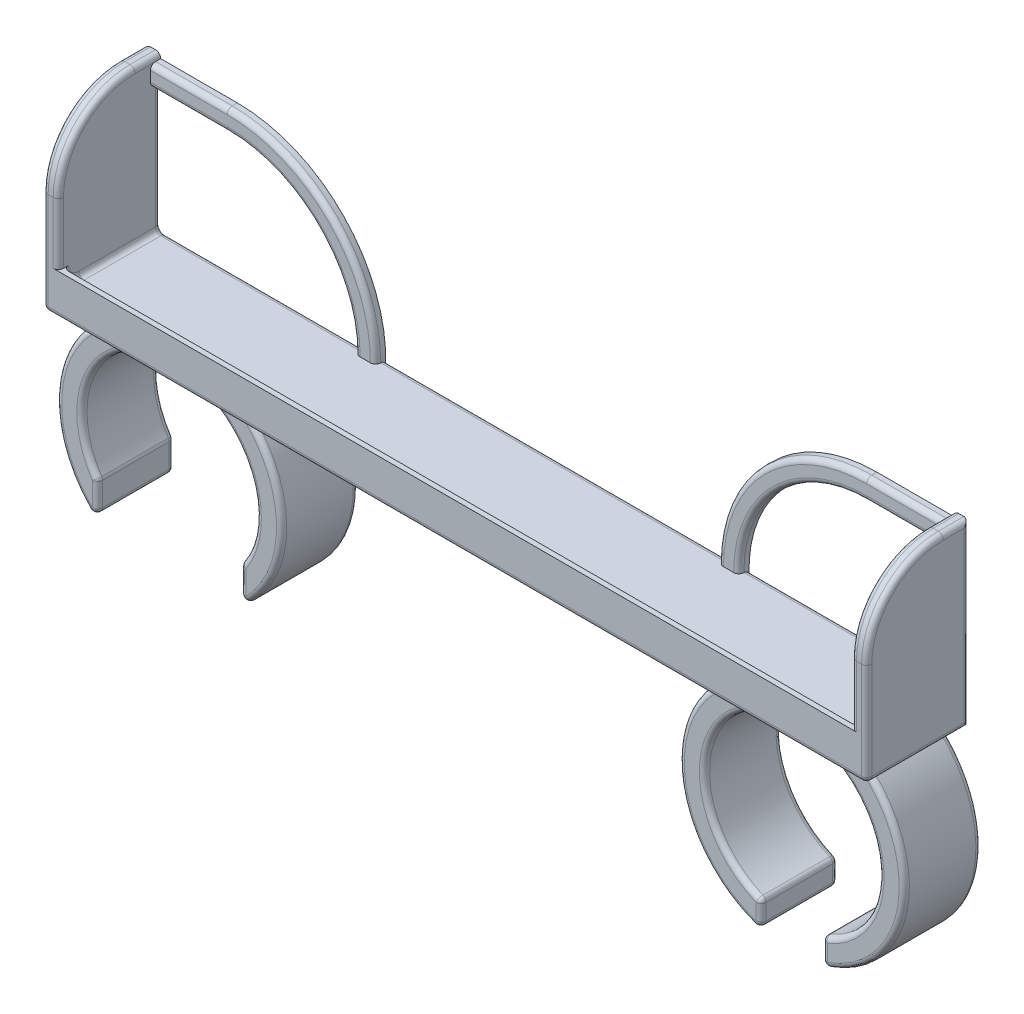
ISO-10303-21;
HEADER;
FILE_DESCRIPTION(('STEP AP214'),'2;1');
FILE_NAME('part.step','',(''),(''),'','','');
FILE_SCHEMA(('AUTOMOTIVE_DESIGN { 1 0 10303 214 1 1 1 1 }'));
ENDSEC;
DATA;
#1=APPLICATION_CONTEXT('core data for automotive mechanical design processes');
#2=APPLICATION_PROTOCOL_DEFINITION('international standard','automotive_design',2000,#1);
#3=PRODUCT_CONTEXT('',#1,'mechanical');
#4=PRODUCT('Part','Part','',(#3));
#5=PRODUCT_RELATED_PRODUCT_CATEGORY('part','',(#4));
#6=PRODUCT_DEFINITION_FORMATION('','',#4);
#7=PRODUCT_DEFINITION_CONTEXT('part definition',#1,'design');
#8=PRODUCT_DEFINITION('design','',#6,#7);
#9=PRODUCT_DEFINITION_SHAPE('','',#8);
#10=(LENGTH_UNIT() NAMED_UNIT(*) SI_UNIT(.MILLI.,.METRE.));
#11=(NAMED_UNIT(*) PLANE_ANGLE_UNIT() SI_UNIT($,.RADIAN.));
#12=(NAMED_UNIT(*) SI_UNIT($,.STERADIAN.) SOLID_ANGLE_UNIT());
#13=UNCERTAINTY_MEASURE_WITH_UNIT(LENGTH_MEASURE(1.E-05),#10,'distance_accuracy_value','');
#14=(GEOMETRIC_REPRESENTATION_CONTEXT(3) GLOBAL_UNCERTAINTY_ASSIGNED_CONTEXT((#13)) GLOBAL_UNIT_ASSIGNED_CONTEXT((#10,
#11,#12)) REPRESENTATION_CONTEXT('',''));
#15=CARTESIAN_POINT('',(0.,0.,0.));
#16=DIRECTION('',(0.,0.,1.));
#17=DIRECTION('',(1.,0.,0.));
#18=AXIS2_PLACEMENT_3D('',#15,#16,#17);
#19=CARTESIAN_POINT('',(108.032777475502,0.,0.));
#20=DIRECTION('',(-1.,0.,0.));
#21=DIRECTION('',(0.,0.,1.));
#22=AXIS2_PLACEMENT_3D('',#19,#20,#21);
#23=PLANE('',#22);
#24=CARTESIAN_POINT('',(108.032777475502,39.,5.00000000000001));
#25=DIRECTION('',(-1.,0.,0.));
#26=DIRECTION('',(0.,0.,1.));
#27=AXIS2_PLACEMENT_3D('',#24,#25,#26);
#28=CIRCLE('',#27,14.);
#29=CARTESIAN_POINT('',(108.032777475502,39.,19.));
#30=VERTEX_POINT('',#29);
#31=CARTESIAN_POINT('',(108.032777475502,53.,5.00000000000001));
#32=VERTEX_POINT('',#31);
#33=EDGE_CURVE('E671',#30,#32,#28,.T.);
#34=ORIENTED_EDGE('',*,*,#33,.T.);
#35=DIRECTION('',(0.,0.,1.));
#36=VECTOR('',#35,1.);
#37=CARTESIAN_POINT('',(108.032777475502,53.,0.));
#38=LINE('',#37,#36);
#39=CARTESIAN_POINT('',(108.032777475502,53.,1.00000000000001));
#40=VERTEX_POINT('',#39);
#41=EDGE_CURVE('E45',#32,#40,#38,.F.);
#42=ORIENTED_EDGE('',*,*,#41,.T.);
#43=CARTESIAN_POINT('',(108.032777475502,52.,1.00000000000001));
#44=DIRECTION('',(-1.,0.,0.));
#45=DIRECTION('',(0.,0.,1.));
#46=AXIS2_PLACEMENT_3D('',#43,#44,#45);
#47=CIRCLE('',#46,1.);
#48=CARTESIAN_POINT('',(108.032777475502,52.,2.00000000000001));
#49=VERTEX_POINT('',#48);
#50=EDGE_CURVE('E1530',#40,#49,#47,.F.);
#51=ORIENTED_EDGE('',*,*,#50,.T.);
#52=DIRECTION('',(0.,1.,0.));
#53=VECTOR('',#52,1.);
#54=CARTESIAN_POINT('',(108.032777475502,53.,2.00000000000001));
#55=LINE('',#54,#53);
#56=CARTESIAN_POINT('',(108.032777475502,50.,2.00000000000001));
#57=VERTEX_POINT('',#56);
#58=EDGE_CURVE('E2531',#57,#49,#55,.T.);
#59=ORIENTED_EDGE('',*,*,#58,.F.);
#60=CARTESIAN_POINT('',(108.032777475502,50.,1.00000000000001));
#61=DIRECTION('',(-1.,0.,0.));
#62=DIRECTION('',(0.,0.,1.));
#63=AXIS2_PLACEMENT_3D('',#60,#61,#62);
#64=CIRCLE('',#63,1.);
#65=CARTESIAN_POINT('',(108.032777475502,49.,1.));
#66=VERTEX_POINT('',#65);
#67=EDGE_CURVE('E1526',#57,#66,#64,.F.);
#68=ORIENTED_EDGE('',*,*,#67,.T.);
#69=DIRECTION('',(0.,1.,0.));
#70=VECTOR('',#69,1.);
#71=CARTESIAN_POINT('',(108.032777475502,24.,1.));
#72=LINE('',#71,#70);
#73=CARTESIAN_POINT('',(108.032777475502,25.,1.));
#74=VERTEX_POINT('',#73);
#75=EDGE_CURVE('E683',#66,#74,#72,.F.);
#76=ORIENTED_EDGE('',*,*,#75,.T.);
#77=DIRECTION('',(0.,0.,-1.));
#78=VECTOR('',#77,1.);
#79=CARTESIAN_POINT('',(108.032777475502,25.,16.));
#80=LINE('',#79,#78);
#81=CARTESIAN_POINT('',(108.032777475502,25.,16.));
#82=VERTEX_POINT('',#81);
#83=EDGE_CURVE('E681',#74,#82,#80,.F.);
#84=ORIENTED_EDGE('',*,*,#83,.T.);
#85=CARTESIAN_POINT('',(108.032777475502,27.,16.));
#86=DIRECTION('',(-1.,0.,0.));
#87=DIRECTION('',(0.,0.,1.));
#88=AXIS2_PLACEMENT_3D('',#85,#86,#87);
#89=CIRCLE('',#88,2.);
#90=CARTESIAN_POINT('',(108.032777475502,27.,18.));
#91=VERTEX_POINT('',#90);
#92=EDGE_CURVE('E678',#82,#91,#89,.T.);
#93=ORIENTED_EDGE('',*,*,#92,.T.);
#94=DIRECTION('',(0.,0.,-1.));
#95=VECTOR('',#94,1.);
#96=CARTESIAN_POINT('',(108.032777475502,27.,20.));
#97=LINE('',#96,#95);
#98=CARTESIAN_POINT('',(108.032777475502,27.,19.));
#99=VERTEX_POINT('',#98);
#100=EDGE_CURVE('E675',#91,#99,#97,.F.);
#101=ORIENTED_EDGE('',*,*,#100,.T.);
#102=DIRECTION('',(0.,-1.,0.));
#103=VECTOR('',#102,1.);
#104=CARTESIAN_POINT('',(108.032777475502,39.,19.));
#105=LINE('',#104,#103);
#106=EDGE_CURVE('E673',#99,#30,#105,.F.);
#107=ORIENTED_EDGE('',*,*,#106,.T.);
#108=EDGE_LOOP('',(#34,#42,#51,#59,#68,#76,#84,#93,#101,#107));
#109=FACE_BOUND('',#108,.T.);
#110=ADVANCED_FACE('F35',(#109),#23,.T.);
#111=CARTESIAN_POINT('',(-46.9672225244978,0.,0.));
#112=DIRECTION('',(1.,0.,0.));
#113=DIRECTION('',(0.,0.,-1.));
#114=AXIS2_PLACEMENT_3D('',#111,#112,#113);
#115=PLANE('',#114);
#116=CARTESIAN_POINT('',(-46.9672225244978,52.,0.999999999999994));
#117=DIRECTION('',(1.,0.,0.));
#118=DIRECTION('',(0.,0.,-1.));
#119=AXIS2_PLACEMENT_3D('',#116,#117,#118);
#120=CIRCLE('',#119,1.);
#121=CARTESIAN_POINT('',(-46.9672225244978,52.,1.99999999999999));
#122=VERTEX_POINT('',#121);
#123=CARTESIAN_POINT('',(-46.9672225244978,53.,0.999999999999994));
#124=VERTEX_POINT('',#123);
#125=EDGE_CURVE('E1524',#122,#124,#120,.F.);
#126=ORIENTED_EDGE('',*,*,#125,.T.);
#127=DIRECTION('',(0.,0.,-1.));
#128=VECTOR('',#127,1.);
#129=CARTESIAN_POINT('',(-46.9672225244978,53.,5.00000000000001));
#130=LINE('',#129,#128);
#131=CARTESIAN_POINT('',(-46.9672225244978,53.,5.00000000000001));
#132=VERTEX_POINT('',#131);
#133=EDGE_CURVE('E11',#124,#132,#130,.F.);
#134=ORIENTED_EDGE('',*,*,#133,.T.);
#135=CARTESIAN_POINT('',(-46.9672225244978,39.,5.00000000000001));
#136=DIRECTION('',(1.,0.,0.));
#137=DIRECTION('',(0.,0.,-1.));
#138=AXIS2_PLACEMENT_3D('',#135,#136,#137);
#139=CIRCLE('',#138,14.);
#140=CARTESIAN_POINT('',(-46.9672225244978,39.,19.));
#141=VERTEX_POINT('',#140);
#142=EDGE_CURVE('E689',#132,#141,#139,.T.);
#143=ORIENTED_EDGE('',*,*,#142,.T.);
#144=DIRECTION('',(0.,1.,0.));
#145=VECTOR('',#144,1.);
#146=CARTESIAN_POINT('',(-46.9672225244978,27.,19.));
#147=LINE('',#146,#145);
#148=CARTESIAN_POINT('',(-46.9672225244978,27.,19.));
#149=VERTEX_POINT('',#148);
#150=EDGE_CURVE('E691',#141,#149,#147,.F.);
#151=ORIENTED_EDGE('',*,*,#150,.T.);
#152=DIRECTION('',(0.,0.,1.));
#153=VECTOR('',#152,1.);
#154=CARTESIAN_POINT('',(-46.9672225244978,27.,20.));
#155=LINE('',#154,#153);
#156=CARTESIAN_POINT('',(-46.9672225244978,27.,18.));
#157=VERTEX_POINT('',#156);
#158=EDGE_CURVE('E53',#149,#157,#155,.F.);
#159=ORIENTED_EDGE('',*,*,#158,.T.);
#160=CARTESIAN_POINT('',(-46.9672225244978,27.,16.));
#161=DIRECTION('',(1.,0.,0.));
#162=DIRECTION('',(0.,0.,-1.));
#163=AXIS2_PLACEMENT_3D('',#160,#161,#162);
#164=CIRCLE('',#163,2.);
#165=CARTESIAN_POINT('',(-46.9672225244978,25.,16.));
#166=VERTEX_POINT('',#165);
#167=EDGE_CURVE('E694',#157,#166,#164,.T.);
#168=ORIENTED_EDGE('',*,*,#167,.T.);
#169=DIRECTION('',(0.,0.,1.));
#170=VECTOR('',#169,1.);
#171=CARTESIAN_POINT('',(-46.9672225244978,25.,0.));
#172=LINE('',#171,#170);
#173=CARTESIAN_POINT('',(-46.9672225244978,25.,1.));
#174=VERTEX_POINT('',#173);
#175=EDGE_CURVE('E696',#166,#174,#172,.F.);
#176=ORIENTED_EDGE('',*,*,#175,.T.);
#177=DIRECTION('',(0.,-1.,0.));
#178=VECTOR('',#177,1.);
#179=CARTESIAN_POINT('',(-46.9672225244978,49.,1.));
#180=LINE('',#179,#178);
#181=CARTESIAN_POINT('',(-46.9672225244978,49.,1.));
#182=VERTEX_POINT('',#181);
#183=EDGE_CURVE('E698',#174,#182,#180,.F.);
#184=ORIENTED_EDGE('',*,*,#183,.T.);
#185=CARTESIAN_POINT('',(-46.9672225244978,50.,0.999999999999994));
#186=DIRECTION('',(1.,0.,0.));
#187=DIRECTION('',(0.,0.,-1.));
#188=AXIS2_PLACEMENT_3D('',#185,#186,#187);
#189=CIRCLE('',#188,1.);
#190=CARTESIAN_POINT('',(-46.9672225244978,50.,1.99999999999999));
#191=VERTEX_POINT('',#190);
#192=EDGE_CURVE('E1527',#182,#191,#189,.F.);
#193=ORIENTED_EDGE('',*,*,#192,.T.);
#194=DIRECTION('',(0.,-1.,0.));
#195=VECTOR('',#194,1.);
#196=CARTESIAN_POINT('',(-46.9672225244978,53.,1.99999999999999));
#197=LINE('',#196,#195);
#198=EDGE_CURVE('E536',#122,#191,#197,.T.);
#199=ORIENTED_EDGE('',*,*,#198,.F.);
#200=EDGE_LOOP('',(#126,#134,#143,#151,#159,#168,#176,#184,#193,#199));
#201=FACE_BOUND('',#200,.T.);
#202=ADVANCED_FACE('F1169',(#201),#115,.T.);
#203=CARTESIAN_POINT('',(0.,24.,0.));
#204=DIRECTION('',(0.,1.,0.));
#205=DIRECTION('',(0.,0.,1.));
#206=AXIS2_PLACEMENT_3D('',#203,#204,#205);
#207=PLANE('',#206);
#208=DIRECTION('',(-1.,0.,0.));
#209=VECTOR('',#208,1.);
#210=CARTESIAN_POINT('',(0.,24.,2.00000000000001));
#211=LINE('',#210,#209);
#212=CARTESIAN_POINT('',(67.0327774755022,24.,2.00000000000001));
#213=VERTEX_POINT('',#212);
#214=CARTESIAN_POINT('',(65.0327774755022,24.,2.00000000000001));
#215=VERTEX_POINT('',#214);
#216=EDGE_CURVE('E1574',#213,#215,#211,.T.);
#217=ORIENTED_EDGE('',*,*,#216,.T.);
#218=CARTESIAN_POINT('',(65.0327774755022,24.,1.00000000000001));
#219=DIRECTION('',(0.,1.,0.));
#220=DIRECTION('',(0.,0.,1.));
#221=AXIS2_PLACEMENT_3D('',#218,#219,#220);
#222=CIRCLE('',#221,1.);
#223=CARTESIAN_POINT('',(64.0327774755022,24.,1.00000000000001));
#224=VERTEX_POINT('',#223);
#225=EDGE_CURVE('E1412',#215,#224,#222,.F.);
#226=ORIENTED_EDGE('',*,*,#225,.T.);
#227=DIRECTION('',(-1.,0.,0.));
#228=VECTOR('',#227,1.);
#229=CARTESIAN_POINT('',(-2.96722252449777,24.,1.));
#230=LINE('',#229,#228);
#231=CARTESIAN_POINT('',(-2.96722252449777,24.,0.999999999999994));
#232=VERTEX_POINT('',#231);
#233=EDGE_CURVE('E623',#224,#232,#230,.T.);
#234=ORIENTED_EDGE('',*,*,#233,.T.);
#235=CARTESIAN_POINT('',(-3.96722252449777,24.,0.999999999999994));
#236=DIRECTION('',(0.,1.,0.));
#237=DIRECTION('',(0.,0.,1.));
#238=AXIS2_PLACEMENT_3D('',#235,#236,#237);
#239=CIRCLE('',#238,1.);
#240=CARTESIAN_POINT('',(-3.96722252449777,24.,1.99999999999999));
#241=VERTEX_POINT('',#240);
#242=EDGE_CURVE('E1420',#232,#241,#239,.F.);
#243=ORIENTED_EDGE('',*,*,#242,.T.);
#244=DIRECTION('',(-1.,0.,0.));
#245=VECTOR('',#244,1.);
#246=CARTESIAN_POINT('',(0.,24.,1.99999999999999));
#247=LINE('',#246,#245);
#248=CARTESIAN_POINT('',(-5.96722252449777,24.,1.99999999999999));
#249=VERTEX_POINT('',#248);
#250=EDGE_CURVE('E2532',#241,#249,#247,.T.);
#251=ORIENTED_EDGE('',*,*,#250,.T.);
#252=CARTESIAN_POINT('',(-5.96722252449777,24.,0.999999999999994));
#253=DIRECTION('',(0.,1.,0.));
#254=DIRECTION('',(0.,0.,1.));
#255=AXIS2_PLACEMENT_3D('',#252,#253,#254);
#256=CIRCLE('',#255,1.);
#257=CARTESIAN_POINT('',(-6.96722252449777,24.,0.999999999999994));
#258=VERTEX_POINT('',#257);
#259=EDGE_CURVE('E1424',#249,#258,#256,.F.);
#260=ORIENTED_EDGE('',*,*,#259,.T.);
#261=DIRECTION('',(-1.,0.,0.));
#262=VECTOR('',#261,1.);
#263=CARTESIAN_POINT('',(-46.9672225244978,24.,1.));
#264=LINE('',#263,#262);
#265=CARTESIAN_POINT('',(-45.9672225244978,24.,1.));
#266=VERTEX_POINT('',#265);
#267=EDGE_CURVE('E615',#258,#266,#264,.T.);
#268=ORIENTED_EDGE('',*,*,#267,.T.);
#269=DIRECTION('',(0.,0.,1.));
#270=VECTOR('',#269,1.);
#271=CARTESIAN_POINT('',(-45.9672225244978,24.,16.));
#272=LINE('',#271,#270);
#273=CARTESIAN_POINT('',(-45.9672225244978,24.,16.));
#274=VERTEX_POINT('',#273);
#275=EDGE_CURVE('E613',#266,#274,#272,.T.);
#276=ORIENTED_EDGE('',*,*,#275,.T.);
#277=DIRECTION('',(-1.,0.,0.));
#278=VECTOR('',#277,1.);
#279=CARTESIAN_POINT('',(0.,24.,16.));
#280=LINE('',#279,#278);
#281=CARTESIAN_POINT('',(107.032777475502,24.,16.));
#282=VERTEX_POINT('',#281);
#283=EDGE_CURVE('E581',#274,#282,#280,.F.);
#284=ORIENTED_EDGE('',*,*,#283,.T.);
#285=DIRECTION('',(0.,0.,-1.));
#286=VECTOR('',#285,1.);
#287=CARTESIAN_POINT('',(107.032777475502,24.,0.));
#288=LINE('',#287,#286);
#289=CARTESIAN_POINT('',(107.032777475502,24.,1.));
#290=VERTEX_POINT('',#289);
#291=EDGE_CURVE('E618',#282,#290,#288,.T.);
#292=ORIENTED_EDGE('',*,*,#291,.T.);
#293=DIRECTION('',(-1.,0.,0.));
#294=VECTOR('',#293,1.);
#295=CARTESIAN_POINT('',(68.0327774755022,24.,1.));
#296=LINE('',#295,#294);
#297=CARTESIAN_POINT('',(68.0327774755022,24.,1.00000000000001));
#298=VERTEX_POINT('',#297);
#299=EDGE_CURVE('E620',#290,#298,#296,.T.);
#300=ORIENTED_EDGE('',*,*,#299,.T.);
#301=CARTESIAN_POINT('',(67.0327774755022,24.,1.00000000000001));
#302=DIRECTION('',(0.,1.,0.));
#303=DIRECTION('',(0.,0.,1.));
#304=AXIS2_PLACEMENT_3D('',#301,#302,#303);
#305=CIRCLE('',#304,1.);
#306=EDGE_CURVE('E1415',#298,#213,#305,.F.);
#307=ORIENTED_EDGE('',*,*,#306,.T.);
#308=EDGE_LOOP('',(#217,#226,#234,#243,#251,#260,#268,#276,#284,#292,#300,#307));
#309=FACE_BOUND('',#308,.T.);
#310=ADVANCED_FACE('F1094',(#309),#207,.T.);
#311=CARTESIAN_POINT('',(0.,19.,0.));
#312=DIRECTION('',(0.,1.,0.));
#313=DIRECTION('',(0.,0.,1.));
#314=AXIS2_PLACEMENT_3D('',#311,#312,#313);
#315=PLANE('',#314);
#316=DIRECTION('',(-1.,0.,0.));
#317=VECTOR('',#316,1.);
#318=CARTESIAN_POINT('',(-46.9672225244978,19.,0.));
#319=LINE('',#318,#317);
#320=CARTESIAN_POINT('',(110.032777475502,19.,0.));
#321=VERTEX_POINT('',#320);
#322=CARTESIAN_POINT('',(100.327049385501,19.,0.));
#323=VERTEX_POINT('',#322);
#324=EDGE_CURVE('E560',#321,#323,#319,.T.);
#325=ORIENTED_EDGE('',*,*,#324,.F.);
#326=DIRECTION('',(0.,0.,-1.));
#327=VECTOR('',#326,1.);
#328=CARTESIAN_POINT('',(110.032777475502,19.,0.));
#329=LINE('',#328,#327);
#330=CARTESIAN_POINT('',(110.032777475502,19.,19.));
#331=VERTEX_POINT('',#330);
#332=EDGE_CURVE('E779',#321,#331,#329,.F.);
#333=ORIENTED_EDGE('',*,*,#332,.T.);
#334=DIRECTION('',(1.,0.,0.));
#335=VECTOR('',#334,1.);
#336=CARTESIAN_POINT('',(0.,19.,19.));
#337=LINE('',#336,#335);
#338=CARTESIAN_POINT('',(-48.9672225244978,19.,19.));
#339=VERTEX_POINT('',#338);
#340=EDGE_CURVE('E775',#331,#339,#337,.F.);
#341=ORIENTED_EDGE('',*,*,#340,.T.);
#342=DIRECTION('',(0.,0.,1.));
#343=VECTOR('',#342,1.);
#344=CARTESIAN_POINT('',(-48.9672225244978,19.,0.));
#345=LINE('',#344,#343);
#346=CARTESIAN_POINT('',(-48.9672225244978,19.,0.));
#347=VERTEX_POINT('',#346);
#348=EDGE_CURVE('E777',#339,#347,#345,.F.);
#349=ORIENTED_EDGE('',*,*,#348,.T.);
#350=CARTESIAN_POINT('',(-39.261494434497,19.,0.));
#351=VERTEX_POINT('',#350);
#352=EDGE_CURVE('E559',#351,#347,#319,.T.);
#353=ORIENTED_EDGE('',*,*,#352,.F.);
#354=CARTESIAN_POINT('',(-39.261494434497,19.,0.));
#355=CARTESIAN_POINT('',(-39.3130004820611,19.,2.10313503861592E-06));
#356=CARTESIAN_POINT('',(-39.3645042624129,19.,0.000721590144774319));
#357=CARTESIAN_POINT('',(-39.4674776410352,19.,0.00367449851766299));
#358=CARTESIAN_POINT('',(-39.5189472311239,19.,0.0059082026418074));
#359=CARTESIAN_POINT('',(-39.673646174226,19.,0.0150234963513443));
#360=CARTESIAN_POINT('',(-39.7767495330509,19.,0.0243205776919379));
#361=CARTESIAN_POINT('',(-39.9828483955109,19.,0.0503543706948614));
#362=CARTESIAN_POINT('',(-40.0858367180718,19.,0.0671488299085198));
#363=CARTESIAN_POINT('',(-40.2898621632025,19.,0.109545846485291));
#364=CARTESIAN_POINT('',(-40.3909026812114,19.,0.13513126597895));
#365=CARTESIAN_POINT('',(-40.5525353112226,19.,0.185651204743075));
#366=CARTESIAN_POINT('',(-40.6141610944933,19.,0.207270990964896));
#367=CARTESIAN_POINT('',(-40.735440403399,19.,0.255587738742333));
#368=CARTESIAN_POINT('',(-40.7950936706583,19.,0.282285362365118));
#369=CARTESIAN_POINT('',(-40.9117971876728,19.,0.341981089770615));
#370=CARTESIAN_POINT('',(-40.9688233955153,19.,0.375026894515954));
#371=CARTESIAN_POINT('',(-41.0778335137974,19.,0.448612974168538));
#372=CARTESIAN_POINT('',(-41.1298298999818,19.,0.489133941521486));
#373=CARTESIAN_POINT('',(-41.2047340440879,19.,0.559756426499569));
#374=CARTESIAN_POINT('',(-41.23050834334,19.,0.586803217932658));
#375=CARTESIAN_POINT('',(-41.2783419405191,19.,0.644086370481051));
#376=CARTESIAN_POINT('',(-41.3003995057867,19.,0.674324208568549));
#377=CARTESIAN_POINT('',(-41.3397100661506,19.,0.738405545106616));
#378=CARTESIAN_POINT('',(-41.3568938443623,19.,0.772292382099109));
#379=CARTESIAN_POINT('',(-41.3843373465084,19.,0.842726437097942));
#380=CARTESIAN_POINT('',(-41.3946247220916,19.,0.879262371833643));
#381=CARTESIAN_POINT('',(-41.4031173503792,19.,0.930226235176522));
#382=CARTESIAN_POINT('',(-41.4048524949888,19.,0.944114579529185));
#383=CARTESIAN_POINT('',(-41.4071740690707,19.,0.971998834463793));
#384=CARTESIAN_POINT('',(-41.4077595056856,19.,0.985994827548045));
#385=CARTESIAN_POINT('',(-41.4077590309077,19.,0.999999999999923));
#386=B_SPLINE_CURVE_WITH_KNOTS('',3,(#354,#355,#356,#357,#358,#359,#360,#361,#362,#363,#364,
#365,#366,#367,#368,#369,#370,#371,#372,#373,#374,#375,#376,#377,#378,#379,#380,#381,#382,#383,
#384,#385),.UNSPECIFIED.,.F.,.F.,(4,2,2,2,2,2,2,2,2,2,2,2,2,2,2,4),(0.,0.154507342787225,
0.309043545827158,0.619362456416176,0.932113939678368,1.24425914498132,1.44001068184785,
1.63578775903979,1.8330979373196,2.02990544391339,2.14174220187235,2.25363095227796,
2.36703714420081,2.47998586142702,2.52193528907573,2.5639209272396),.UNSPECIFIED.);
#387=CARTESIAN_POINT('',(-41.4077590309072,19.,1.));
#388=VERTEX_POINT('',#387);
#389=EDGE_CURVE('E1113',#351,#388,#386,.T.);
#390=ORIENTED_EDGE('',*,*,#389,.T.);
#391=DIRECTION('',(0.,0.,-1.));
#392=VECTOR('',#391,1.);
#393=CARTESIAN_POINT('',(-41.4077590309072,19.,15.));
#394=LINE('',#393,#392);
#395=CARTESIAN_POINT('',(-41.4077590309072,19.,14.));
#396=VERTEX_POINT('',#395);
#397=EDGE_CURVE('E569',#388,#396,#394,.F.);
#398=ORIENTED_EDGE('',*,*,#397,.T.);
#399=CARTESIAN_POINT('',(-41.4077590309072,19.,14.));
#400=CARTESIAN_POINT('',(-41.4078317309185,19.,14.0304294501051));
#401=CARTESIAN_POINT('',(-41.4050077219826,19.,14.0607683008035));
#402=CARTESIAN_POINT('',(-41.3942283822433,19.,14.1202181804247));
#403=CARTESIAN_POINT('',(-41.3863249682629,19.,14.1493384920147));
#404=CARTESIAN_POINT('',(-41.3637872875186,19.,14.2121885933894));
#405=CARTESIAN_POINT('',(-41.3480530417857,19.,14.2455187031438));
#406=CARTESIAN_POINT('',(-41.3113660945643,19.,14.3092605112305));
#407=CARTESIAN_POINT('',(-41.2903922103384,19.,14.3396596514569));
#408=CARTESIAN_POINT('',(-41.232816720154,19.,14.4121945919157));
#409=CARTESIAN_POINT('',(-41.1937228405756,19.,14.4523344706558));
#410=CARTESIAN_POINT('',(-41.1100129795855,19.,14.5262571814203));
#411=CARTESIAN_POINT('',(-41.0653874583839,19.,14.5600287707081));
#412=CARTESIAN_POINT('',(-40.9769266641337,19.,14.6192629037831));
#413=CARTESIAN_POINT('',(-40.9334083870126,19.,14.6452073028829));
#414=CARTESIAN_POINT('',(-40.8443068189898,19.,14.6933030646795));
#415=CARTESIAN_POINT('',(-40.7987218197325,19.,14.7154512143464));
#416=CARTESIAN_POINT('',(-40.6593050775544,19.,14.7772083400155));
#417=CARTESIAN_POINT('',(-40.5632701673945,19.,14.8118440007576));
#418=CARTESIAN_POINT('',(-40.3670463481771,19.,14.8712179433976));
#419=CARTESIAN_POINT('',(-40.2668206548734,19.,14.8958279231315));
#420=CARTESIAN_POINT('',(-40.0645165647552,19.,14.9365512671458));
#421=CARTESIAN_POINT('',(-39.9624353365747,19.,14.9526502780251));
#422=CARTESIAN_POINT('',(-39.7604951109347,19.,14.9772314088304));
#423=CARTESIAN_POINT('',(-39.6606613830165,19.,14.9859276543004));
#424=CARTESIAN_POINT('',(-39.5108590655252,19.,14.994461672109));
#425=CARTESIAN_POINT('',(-39.4610061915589,19.,14.9965548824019));
#426=CARTESIAN_POINT('',(-39.3612675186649,19.,14.9993230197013));
#427=CARTESIAN_POINT('',(-39.3113817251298,19.,14.9999981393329));
#428=CARTESIAN_POINT('',(-39.261494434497,19.,15.));
#429=B_SPLINE_CURVE_WITH_KNOTS('',3,(#399,#400,#401,#402,#403,#404,#405,#406,#407,#408,#409,
#410,#411,#412,#413,#414,#415,#416,#417,#418,#419,#420,#421,#422,#423,#424,#425,#426,#427,#428),
.UNSPECIFIED.,.F.,.F.,(4,2,2,2,2,2,2,2,2,2,2,2,2,2,4),(0.,0.0910108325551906,0.181105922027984,
0.291069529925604,0.401485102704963,0.568638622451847,0.736084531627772,0.88785748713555,
1.03975827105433,1.34516468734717,1.65436521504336,1.96408554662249,2.26450924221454,
2.41418279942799,2.56383602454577),.UNSPECIFIED.);
#430=CARTESIAN_POINT('',(-39.261494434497,19.,15.));
#431=VERTEX_POINT('',#430);
#432=EDGE_CURVE('E1132',#396,#431,#429,.T.);
#433=ORIENTED_EDGE('',*,*,#432,.T.);
#434=DIRECTION('',(-1.,0.,0.));
#435=VECTOR('',#434,1.);
#436=CARTESIAN_POINT('',(-30.3172225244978,19.,15.));
#437=LINE('',#436,#435);
#438=CARTESIAN_POINT('',(-21.3729506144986,19.,15.));
#439=VERTEX_POINT('',#438);
#440=EDGE_CURVE('E562',#439,#431,#437,.T.);
#441=ORIENTED_EDGE('',*,*,#440,.F.);
#442=CARTESIAN_POINT('',(-21.3729506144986,19.,15.));
#443=CARTESIAN_POINT('',(-21.3214445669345,19.,14.999997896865));
#444=CARTESIAN_POINT('',(-21.2699407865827,19.,14.9992784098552));
#445=CARTESIAN_POINT('',(-21.1669674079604,19.,14.9963255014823));
#446=CARTESIAN_POINT('',(-21.1154978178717,19.,14.9940917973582));
#447=CARTESIAN_POINT('',(-20.9607988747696,19.,14.9849765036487));
#448=CARTESIAN_POINT('',(-20.8576955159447,19.,14.9756794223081));
#449=CARTESIAN_POINT('',(-20.6515966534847,19.,14.9496456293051));
#450=CARTESIAN_POINT('',(-20.5486083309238,19.,14.9328511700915));
#451=CARTESIAN_POINT('',(-20.3445828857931,19.,14.8904541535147));
#452=CARTESIAN_POINT('',(-20.2435423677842,19.,14.8648687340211));
#453=CARTESIAN_POINT('',(-20.0819097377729,19.,14.8143487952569));
#454=CARTESIAN_POINT('',(-20.0202839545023,19.,14.7927290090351));
#455=CARTESIAN_POINT('',(-19.8990046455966,19.,14.7444122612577));
#456=CARTESIAN_POINT('',(-19.8393513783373,19.,14.7177146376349));
#457=CARTESIAN_POINT('',(-19.7226478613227,19.,14.6580189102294));
#458=CARTESIAN_POINT('',(-19.6656216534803,19.,14.6249731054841));
#459=CARTESIAN_POINT('',(-19.5566115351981,19.,14.5513870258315));
#460=CARTESIAN_POINT('',(-19.5046151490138,19.,14.5108660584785));
#461=CARTESIAN_POINT('',(-19.4297110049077,19.,14.4402435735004));
#462=CARTESIAN_POINT('',(-19.4039367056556,19.,14.4131967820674));
#463=CARTESIAN_POINT('',(-19.3561031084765,19.,14.355913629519));
#464=CARTESIAN_POINT('',(-19.3340455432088,19.,14.3256757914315));
#465=CARTESIAN_POINT('',(-19.2947349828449,19.,14.2615944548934));
#466=CARTESIAN_POINT('',(-19.2775512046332,19.,14.2277076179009));
#467=CARTESIAN_POINT('',(-19.2501077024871,19.,14.1572735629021));
#468=CARTESIAN_POINT('',(-19.239820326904,19.,14.1207376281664));
#469=CARTESIAN_POINT('',(-19.2313276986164,19.,14.0697737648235));
#470=CARTESIAN_POINT('',(-19.2295925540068,19.,14.0558854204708));
#471=CARTESIAN_POINT('',(-19.2272709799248,19.,14.0280011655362));
#472=CARTESIAN_POINT('',(-19.2266855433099,19.,14.014005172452));
#473=CARTESIAN_POINT('',(-19.2266860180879,19.,14.0000000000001));
#474=B_SPLINE_CURVE_WITH_KNOTS('',3,(#442,#443,#444,#445,#446,#447,#448,#449,#450,#451,#452,
#453,#454,#455,#456,#457,#458,#459,#460,#461,#462,#463,#464,#465,#466,#467,#468,#469,#470,#471,
#472,#473),.UNSPECIFIED.,.F.,.F.,(4,2,2,2,2,2,2,2,2,2,2,2,2,2,2,4),(0.,0.154507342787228,
0.309043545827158,0.619362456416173,0.93211393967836,1.24425914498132,1.44001068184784,
1.63578775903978,1.83309793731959,2.02990544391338,2.14174220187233,2.25363095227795,
2.3670371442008,2.47998586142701,2.52193528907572,2.5639209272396),.UNSPECIFIED.);
#475=CARTESIAN_POINT('',(-19.2266860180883,19.,14.));
#476=VERTEX_POINT('',#475);
#477=EDGE_CURVE('E1137',#439,#476,#474,.T.);
#478=ORIENTED_EDGE('',*,*,#477,.T.);
#479=DIRECTION('',(0.,0.,-1.));
#480=VECTOR('',#479,1.);
#481=CARTESIAN_POINT('',(-19.2266860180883,19.,15.));
#482=LINE('',#481,#480);
#483=CARTESIAN_POINT('',(-19.2266860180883,19.,1.));
#484=VERTEX_POINT('',#483);
#485=EDGE_CURVE('E566',#476,#484,#482,.T.);
#486=ORIENTED_EDGE('',*,*,#485,.T.);
#487=CARTESIAN_POINT('',(-19.2266860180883,19.,1.));
#488=CARTESIAN_POINT('',(-19.226613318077,19.,0.969570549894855));
#489=CARTESIAN_POINT('',(-19.229437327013,19.,0.939231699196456));
#490=CARTESIAN_POINT('',(-19.2402166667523,19.,0.879781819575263));
#491=CARTESIAN_POINT('',(-19.2481200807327,19.,0.850661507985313));
#492=CARTESIAN_POINT('',(-19.2706577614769,19.,0.787811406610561));
#493=CARTESIAN_POINT('',(-19.2863920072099,19.,0.754481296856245));
#494=CARTESIAN_POINT('',(-19.3230789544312,19.,0.690739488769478));
#495=CARTESIAN_POINT('',(-19.3440528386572,19.,0.660340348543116));
#496=CARTESIAN_POINT('',(-19.4016283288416,19.,0.587805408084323));
#497=CARTESIAN_POINT('',(-19.4407222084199,19.,0.547665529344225));
#498=CARTESIAN_POINT('',(-19.5244320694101,19.,0.473742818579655));
#499=CARTESIAN_POINT('',(-19.5690575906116,19.,0.439971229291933));
#500=CARTESIAN_POINT('',(-19.6575183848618,19.,0.380737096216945));
#501=CARTESIAN_POINT('',(-19.701036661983,19.,0.354792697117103));
#502=CARTESIAN_POINT('',(-19.7901382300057,19.,0.30669693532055));
#503=CARTESIAN_POINT('',(-19.8357232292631,19.,0.284548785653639));
#504=CARTESIAN_POINT('',(-19.9751399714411,19.,0.222791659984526));
#505=CARTESIAN_POINT('',(-20.0711748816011,19.,0.1881559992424));
#506=CARTESIAN_POINT('',(-20.2673987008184,19.,0.128782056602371));
#507=CARTESIAN_POINT('',(-20.3676243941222,19.,0.104172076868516));
#508=CARTESIAN_POINT('',(-20.5699284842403,19.,0.0634487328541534));
#509=CARTESIAN_POINT('',(-20.6720097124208,19.,0.0473497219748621));
#510=CARTESIAN_POINT('',(-20.8739499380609,19.,0.0227685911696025));
#511=CARTESIAN_POINT('',(-20.973783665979,19.,0.0140723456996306));
#512=CARTESIAN_POINT('',(-21.1235859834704,19.,0.00553832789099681));
#513=CARTESIAN_POINT('',(-21.1734388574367,19.,0.00344511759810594));
#514=CARTESIAN_POINT('',(-21.2731775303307,19.,0.00067698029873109));
#515=CARTESIAN_POINT('',(-21.3230633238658,19.,1.86066710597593E-06));
#516=CARTESIAN_POINT('',(-21.3729506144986,19.,0.));
#517=B_SPLINE_CURVE_WITH_KNOTS('',3,(#487,#488,#489,#490,#491,#492,#493,#494,#495,#496,#497,
#498,#499,#500,#501,#502,#503,#504,#505,#506,#507,#508,#509,#510,#511,#512,#513,#514,#515,#516),
.UNSPECIFIED.,.F.,.F.,(4,2,2,2,2,2,2,2,2,2,2,2,2,2,4),(0.,0.0910108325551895,0.181105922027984,
0.291069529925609,0.401485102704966,0.568638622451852,0.736084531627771,0.887857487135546,
1.03975827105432,1.34516468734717,1.65436521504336,1.96408554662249,2.26450924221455,
2.414182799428,2.56383602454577),.UNSPECIFIED.);
#518=CARTESIAN_POINT('',(-21.3729506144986,19.,0.));
#519=VERTEX_POINT('',#518);
#520=EDGE_CURVE('E1105',#484,#519,#517,.T.);
#521=ORIENTED_EDGE('',*,*,#520,.T.);
#522=CARTESIAN_POINT('',(82.438505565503,19.,0.));
#523=VERTEX_POINT('',#522);
#524=EDGE_CURVE('E563',#523,#519,#319,.T.);
#525=ORIENTED_EDGE('',*,*,#524,.F.);
#526=CARTESIAN_POINT('',(82.438505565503,19.,0.));
#527=CARTESIAN_POINT('',(82.3869995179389,19.,2.10313503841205E-06));
#528=CARTESIAN_POINT('',(82.3354957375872,19.,0.000721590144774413));
#529=CARTESIAN_POINT('',(82.2325223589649,19.,0.0036744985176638));
#530=CARTESIAN_POINT('',(82.1810527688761,19.,0.00590820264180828));
#531=CARTESIAN_POINT('',(82.026353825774,19.,0.015023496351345));
#532=CARTESIAN_POINT('',(81.9232504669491,19.,0.0243205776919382));
#533=CARTESIAN_POINT('',(81.7171516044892,19.,0.0503543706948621));
#534=CARTESIAN_POINT('',(81.6141632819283,19.,0.0671488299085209));
#535=CARTESIAN_POINT('',(81.4101378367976,19.,0.109545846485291));
#536=CARTESIAN_POINT('',(81.3090973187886,19.,0.13513126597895));
#537=CARTESIAN_POINT('',(81.1474646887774,19.,0.18565120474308));
#538=CARTESIAN_POINT('',(81.0858389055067,19.,0.207270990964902));
#539=CARTESIAN_POINT('',(80.964559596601,19.,0.255587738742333));
#540=CARTESIAN_POINT('',(80.9049063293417,19.,0.282285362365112));
#541=CARTESIAN_POINT('',(80.7882028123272,19.,0.341981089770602));
#542=CARTESIAN_POINT('',(80.7311766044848,19.,0.375026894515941));
#543=CARTESIAN_POINT('',(80.6221664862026,19.,0.448612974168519));
#544=CARTESIAN_POINT('',(80.5701701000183,19.,0.489133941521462));
#545=CARTESIAN_POINT('',(80.4952659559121,19.,0.559756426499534));
#546=CARTESIAN_POINT('',(80.4694916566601,19.,0.586803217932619));
#547=CARTESIAN_POINT('',(80.421658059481,19.,0.644086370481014));
#548=CARTESIAN_POINT('',(80.3996004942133,19.,0.674324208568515));
#549=CARTESIAN_POINT('',(80.3602899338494,19.,0.738405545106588));
#550=CARTESIAN_POINT('',(80.3431061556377,19.,0.772292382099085));
#551=CARTESIAN_POINT('',(80.3156626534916,19.,0.842726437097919));
#552=CARTESIAN_POINT('',(80.3053752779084,19.,0.879262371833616));
#553=CARTESIAN_POINT('',(80.2968826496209,19.,0.930226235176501));
#554=CARTESIAN_POINT('',(80.2951475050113,19.,0.944114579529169));
#555=CARTESIAN_POINT('',(80.2928259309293,19.,0.971998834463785));
#556=CARTESIAN_POINT('',(80.2922404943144,19.,0.985994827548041));
#557=CARTESIAN_POINT('',(80.2922409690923,19.,0.999999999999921));
#558=B_SPLINE_CURVE_WITH_KNOTS('',3,(#526,#527,#528,#529,#530,#531,#532,#533,#534,#535,#536,
#537,#538,#539,#540,#541,#542,#543,#544,#545,#546,#547,#548,#549,#550,#551,#552,#553,#554,#555,
#556,#557),.UNSPECIFIED.,.F.,.F.,(4,2,2,2,2,2,2,2,2,2,2,2,2,2,2,4),(0.,0.154507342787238,
0.309043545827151,0.619362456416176,0.932113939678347,1.24425914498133,1.44001068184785,
1.63578775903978,1.83309793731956,2.02990544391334,2.1417422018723,2.25363095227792,
2.36703714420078,2.479985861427,2.52193528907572,2.56392092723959),.UNSPECIFIED.);
#559=CARTESIAN_POINT('',(80.2922409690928,19.,1.));
#560=VERTEX_POINT('',#559);
#561=EDGE_CURVE('E1120',#523,#560,#558,.T.);
#562=ORIENTED_EDGE('',*,*,#561,.T.);
#563=DIRECTION('',(0.,0.,-1.));
#564=VECTOR('',#563,1.);
#565=CARTESIAN_POINT('',(80.2922409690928,19.,15.));
#566=LINE('',#565,#564);
#567=CARTESIAN_POINT('',(80.2922409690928,19.,14.));
#568=VERTEX_POINT('',#567);
#569=EDGE_CURVE('E572',#568,#560,#566,.T.);
#570=ORIENTED_EDGE('',*,*,#569,.F.);
#571=CARTESIAN_POINT('',(80.2922409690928,19.,14.));
#572=CARTESIAN_POINT('',(80.2921682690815,19.,14.0304294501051));
#573=CARTESIAN_POINT('',(80.2949922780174,19.,14.0607683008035));
#574=CARTESIAN_POINT('',(80.3057716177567,19.,14.1202181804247));
#575=CARTESIAN_POINT('',(80.3136750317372,19.,14.1493384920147));
#576=CARTESIAN_POINT('',(80.3362127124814,19.,14.2121885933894));
#577=CARTESIAN_POINT('',(80.3519469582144,19.,14.2455187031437));
#578=CARTESIAN_POINT('',(80.3886339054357,19.,14.3092605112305));
#579=CARTESIAN_POINT('',(80.4096077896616,19.,14.3396596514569));
#580=CARTESIAN_POINT('',(80.467183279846,19.,14.4121945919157));
#581=CARTESIAN_POINT('',(80.5062771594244,19.,14.4523344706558));
#582=CARTESIAN_POINT('',(80.5899870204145,19.,14.5262571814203));
#583=CARTESIAN_POINT('',(80.6346125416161,19.,14.5600287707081));
#584=CARTESIAN_POINT('',(80.7230733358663,19.,14.6192629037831));
#585=CARTESIAN_POINT('',(80.7665916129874,19.,14.6452073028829));
#586=CARTESIAN_POINT('',(80.8556931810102,19.,14.6933030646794));
#587=CARTESIAN_POINT('',(80.9012781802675,19.,14.7154512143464));
#588=CARTESIAN_POINT('',(81.0406949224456,19.,14.7772083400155));
#589=CARTESIAN_POINT('',(81.1367298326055,19.,14.8118440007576));
#590=CARTESIAN_POINT('',(81.3329536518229,19.,14.8712179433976));
#591=CARTESIAN_POINT('',(81.4331793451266,19.,14.8958279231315));
#592=CARTESIAN_POINT('',(81.6354834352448,19.,14.9365512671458));
#593=CARTESIAN_POINT('',(81.7375646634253,19.,14.9526502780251));
#594=CARTESIAN_POINT('',(81.9395048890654,19.,14.9772314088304));
#595=CARTESIAN_POINT('',(82.0393386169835,19.,14.9859276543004));
#596=CARTESIAN_POINT('',(82.1891409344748,19.,14.994461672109));
#597=CARTESIAN_POINT('',(82.2389938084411,19.,14.9965548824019));
#598=CARTESIAN_POINT('',(82.3387324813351,19.,14.9993230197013));
#599=CARTESIAN_POINT('',(82.3886182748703,19.,14.9999981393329));
#600=CARTESIAN_POINT('',(82.438505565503,19.,15.));
#601=B_SPLINE_CURVE_WITH_KNOTS('',3,(#571,#572,#573,#574,#575,#576,#577,#578,#579,#580,#581,
#582,#583,#584,#585,#586,#587,#588,#589,#590,#591,#592,#593,#594,#595,#596,#597,#598,#599,#600),
.UNSPECIFIED.,.F.,.F.,(4,2,2,2,2,2,2,2,2,2,2,2,2,2,4),(0.,0.0910108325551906,0.181105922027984,
0.291069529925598,0.401485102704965,0.568638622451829,0.736084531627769,0.887857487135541,
1.03975827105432,1.34516468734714,1.65436521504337,1.96408554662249,2.26450924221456,
2.41418279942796,2.56383602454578),.UNSPECIFIED.);
#602=CARTESIAN_POINT('',(82.438505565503,19.,15.));
#603=VERTEX_POINT('',#602);
#604=EDGE_CURVE('E1126',#568,#603,#601,.T.);
#605=ORIENTED_EDGE('',*,*,#604,.T.);
#606=DIRECTION('',(1.,0.,0.));
#607=VECTOR('',#606,1.);
#608=CARTESIAN_POINT('',(0.,19.,15.));
#609=LINE('',#608,#607);
#610=CARTESIAN_POINT('',(100.327049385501,19.,15.));
#611=VERTEX_POINT('',#610);
#612=EDGE_CURVE('E575',#603,#611,#609,.T.);
#613=ORIENTED_EDGE('',*,*,#612,.T.);
#614=CARTESIAN_POINT('',(100.327049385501,19.,15.));
#615=CARTESIAN_POINT('',(100.378555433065,19.,14.999997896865));
#616=CARTESIAN_POINT('',(100.430059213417,19.,14.9992784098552));
#617=CARTESIAN_POINT('',(100.53303259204,19.,14.9963255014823));
#618=CARTESIAN_POINT('',(100.584502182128,19.,14.9940917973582));
#619=CARTESIAN_POINT('',(100.73920112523,19.,14.9849765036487));
#620=CARTESIAN_POINT('',(100.842304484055,19.,14.9756794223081));
#621=CARTESIAN_POINT('',(101.048403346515,19.,14.9496456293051));
#622=CARTESIAN_POINT('',(101.151391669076,19.,14.9328511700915));
#623=CARTESIAN_POINT('',(101.355417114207,19.,14.8904541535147));
#624=CARTESIAN_POINT('',(101.456457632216,19.,14.8648687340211));
#625=CARTESIAN_POINT('',(101.618090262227,19.,14.8143487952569));
#626=CARTESIAN_POINT('',(101.679716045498,19.,14.7927290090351));
#627=CARTESIAN_POINT('',(101.800995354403,19.,14.7444122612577));
#628=CARTESIAN_POINT('',(101.860648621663,19.,14.7177146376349));
#629=CARTESIAN_POINT('',(101.977352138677,19.,14.6580189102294));
#630=CARTESIAN_POINT('',(102.03437834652,19.,14.6249731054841));
#631=CARTESIAN_POINT('',(102.143388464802,19.,14.5513870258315));
#632=CARTESIAN_POINT('',(102.195384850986,19.,14.5108660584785));
#633=CARTESIAN_POINT('',(102.270288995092,19.,14.4402435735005));
#634=CARTESIAN_POINT('',(102.296063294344,19.,14.4131967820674));
#635=CARTESIAN_POINT('',(102.343896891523,19.,14.355913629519));
#636=CARTESIAN_POINT('',(102.365954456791,19.,14.3256757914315));
#637=CARTESIAN_POINT('',(102.405265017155,19.,14.2615944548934));
#638=CARTESIAN_POINT('',(102.422448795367,19.,14.2277076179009));
#639=CARTESIAN_POINT('',(102.449892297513,19.,14.1572735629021));
#640=CARTESIAN_POINT('',(102.460179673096,19.,14.1207376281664));
#641=CARTESIAN_POINT('',(102.468672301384,19.,14.0697737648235));
#642=CARTESIAN_POINT('',(102.470407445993,19.,14.0558854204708));
#643=CARTESIAN_POINT('',(102.472729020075,19.,14.0280011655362));
#644=CARTESIAN_POINT('',(102.47331445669,19.,14.014005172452));
#645=CARTESIAN_POINT('',(102.473313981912,19.,14.0000000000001));
#646=B_SPLINE_CURVE_WITH_KNOTS('',3,(#614,#615,#616,#617,#618,#619,#620,#621,#622,#623,#624,
#625,#626,#627,#628,#629,#630,#631,#632,#633,#634,#635,#636,#637,#638,#639,#640,#641,#642,#643,
#644,#645),.UNSPECIFIED.,.F.,.F.,(4,2,2,2,2,2,2,2,2,2,2,2,2,2,2,4),(0.,0.154507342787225,
0.309043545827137,0.619362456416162,0.932113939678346,1.24425914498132,1.44001068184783,
1.63578775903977,1.83309793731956,2.02990544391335,2.14174220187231,2.25363095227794,
2.36703714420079,2.47998586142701,2.52193528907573,2.56392092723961),.UNSPECIFIED.);
#647=CARTESIAN_POINT('',(102.473313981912,19.,14.));
#648=VERTEX_POINT('',#647);
#649=EDGE_CURVE('E1080',#611,#648,#646,.T.);
#650=ORIENTED_EDGE('',*,*,#649,.T.);
#651=DIRECTION('',(0.,0.,-1.));
#652=VECTOR('',#651,1.);
#653=CARTESIAN_POINT('',(102.473313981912,19.,15.));
#654=LINE('',#653,#652);
#655=CARTESIAN_POINT('',(102.473313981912,19.,1.));
#656=VERTEX_POINT('',#655);
#657=EDGE_CURVE('E578',#656,#648,#654,.F.);
#658=ORIENTED_EDGE('',*,*,#657,.F.);
#659=CARTESIAN_POINT('',(102.473313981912,19.,1.));
#660=CARTESIAN_POINT('',(102.473386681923,19.,0.969570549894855));
#661=CARTESIAN_POINT('',(102.470562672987,19.,0.939231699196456));
#662=CARTESIAN_POINT('',(102.459783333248,19.,0.879781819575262));
#663=CARTESIAN_POINT('',(102.451879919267,19.,0.850661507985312));
#664=CARTESIAN_POINT('',(102.429342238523,19.,0.787811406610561));
#665=CARTESIAN_POINT('',(102.41360799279,19.,0.754481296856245));
#666=CARTESIAN_POINT('',(102.376921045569,19.,0.690739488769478));
#667=CARTESIAN_POINT('',(102.355947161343,19.,0.660340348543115));
#668=CARTESIAN_POINT('',(102.298371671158,19.,0.587805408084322));
#669=CARTESIAN_POINT('',(102.25927779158,19.,0.547665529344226));
#670=CARTESIAN_POINT('',(102.17556793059,19.,0.473742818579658));
#671=CARTESIAN_POINT('',(102.130942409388,19.,0.439971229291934));
#672=CARTESIAN_POINT('',(102.042481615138,19.,0.380737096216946));
#673=CARTESIAN_POINT('',(101.998963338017,19.,0.354792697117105));
#674=CARTESIAN_POINT('',(101.909861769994,19.,0.306696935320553));
#675=CARTESIAN_POINT('',(101.864276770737,19.,0.284548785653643));
#676=CARTESIAN_POINT('',(101.724860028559,19.,0.222791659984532));
#677=CARTESIAN_POINT('',(101.628825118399,19.,0.188155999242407));
#678=CARTESIAN_POINT('',(101.432601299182,19.,0.128782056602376));
#679=CARTESIAN_POINT('',(101.332375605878,19.,0.10417207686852));
#680=CARTESIAN_POINT('',(101.13007151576,19.,0.0634487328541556));
#681=CARTESIAN_POINT('',(101.027990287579,19.,0.0473497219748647));
#682=CARTESIAN_POINT('',(100.826050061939,19.,0.0227685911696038));
#683=CARTESIAN_POINT('',(100.726216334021,19.,0.0140723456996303));
#684=CARTESIAN_POINT('',(100.57641401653,19.,0.00553832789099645));
#685=CARTESIAN_POINT('',(100.526561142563,19.,0.00344511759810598));
#686=CARTESIAN_POINT('',(100.426822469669,19.,0.000676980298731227));
#687=CARTESIAN_POINT('',(100.376936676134,19.,1.86066710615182E-06));
#688=CARTESIAN_POINT('',(100.327049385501,19.,0.));
#689=B_SPLINE_CURVE_WITH_KNOTS('',3,(#659,#660,#661,#662,#663,#664,#665,#666,#667,#668,#669,
#670,#671,#672,#673,#674,#675,#676,#677,#678,#679,#680,#681,#682,#683,#684,#685,#686,#687,#688),
.UNSPECIFIED.,.F.,.F.,(4,2,2,2,2,2,2,2,2,2,2,2,2,2,4),(0.,0.0910108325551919,0.181105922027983,
0.291069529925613,0.401485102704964,0.568638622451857,0.736084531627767,0.887857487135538,
1.03975827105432,1.34516468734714,1.65436521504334,1.96408554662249,2.26450924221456,
2.41418279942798,2.56383602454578),.UNSPECIFIED.);
#690=EDGE_CURVE('E1072',#656,#323,#689,.T.);
#691=ORIENTED_EDGE('',*,*,#690,.T.);
#692=EDGE_LOOP('',(#325,#333,#341,#349,#353,#390,#398,#433,#441,#478,#486,#521,#525,#562,#570,
#605,#613,#650,#658,#691));
#693=FACE_BOUND('',#692,.T.);
#694=ADVANCED_FACE('F1088',(#693),#315,.F.);
#695=CARTESIAN_POINT('',(-30.3172225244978,0.,15.));
#696=DIRECTION('',(0.,0.,-1.));
#697=DIRECTION('',(-1.,0.,0.));
#698=AXIS2_PLACEMENT_3D('',#695,#696,#697);
#699=CYLINDRICAL_SURFACE('',#698,22.);
#700=DIRECTION('',(0.,0.,-1.));
#701=VECTOR('',#700,1.);
#702=CARTESIAN_POINT('',(-14.6029368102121,-15.3967926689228,15.));
#703=LINE('',#702,#701);
#704=CARTESIAN_POINT('',(-14.6029368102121,-15.3967926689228,14.));
#705=VERTEX_POINT('',#704);
#706=CARTESIAN_POINT('',(-14.6029368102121,-15.3967926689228,1.));
#707=VERTEX_POINT('',#706);
#708=EDGE_CURVE('E853',#705,#707,#703,.T.);
#709=ORIENTED_EDGE('',*,*,#708,.T.);
#710=CARTESIAN_POINT('',(-30.3172225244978,0.,1.));
#711=DIRECTION('',(0.,0.,1.));
#712=DIRECTION('',(1.,0.,0.));
#713=AXIS2_PLACEMENT_3D('',#710,#711,#712);
#714=CIRCLE('',#713,22.);
#715=EDGE_CURVE('E855',#707,#484,#714,.T.);
#716=ORIENTED_EDGE('',*,*,#715,.T.);
#717=ORIENTED_EDGE('',*,*,#485,.F.);
#718=CARTESIAN_POINT('',(-30.3172225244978,0.,14.));
#719=DIRECTION('',(0.,0.,1.));
#720=DIRECTION('',(1.,0.,0.));
#721=AXIS2_PLACEMENT_3D('',#718,#719,#720);
#722=CIRCLE('',#721,22.);
#723=EDGE_CURVE('E851',#476,#705,#722,.F.);
#724=ORIENTED_EDGE('',*,*,#723,.T.);
#725=EDGE_LOOP('',(#709,#716,#717,#724));
#726=FACE_BOUND('',#725,.T.);
#727=ADVANCED_FACE('F1093',(#726),#699,.T.);
#728=CARTESIAN_POINT('',(-30.3172225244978,0.,15.));
#729=DIRECTION('',(0.,0.,1.));
#730=DIRECTION('',(1.,0.,0.));
#731=AXIS2_PLACEMENT_3D('',#728,#729,#730);
#732=PLANE('',#731);
#733=ORIENTED_EDGE('',*,*,#440,.T.);
#734=CARTESIAN_POINT('',(-30.3172225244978,0.,15.));
#735=DIRECTION('',(0.,0.,1.));
#736=DIRECTION('',(1.,0.,0.));
#737=AXIS2_PLACEMENT_3D('',#734,#735,#736);
#738=CIRCLE('',#737,21.);
#739=CARTESIAN_POINT('',(-45.3172225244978,-14.6969384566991,15.));
#740=VERTEX_POINT('',#739);
#741=EDGE_CURVE('E831',#431,#740,#738,.T.);
#742=ORIENTED_EDGE('',*,*,#741,.T.);
#743=DIRECTION('',(0.,-1.,0.));
#744=VECTOR('',#743,1.);
#745=CARTESIAN_POINT('',(-45.3172225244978,-9.73152094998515,15.));
#746=LINE('',#745,#744);
#747=CARTESIAN_POINT('',(-45.3172225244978,-10.0400448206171,15.));
#748=VERTEX_POINT('',#747);
#749=EDGE_CURVE('E824',#740,#748,#746,.F.);
#750=ORIENTED_EDGE('',*,*,#749,.T.);
#751=CARTESIAN_POINT('',(-30.3172225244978,0.,15.));
#752=DIRECTION('',(0.,0.,1.));
#753=DIRECTION('',(1.,0.,0.));
#754=AXIS2_PLACEMENT_3D('',#751,#752,#753);
#755=CIRCLE('',#754,18.05);
#756=CARTESIAN_POINT('',(-15.3172225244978,-10.0400448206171,15.));
#757=VERTEX_POINT('',#756);
#758=EDGE_CURVE('E822',#748,#757,#755,.F.);
#759=ORIENTED_EDGE('',*,*,#758,.T.);
#760=DIRECTION('',(0.,1.,0.));
#761=VECTOR('',#760,1.);
#762=CARTESIAN_POINT('',(-15.3172225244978,-16.9705627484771,15.));
#763=LINE('',#762,#761);
#764=CARTESIAN_POINT('',(-15.3172225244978,-14.6969384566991,15.));
#765=VERTEX_POINT('',#764);
#766=EDGE_CURVE('E826',#757,#765,#763,.F.);
#767=ORIENTED_EDGE('',*,*,#766,.T.);
#768=CARTESIAN_POINT('',(-30.3172225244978,0.,15.));
#769=DIRECTION('',(0.,0.,1.));
#770=DIRECTION('',(1.,0.,0.));
#771=AXIS2_PLACEMENT_3D('',#768,#769,#770);
#772=CIRCLE('',#771,21.);
#773=EDGE_CURVE('E829',#765,#439,#772,.T.);
#774=ORIENTED_EDGE('',*,*,#773,.T.);
#775=EDGE_LOOP('',(#733,#742,#750,#759,#767,#774));
#776=FACE_BOUND('',#775,.T.);
#777=ADVANCED_FACE('F1651',(#776),#732,.T.);
#778=ORIENTED_EDGE('',*,*,#397,.F.);
#779=CARTESIAN_POINT('',(-30.3172225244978,0.,1.));
#780=DIRECTION('',(0.,0.,1.));
#781=DIRECTION('',(1.,0.,0.));
#782=AXIS2_PLACEMENT_3D('',#779,#780,#781);
#783=CIRCLE('',#782,22.);
#784=CARTESIAN_POINT('',(-46.0315082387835,-15.3967926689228,1.));
#785=VERTEX_POINT('',#784);
#786=EDGE_CURVE('E875',#388,#785,#783,.T.);
#787=ORIENTED_EDGE('',*,*,#786,.T.);
#788=DIRECTION('',(0.,0.,-1.));
#789=VECTOR('',#788,1.);
#790=CARTESIAN_POINT('',(-46.0315082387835,-15.3967926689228,15.));
#791=LINE('',#790,#789);
#792=CARTESIAN_POINT('',(-46.0315082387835,-15.3967926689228,14.));
#793=VERTEX_POINT('',#792);
#794=EDGE_CURVE('E873',#785,#793,#791,.F.);
#795=ORIENTED_EDGE('',*,*,#794,.T.);
#796=CARTESIAN_POINT('',(-30.3172225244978,0.,14.));
#797=DIRECTION('',(0.,0.,1.));
#798=DIRECTION('',(1.,0.,0.));
#799=AXIS2_PLACEMENT_3D('',#796,#797,#798);
#800=CIRCLE('',#799,22.);
#801=EDGE_CURVE('E871',#793,#396,#800,.F.);
#802=ORIENTED_EDGE('',*,*,#801,.T.);
#803=EDGE_LOOP('',(#778,#787,#795,#802));
#804=FACE_BOUND('',#803,.T.);
#805=ADVANCED_FACE('F1702',(#804),#699,.T.);
#806=CARTESIAN_POINT('',(-30.3172225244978,0.,0.));
#807=DIRECTION('',(0.,0.,1.));
#808=DIRECTION('',(1.,0.,0.));
#809=AXIS2_PLACEMENT_3D('',#806,#807,#808);
#810=PLANE('',#809);
#811=CARTESIAN_POINT('',(93.0327774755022,24.,0.));
#812=DIRECTION('',(0.,0.,1.));
#813=DIRECTION('',(1.,0.,0.));
#814=AXIS2_PLACEMENT_3D('',#811,#812,#813);
#815=CIRCLE('',#814,25.);
#816=CARTESIAN_POINT('',(93.0327774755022,49.,0.));
#817=VERTEX_POINT('',#816);
#818=CARTESIAN_POINT('',(68.0527854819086,23.,0.));
#819=VERTEX_POINT('',#818);
#820=EDGE_CURVE('E603',#817,#819,#815,.T.);
#821=ORIENTED_EDGE('',*,*,#820,.T.);
#822=DIRECTION('',(-1.,0.,0.));
#823=VECTOR('',#822,1.);
#824=CARTESIAN_POINT('',(108.032777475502,23.,0.));
#825=LINE('',#824,#823);
#826=CARTESIAN_POINT('',(107.032777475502,23.,0.));
#827=VERTEX_POINT('',#826);
#828=EDGE_CURVE('E658',#819,#827,#825,.F.);
#829=ORIENTED_EDGE('',*,*,#828,.T.);
#830=CARTESIAN_POINT('',(107.032777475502,25.,0.));
#831=DIRECTION('',(0.,0.,1.));
#832=DIRECTION('',(1.,0.,0.));
#833=AXIS2_PLACEMENT_3D('',#830,#831,#832);
#834=CIRCLE('',#833,2.);
#835=CARTESIAN_POINT('',(109.032777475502,25.,0.));
#836=VERTEX_POINT('',#835);
#837=EDGE_CURVE('E655',#836,#827,#834,.F.);
#838=ORIENTED_EDGE('',*,*,#837,.F.);
#839=DIRECTION('',(0.,1.,0.));
#840=VECTOR('',#839,1.);
#841=CARTESIAN_POINT('',(109.032777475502,49.,0.));
#842=LINE('',#841,#840);
#843=CARTESIAN_POINT('',(109.032777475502,49.,0.));
#844=VERTEX_POINT('',#843);
#845=EDGE_CURVE('E652',#836,#844,#842,.T.);
#846=ORIENTED_EDGE('',*,*,#845,.T.);
#847=DIRECTION('',(1.,0.,0.));
#848=VECTOR('',#847,1.);
#849=CARTESIAN_POINT('',(68.0327774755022,49.,0.));
#850=LINE('',#849,#848);
#851=EDGE_CURVE('E545',#817,#844,#850,.T.);
#852=ORIENTED_EDGE('',*,*,#851,.F.);
#853=EDGE_LOOP('',(#821,#829,#838,#846,#852));
#854=FACE_BOUND('',#853,.T.);
#855=DIRECTION('',(1.,0.,0.));
#856=VECTOR('',#855,1.);
#857=CARTESIAN_POINT('',(68.0327774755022,53.,0.));
#858=LINE('',#857,#856);
#859=CARTESIAN_POINT('',(93.0327774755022,53.,0.));
#860=VERTEX_POINT('',#859);
#861=CARTESIAN_POINT('',(108.032777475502,53.,0.));
#862=VERTEX_POINT('',#861);
#863=EDGE_CURVE('E541',#860,#862,#858,.T.);
#864=ORIENTED_EDGE('',*,*,#863,.T.);
#865=CARTESIAN_POINT('',(109.032777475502,53.,0.));
#866=DIRECTION('',(0.,0.,1.));
#867=DIRECTION('',(1.,0.,0.));
#868=AXIS2_PLACEMENT_3D('',#865,#866,#867);
#869=CIRCLE('',#868,1.);
#870=CARTESIAN_POINT('',(109.032777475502,54.,0.));
#871=VERTEX_POINT('',#870);
#872=EDGE_CURVE('E525',#862,#871,#869,.F.);
#873=ORIENTED_EDGE('',*,*,#872,.T.);
#874=DIRECTION('',(-1.,0.,0.));
#875=VECTOR('',#874,1.);
#876=CARTESIAN_POINT('',(111.032777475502,54.,0.));
#877=LINE('',#876,#875);
#878=CARTESIAN_POINT('',(110.032777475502,54.,0.));
#879=VERTEX_POINT('',#878);
#880=EDGE_CURVE('E555',#879,#871,#877,.T.);
#881=ORIENTED_EDGE('',*,*,#880,.F.);
#882=DIRECTION('',(0.,1.,0.));
#883=VECTOR('',#882,1.);
#884=CARTESIAN_POINT('',(110.032777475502,0.,0.));
#885=LINE('',#884,#883);
#886=EDGE_CURVE('E648',#879,#321,#885,.F.);
#887=ORIENTED_EDGE('',*,*,#886,.T.);
#888=ORIENTED_EDGE('',*,*,#324,.T.);
#889=CARTESIAN_POINT('',(91.3827774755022,0.,0.));
#890=DIRECTION('',(0.,0.,1.));
#891=DIRECTION('',(1.,0.,0.));
#892=AXIS2_PLACEMENT_3D('',#889,#890,#891);
#893=CIRCLE('',#892,21.);
#894=CARTESIAN_POINT('',(98.3827774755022,-19.7989898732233,0.));
#895=VERTEX_POINT('',#894);
#896=EDGE_CURVE('E643',#323,#895,#893,.F.);
#897=ORIENTED_EDGE('',*,*,#896,.T.);
#898=DIRECTION('',(0.,1.,0.));
#899=VECTOR('',#898,1.);
#900=CARTESIAN_POINT('',(98.3827774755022,0.,0.));
#901=LINE('',#900,#899);
#902=CARTESIAN_POINT('',(98.3827774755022,-16.6373826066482,0.));
#903=VERTEX_POINT('',#902);
#904=EDGE_CURVE('E639',#895,#903,#901,.T.);
#905=ORIENTED_EDGE('',*,*,#904,.T.);
#906=CARTESIAN_POINT('',(91.3827774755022,0.,0.));
#907=DIRECTION('',(0.,0.,1.));
#908=DIRECTION('',(1.,0.,0.));
#909=AXIS2_PLACEMENT_3D('',#906,#907,#908);
#910=CIRCLE('',#909,18.05);
#911=CARTESIAN_POINT('',(84.3827774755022,-16.6373826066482,0.));
#912=VERTEX_POINT('',#911);
#913=EDGE_CURVE('E637',#903,#912,#910,.T.);
#914=ORIENTED_EDGE('',*,*,#913,.T.);
#915=DIRECTION('',(0.,-1.,0.));
#916=VECTOR('',#915,1.);
#917=CARTESIAN_POINT('',(84.3827774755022,2.63514003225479E-13,0.));
#918=LINE('',#917,#916);
#919=CARTESIAN_POINT('',(84.3827774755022,-19.7989898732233,0.));
#920=VERTEX_POINT('',#919);
#921=EDGE_CURVE('E641',#912,#920,#918,.T.);
#922=ORIENTED_EDGE('',*,*,#921,.T.);
#923=CARTESIAN_POINT('',(91.3827774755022,0.,0.));
#924=DIRECTION('',(0.,0.,1.));
#925=DIRECTION('',(1.,0.,0.));
#926=AXIS2_PLACEMENT_3D('',#923,#924,#925);
#927=CIRCLE('',#926,21.);
#928=EDGE_CURVE('E645',#920,#523,#927,.F.);
#929=ORIENTED_EDGE('',*,*,#928,.T.);
#930=ORIENTED_EDGE('',*,*,#524,.T.);
#931=CARTESIAN_POINT('',(-30.3172225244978,0.,0.));
#932=DIRECTION('',(0.,0.,1.));
#933=DIRECTION('',(1.,0.,0.));
#934=AXIS2_PLACEMENT_3D('',#931,#932,#933);
#935=CIRCLE('',#934,21.);
#936=CARTESIAN_POINT('',(-15.3172225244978,-14.6969384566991,0.));
#937=VERTEX_POINT('',#936);
#938=EDGE_CURVE('E630',#519,#937,#935,.F.);
#939=ORIENTED_EDGE('',*,*,#938,.T.);
#940=DIRECTION('',(0.,1.,0.));
#941=VECTOR('',#940,1.);
#942=CARTESIAN_POINT('',(-15.3172225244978,0.,0.));
#943=LINE('',#942,#941);
#944=CARTESIAN_POINT('',(-15.3172225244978,-10.0400448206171,0.));
#945=VERTEX_POINT('',#944);
#946=EDGE_CURVE('E626',#937,#945,#943,.T.);
#947=ORIENTED_EDGE('',*,*,#946,.T.);
#948=CARTESIAN_POINT('',(-30.3172225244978,0.,0.));
#949=DIRECTION('',(0.,0.,1.));
#950=DIRECTION('',(1.,0.,0.));
#951=AXIS2_PLACEMENT_3D('',#948,#949,#950);
#952=CIRCLE('',#951,18.05);
#953=CARTESIAN_POINT('',(-45.3172225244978,-10.0400448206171,0.));
#954=VERTEX_POINT('',#953);
#955=EDGE_CURVE('E628',#945,#954,#952,.T.);
#956=ORIENTED_EDGE('',*,*,#955,.T.);
#957=DIRECTION('',(0.,-1.,0.));
#958=VECTOR('',#957,1.);
#959=CARTESIAN_POINT('',(-45.3172225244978,0.,0.));
#960=LINE('',#959,#958);
#961=CARTESIAN_POINT('',(-45.3172225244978,-14.6969384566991,0.));
#962=VERTEX_POINT('',#961);
#963=EDGE_CURVE('E632',#954,#962,#960,.T.);
#964=ORIENTED_EDGE('',*,*,#963,.T.);
#965=CARTESIAN_POINT('',(-30.3172225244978,0.,0.));
#966=DIRECTION('',(0.,0.,1.));
#967=DIRECTION('',(1.,0.,0.));
#968=AXIS2_PLACEMENT_3D('',#965,#966,#967);
#969=CIRCLE('',#968,21.);
#970=EDGE_CURVE('E634',#962,#351,#969,.F.);
#971=ORIENTED_EDGE('',*,*,#970,.T.);
#972=ORIENTED_EDGE('',*,*,#352,.T.);
#973=DIRECTION('',(0.,-1.,0.));
#974=VECTOR('',#973,1.);
#975=CARTESIAN_POINT('',(-48.9672225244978,0.,0.));
#976=LINE('',#975,#974);
#977=CARTESIAN_POINT('',(-48.9672225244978,54.,0.));
#978=VERTEX_POINT('',#977);
#979=EDGE_CURVE('E650',#347,#978,#976,.F.);
#980=ORIENTED_EDGE('',*,*,#979,.T.);
#981=DIRECTION('',(1.,0.,0.));
#982=VECTOR('',#981,1.);
#983=CARTESIAN_POINT('',(-49.9672225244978,54.,0.));
#984=LINE('',#983,#982);
#985=CARTESIAN_POINT('',(-47.9672225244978,54.,0.));
#986=VERTEX_POINT('',#985);
#987=EDGE_CURVE('E520',#978,#986,#984,.T.);
#988=ORIENTED_EDGE('',*,*,#987,.T.);
#989=CARTESIAN_POINT('',(-47.9672225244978,53.,0.));
#990=DIRECTION('',(0.,0.,1.));
#991=DIRECTION('',(1.,0.,0.));
#992=AXIS2_PLACEMENT_3D('',#989,#990,#991);
#993=CIRCLE('',#992,1.);
#994=CARTESIAN_POINT('',(-46.9672225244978,53.,0.));
#995=VERTEX_POINT('',#994);
#996=EDGE_CURVE('E512',#986,#995,#993,.F.);
#997=ORIENTED_EDGE('',*,*,#996,.T.);
#998=DIRECTION('',(-1.,0.,0.));
#999=VECTOR('',#998,1.);
#1000=CARTESIAN_POINT('',(-6.96722252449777,53.,0.));
#1001=LINE('',#1000,#999);
#1002=CARTESIAN_POINT('',(-31.9672225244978,53.,0.));
#1003=VERTEX_POINT('',#1002);
#1004=EDGE_CURVE('E517',#1003,#995,#1001,.T.);
#1005=ORIENTED_EDGE('',*,*,#1004,.F.);
#1006=CARTESIAN_POINT('',(-31.9672225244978,24.,0.));
#1007=DIRECTION('',(0.,0.,1.));
#1008=DIRECTION('',(1.,0.,0.));
#1009=AXIS2_PLACEMENT_3D('',#1006,#1007,#1008);
#1010=CIRCLE('',#1009,29.);
#1011=CARTESIAN_POINT('',(-2.98446903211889,23.,0.));
#1012=VERTEX_POINT('',#1011);
#1013=EDGE_CURVE('E605',#1003,#1012,#1010,.F.);
#1014=ORIENTED_EDGE('',*,*,#1013,.T.);
#1015=DIRECTION('',(-1.,0.,0.));
#1016=VECTOR('',#1015,1.);
#1017=CARTESIAN_POINT('',(64.0327774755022,23.,0.));
#1018=LINE('',#1017,#1016);
#1019=CARTESIAN_POINT('',(64.0500239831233,23.,0.));
#1020=VERTEX_POINT('',#1019);
#1021=EDGE_CURVE('E526',#1012,#1020,#1018,.F.);
#1022=ORIENTED_EDGE('',*,*,#1021,.T.);
#1023=CARTESIAN_POINT('',(93.0327774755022,24.,0.));
#1024=DIRECTION('',(0.,0.,1.));
#1025=DIRECTION('',(1.,0.,0.));
#1026=AXIS2_PLACEMENT_3D('',#1023,#1024,#1025);
#1027=CIRCLE('',#1026,29.);
#1028=EDGE_CURVE('E607',#1020,#860,#1027,.F.);
#1029=ORIENTED_EDGE('',*,*,#1028,.T.);
#1030=EDGE_LOOP('',(#864,#873,#881,#887,#888,#897,#905,#914,#922,#929,#930,#939,#947,#956,#964,
#971,#972,#980,#988,#997,#1005,#1014,#1022,#1029));
#1031=FACE_BOUND('',#1030,.T.);
#1032=DIRECTION('',(-1.,0.,0.));
#1033=VECTOR('',#1032,1.);
#1034=CARTESIAN_POINT('',(-6.96722252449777,23.,0.));
#1035=LINE('',#1034,#1033);
#1036=CARTESIAN_POINT('',(-45.9672225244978,23.,0.));
#1037=VERTEX_POINT('',#1036);
#1038=CARTESIAN_POINT('',(-6.98723053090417,23.,0.));
#1039=VERTEX_POINT('',#1038);
#1040=EDGE_CURVE('E665',#1037,#1039,#1035,.F.);
#1041=ORIENTED_EDGE('',*,*,#1040,.T.);
#1042=CARTESIAN_POINT('',(-31.9672225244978,24.,0.));
#1043=DIRECTION('',(0.,0.,1.));
#1044=DIRECTION('',(1.,0.,0.));
#1045=AXIS2_PLACEMENT_3D('',#1042,#1043,#1044);
#1046=CIRCLE('',#1045,25.);
#1047=CARTESIAN_POINT('',(-31.9672225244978,49.,0.));
#1048=VERTEX_POINT('',#1047);
#1049=EDGE_CURVE('E601',#1039,#1048,#1046,.T.);
#1050=ORIENTED_EDGE('',*,*,#1049,.T.);
#1051=DIRECTION('',(-1.,0.,0.));
#1052=VECTOR('',#1051,1.);
#1053=CARTESIAN_POINT('',(-6.96722252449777,49.,0.));
#1054=LINE('',#1053,#1052);
#1055=CARTESIAN_POINT('',(-47.9672225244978,49.,0.));
#1056=VERTEX_POINT('',#1055);
#1057=EDGE_CURVE('E535',#1048,#1056,#1054,.T.);
#1058=ORIENTED_EDGE('',*,*,#1057,.T.);
#1059=DIRECTION('',(0.,-1.,0.));
#1060=VECTOR('',#1059,1.);
#1061=CARTESIAN_POINT('',(-47.9672225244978,24.,0.));
#1062=LINE('',#1061,#1060);
#1063=CARTESIAN_POINT('',(-47.9672225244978,25.,0.));
#1064=VERTEX_POINT('',#1063);
#1065=EDGE_CURVE('E660',#1056,#1064,#1062,.T.);
#1066=ORIENTED_EDGE('',*,*,#1065,.T.);
#1067=CARTESIAN_POINT('',(-45.9672225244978,25.,0.));
#1068=DIRECTION('',(0.,0.,1.));
#1069=DIRECTION('',(1.,0.,0.));
#1070=AXIS2_PLACEMENT_3D('',#1067,#1068,#1069);
#1071=CIRCLE('',#1070,2.);
#1072=EDGE_CURVE('E662',#1037,#1064,#1071,.F.);
#1073=ORIENTED_EDGE('',*,*,#1072,.F.);
#1074=EDGE_LOOP('',(#1041,#1050,#1058,#1066,#1073));
#1075=FACE_BOUND('',#1074,.T.);
#1076=ADVANCED_FACE('F515',(#854,#1031,#1075),#810,.F.);
#1077=CARTESIAN_POINT('',(-30.3172225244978,0.,15.));
#1078=DIRECTION('',(0.,0.,-1.));
#1079=DIRECTION('',(-1.,0.,0.));
#1080=AXIS2_PLACEMENT_3D('',#1077,#1078,#1079);
#1081=CYLINDRICAL_SURFACE('',#1080,17.05);
#1082=CARTESIAN_POINT('',(-30.3172225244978,0.,14.));
#1083=DIRECTION('',(0.,0.,1.));
#1084=DIRECTION('',(1.,0.,0.));
#1085=AXIS2_PLACEMENT_3D('',#1082,#1083,#1084);
#1086=CIRCLE('',#1085,17.05);
#1087=CARTESIAN_POINT('',(-16.1482474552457,-9.4838096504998,14.));
#1088=VERTEX_POINT('',#1087);
#1089=CARTESIAN_POINT('',(-44.4861975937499,-9.48380965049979,14.));
#1090=VERTEX_POINT('',#1089);
#1091=EDGE_CURVE('E842',#1088,#1090,#1086,.T.);
#1092=ORIENTED_EDGE('',*,*,#1091,.T.);
#1093=DIRECTION('',(0.,0.,-1.));
#1094=VECTOR('',#1093,1.);
#1095=CARTESIAN_POINT('',(-44.4861975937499,-9.48380965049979,15.));
#1096=LINE('',#1095,#1094);
#1097=CARTESIAN_POINT('',(-44.4861975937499,-9.48380965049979,1.));
#1098=VERTEX_POINT('',#1097);
#1099=EDGE_CURVE('E848',#1090,#1098,#1096,.T.);
#1100=ORIENTED_EDGE('',*,*,#1099,.T.);
#1101=CARTESIAN_POINT('',(-30.3172225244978,0.,1.));
#1102=DIRECTION('',(0.,0.,1.));
#1103=DIRECTION('',(1.,0.,0.));
#1104=AXIS2_PLACEMENT_3D('',#1101,#1102,#1103);
#1105=CIRCLE('',#1104,17.05);
#1106=CARTESIAN_POINT('',(-16.1482474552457,-9.4838096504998,1.));
#1107=VERTEX_POINT('',#1106);
#1108=EDGE_CURVE('E846',#1098,#1107,#1105,.F.);
#1109=ORIENTED_EDGE('',*,*,#1108,.T.);
#1110=DIRECTION('',(0.,0.,-1.));
#1111=VECTOR('',#1110,1.);
#1112=CARTESIAN_POINT('',(-16.1482474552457,-9.4838096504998,15.));
#1113=LINE('',#1112,#1111);
#1114=EDGE_CURVE('E844',#1107,#1088,#1113,.F.);
#1115=ORIENTED_EDGE('',*,*,#1114,.T.);
#1116=EDGE_LOOP('',(#1092,#1100,#1109,#1115));
#1117=FACE_BOUND('',#1116,.T.);
#1118=ADVANCED_FACE('F1632',(#1117),#1081,.F.);
#1119=CARTESIAN_POINT('',(-44.3172225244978,-9.73152094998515,0.));
#1120=DIRECTION('',(-1.,0.,0.));
#1121=DIRECTION('',(0.,-1.,0.));
#1122=AXIS2_PLACEMENT_3D('',#1119,#1120,#1121);
#1123=PLANE('',#1122);
#1124=DIRECTION('',(0.,-1.,0.));
#1125=VECTOR('',#1124,1.);
#1126=CARTESIAN_POINT('',(-44.3172225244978,-9.73152094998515,1.));
#1127=LINE('',#1126,#1125);
#1128=CARTESIAN_POINT('',(-44.3172225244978,-14.6969384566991,1.));
#1129=VERTEX_POINT('',#1128);
#1130=CARTESIAN_POINT('',(-44.3172225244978,-10.0400448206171,1.));
#1131=VERTEX_POINT('',#1130);
#1132=EDGE_CURVE('E835',#1129,#1131,#1127,.F.);
#1133=ORIENTED_EDGE('',*,*,#1132,.T.);
#1134=DIRECTION('',(0.,0.,1.));
#1135=VECTOR('',#1134,1.);
#1136=CARTESIAN_POINT('',(-44.3172225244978,-10.0400448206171,15.));
#1137=LINE('',#1136,#1135);
#1138=CARTESIAN_POINT('',(-44.3172225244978,-10.0400448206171,14.));
#1139=VERTEX_POINT('',#1138);
#1140=EDGE_CURVE('E839',#1131,#1139,#1137,.T.);
#1141=ORIENTED_EDGE('',*,*,#1140,.T.);
#1142=DIRECTION('',(0.,-1.,0.));
#1143=VECTOR('',#1142,1.);
#1144=CARTESIAN_POINT('',(-44.3172225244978,-16.9705627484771,14.));
#1145=LINE('',#1144,#1143);
#1146=CARTESIAN_POINT('',(-44.3172225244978,-14.6969384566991,14.));
#1147=VERTEX_POINT('',#1146);
#1148=EDGE_CURVE('E837',#1139,#1147,#1145,.T.);
#1149=ORIENTED_EDGE('',*,*,#1148,.T.);
#1150=DIRECTION('',(0.,0.,-1.));
#1151=VECTOR('',#1150,1.);
#1152=CARTESIAN_POINT('',(-44.3172225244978,-14.6969384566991,0.));
#1153=LINE('',#1152,#1151);
#1154=EDGE_CURVE('E833',#1147,#1129,#1153,.T.);
#1155=ORIENTED_EDGE('',*,*,#1154,.T.);
#1156=EDGE_LOOP('',(#1133,#1141,#1149,#1155));
#1157=FACE_BOUND('',#1156,.T.);
#1158=ADVANCED_FACE('F1698',(#1157),#1123,.F.);
#1159=CARTESIAN_POINT('',(-16.3172225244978,-9.73152094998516,0.));
#1160=DIRECTION('',(1.,0.,0.));
#1161=DIRECTION('',(0.,0.,-1.));
#1162=AXIS2_PLACEMENT_3D('',#1159,#1160,#1161);
#1163=PLANE('',#1162);
#1164=DIRECTION('',(0.,1.,0.));
#1165=VECTOR('',#1164,1.);
#1166=CARTESIAN_POINT('',(-16.3172225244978,-9.73152094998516,1.));
#1167=LINE('',#1166,#1165);
#1168=CARTESIAN_POINT('',(-16.3172225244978,-10.0400448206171,1.));
#1169=VERTEX_POINT('',#1168);
#1170=CARTESIAN_POINT('',(-16.3172225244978,-14.6969384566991,1.));
#1171=VERTEX_POINT('',#1170);
#1172=EDGE_CURVE('E815',#1169,#1171,#1167,.F.);
#1173=ORIENTED_EDGE('',*,*,#1172,.T.);
#1174=DIRECTION('',(0.,0.,-1.));
#1175=VECTOR('',#1174,1.);
#1176=CARTESIAN_POINT('',(-16.3172225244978,-14.6969384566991,0.));
#1177=LINE('',#1176,#1175);
#1178=CARTESIAN_POINT('',(-16.3172225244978,-14.6969384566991,14.));
#1179=VERTEX_POINT('',#1178);
#1180=EDGE_CURVE('E820',#1171,#1179,#1177,.F.);
#1181=ORIENTED_EDGE('',*,*,#1180,.T.);
#1182=DIRECTION('',(0.,1.,0.));
#1183=VECTOR('',#1182,1.);
#1184=CARTESIAN_POINT('',(-16.3172225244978,-9.73152094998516,14.));
#1185=LINE('',#1184,#1183);
#1186=CARTESIAN_POINT('',(-16.3172225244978,-10.0400448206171,14.));
#1187=VERTEX_POINT('',#1186);
#1188=EDGE_CURVE('E817',#1179,#1187,#1185,.T.);
#1189=ORIENTED_EDGE('',*,*,#1188,.T.);
#1190=DIRECTION('',(0.,0.,1.));
#1191=VECTOR('',#1190,1.);
#1192=CARTESIAN_POINT('',(-16.3172225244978,-10.0400448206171,0.));
#1193=LINE('',#1192,#1191);
#1194=EDGE_CURVE('E813',#1187,#1169,#1193,.F.);
#1195=ORIENTED_EDGE('',*,*,#1194,.T.);
#1196=EDGE_LOOP('',(#1173,#1181,#1189,#1195));
#1197=FACE_BOUND('',#1196,.T.);
#1198=ADVANCED_FACE('F1214',(#1197),#1163,.F.);
#1199=CARTESIAN_POINT('',(-46.9672225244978,24.,20.));
#1200=DIRECTION('',(0.,0.,-1.));
#1201=DIRECTION('',(-1.,0.,0.));
#1202=AXIS2_PLACEMENT_3D('',#1199,#1200,#1201);
#1203=PLANE('',#1202);
#1204=DIRECTION('',(-1.,0.,0.));
#1205=VECTOR('',#1204,1.);
#1206=CARTESIAN_POINT('',(-46.9672225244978,39.,20.));
#1207=LINE('',#1206,#1205);
#1208=CARTESIAN_POINT('',(110.032777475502,39.,20.));
#1209=VERTEX_POINT('',#1208);
#1210=CARTESIAN_POINT('',(109.032777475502,39.,20.));
#1211=VERTEX_POINT('',#1210);
#1212=EDGE_CURVE('E587',#1209,#1211,#1207,.T.);
#1213=ORIENTED_EDGE('',*,*,#1212,.T.);
#1214=DIRECTION('',(0.,-1.,0.));
#1215=VECTOR('',#1214,1.);
#1216=CARTESIAN_POINT('',(109.032777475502,27.,20.));
#1217=LINE('',#1216,#1215);
#1218=CARTESIAN_POINT('',(109.032777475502,27.,20.));
#1219=VERTEX_POINT('',#1218);
#1220=EDGE_CURVE('E709',#1211,#1219,#1217,.T.);
#1221=ORIENTED_EDGE('',*,*,#1220,.T.);
#1222=DIRECTION('',(1.,0.,0.));
#1223=VECTOR('',#1222,1.);
#1224=CARTESIAN_POINT('',(-46.9672225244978,27.,20.));
#1225=LINE('',#1224,#1223);
#1226=CARTESIAN_POINT('',(-47.9672225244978,27.,20.));
#1227=VERTEX_POINT('',#1226);
#1228=EDGE_CURVE('E550',#1227,#1219,#1225,.T.);
#1229=ORIENTED_EDGE('',*,*,#1228,.F.);
#1230=DIRECTION('',(0.,1.,0.));
#1231=VECTOR('',#1230,1.);
#1232=CARTESIAN_POINT('',(-47.9672225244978,39.,20.));
#1233=LINE('',#1232,#1231);
#1234=CARTESIAN_POINT('',(-47.9672225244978,39.,20.));
#1235=VERTEX_POINT('',#1234);
#1236=EDGE_CURVE('E707',#1227,#1235,#1233,.T.);
#1237=ORIENTED_EDGE('',*,*,#1236,.T.);
#1238=DIRECTION('',(1.,0.,0.));
#1239=VECTOR('',#1238,1.);
#1240=CARTESIAN_POINT('',(-46.9672225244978,39.,20.));
#1241=LINE('',#1240,#1239);
#1242=CARTESIAN_POINT('',(-48.9672225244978,39.,20.));
#1243=VERTEX_POINT('',#1242);
#1244=EDGE_CURVE('E584',#1235,#1243,#1241,.F.);
#1245=ORIENTED_EDGE('',*,*,#1244,.T.);
#1246=DIRECTION('',(0.,1.,0.));
#1247=VECTOR('',#1246,1.);
#1248=CARTESIAN_POINT('',(-48.9672225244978,24.,20.));
#1249=LINE('',#1248,#1247);
#1250=CARTESIAN_POINT('',(-48.9672225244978,20.,20.));
#1251=VERTEX_POINT('',#1250);
#1252=EDGE_CURVE('E703',#1243,#1251,#1249,.F.);
#1253=ORIENTED_EDGE('',*,*,#1252,.T.);
#1254=DIRECTION('',(1.,0.,0.));
#1255=VECTOR('',#1254,1.);
#1256=CARTESIAN_POINT('',(-46.9672225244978,20.,20.));
#1257=LINE('',#1256,#1255);
#1258=CARTESIAN_POINT('',(110.032777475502,20.,20.));
#1259=VERTEX_POINT('',#1258);
#1260=EDGE_CURVE('E701',#1251,#1259,#1257,.T.);
#1261=ORIENTED_EDGE('',*,*,#1260,.T.);
#1262=DIRECTION('',(0.,-1.,0.));
#1263=VECTOR('',#1262,1.);
#1264=CARTESIAN_POINT('',(110.032777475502,24.,20.));
#1265=LINE('',#1264,#1263);
#1266=EDGE_CURVE('E705',#1259,#1209,#1265,.F.);
#1267=ORIENTED_EDGE('',*,*,#1266,.T.);
#1268=EDGE_LOOP('',(#1213,#1221,#1229,#1237,#1245,#1253,#1261,#1267));
#1269=FACE_BOUND('',#1268,.T.);
#1270=ADVANCED_FACE('F1097',(#1269),#1203,.F.);
#1271=CARTESIAN_POINT('',(91.3827774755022,0.,15.));
#1272=DIRECTION('',(0.,0.,-1.));
#1273=DIRECTION('',(-1.,0.,0.));
#1274=AXIS2_PLACEMENT_3D('',#1271,#1272,#1273);
#1275=CYLINDRICAL_SURFACE('',#1274,22.);
#1276=DIRECTION('',(0.,0.,-1.));
#1277=VECTOR('',#1276,1.);
#1278=CARTESIAN_POINT('',(98.7161108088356,-20.7417989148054,15.));
#1279=LINE('',#1278,#1277);
#1280=CARTESIAN_POINT('',(98.7161108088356,-20.7417989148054,14.));
#1281=VERTEX_POINT('',#1280);
#1282=CARTESIAN_POINT('',(98.7161108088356,-20.7417989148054,1.));
#1283=VERTEX_POINT('',#1282);
#1284=EDGE_CURVE('E781',#1281,#1283,#1279,.T.);
#1285=ORIENTED_EDGE('',*,*,#1284,.T.);
#1286=CARTESIAN_POINT('',(91.3827774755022,0.,1.));
#1287=DIRECTION('',(0.,0.,1.));
#1288=DIRECTION('',(1.,0.,0.));
#1289=AXIS2_PLACEMENT_3D('',#1286,#1287,#1288);
#1290=CIRCLE('',#1289,22.);
#1291=EDGE_CURVE('E785',#1283,#656,#1290,.T.);
#1292=ORIENTED_EDGE('',*,*,#1291,.T.);
#1293=ORIENTED_EDGE('',*,*,#657,.T.);
#1294=CARTESIAN_POINT('',(91.3827774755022,0.,14.));
#1295=DIRECTION('',(0.,0.,1.));
#1296=DIRECTION('',(1.,0.,0.));
#1297=AXIS2_PLACEMENT_3D('',#1294,#1295,#1296);
#1298=CIRCLE('',#1297,22.);
#1299=EDGE_CURVE('E783',#648,#1281,#1298,.F.);
#1300=ORIENTED_EDGE('',*,*,#1299,.T.);
#1301=EDGE_LOOP('',(#1285,#1292,#1293,#1300));
#1302=FACE_BOUND('',#1301,.T.);
#1303=ADVANCED_FACE('F1207',(#1302),#1275,.T.);
#1304=CARTESIAN_POINT('',(91.3827774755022,0.,15.));
#1305=DIRECTION('',(0.,0.,1.));
#1306=DIRECTION('',(1.,0.,0.));
#1307=AXIS2_PLACEMENT_3D('',#1304,#1305,#1306);
#1308=PLANE('',#1307);
#1309=ORIENTED_EDGE('',*,*,#612,.F.);
#1310=CARTESIAN_POINT('',(91.3827774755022,0.,15.));
#1311=DIRECTION('',(0.,0.,1.));
#1312=DIRECTION('',(1.,0.,0.));
#1313=AXIS2_PLACEMENT_3D('',#1310,#1311,#1312);
#1314=CIRCLE('',#1313,21.);
#1315=CARTESIAN_POINT('',(84.3827774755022,-19.7989898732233,15.));
#1316=VERTEX_POINT('',#1315);
#1317=EDGE_CURVE('E796',#603,#1316,#1314,.T.);
#1318=ORIENTED_EDGE('',*,*,#1317,.T.);
#1319=DIRECTION('',(0.,-1.,0.));
#1320=VECTOR('',#1319,1.);
#1321=CARTESIAN_POINT('',(84.3827774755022,-15.9594016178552,15.));
#1322=LINE('',#1321,#1320);
#1323=CARTESIAN_POINT('',(84.3827774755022,-16.6373826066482,15.));
#1324=VERTEX_POINT('',#1323);
#1325=EDGE_CURVE('E792',#1316,#1324,#1322,.F.);
#1326=ORIENTED_EDGE('',*,*,#1325,.T.);
#1327=CARTESIAN_POINT('',(91.3827774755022,0.,15.));
#1328=DIRECTION('',(0.,0.,1.));
#1329=DIRECTION('',(1.,0.,0.));
#1330=AXIS2_PLACEMENT_3D('',#1327,#1328,#1329);
#1331=CIRCLE('',#1330,18.05);
#1332=CARTESIAN_POINT('',(98.3827774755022,-16.6373826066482,15.));
#1333=VERTEX_POINT('',#1332);
#1334=EDGE_CURVE('E788',#1324,#1333,#1331,.F.);
#1335=ORIENTED_EDGE('',*,*,#1334,.T.);
#1336=DIRECTION('',(0.,1.,0.));
#1337=VECTOR('',#1336,1.);
#1338=CARTESIAN_POINT('',(98.3827774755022,-21.1660104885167,15.));
#1339=LINE('',#1338,#1337);
#1340=CARTESIAN_POINT('',(98.3827774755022,-19.7989898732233,15.));
#1341=VERTEX_POINT('',#1340);
#1342=EDGE_CURVE('E790',#1333,#1341,#1339,.F.);
#1343=ORIENTED_EDGE('',*,*,#1342,.T.);
#1344=CARTESIAN_POINT('',(91.3827774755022,0.,15.));
#1345=DIRECTION('',(0.,0.,1.));
#1346=DIRECTION('',(1.,0.,0.));
#1347=AXIS2_PLACEMENT_3D('',#1344,#1345,#1346);
#1348=CIRCLE('',#1347,21.);
#1349=EDGE_CURVE('E794',#1341,#611,#1348,.T.);
#1350=ORIENTED_EDGE('',*,*,#1349,.T.);
#1351=EDGE_LOOP('',(#1309,#1318,#1326,#1335,#1343,#1350));
#1352=FACE_BOUND('',#1351,.T.);
#1353=ADVANCED_FACE('F1205',(#1352),#1308,.T.);
#1354=ORIENTED_EDGE('',*,*,#569,.T.);
#1355=CARTESIAN_POINT('',(91.3827774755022,0.,1.));
#1356=DIRECTION('',(0.,0.,1.));
#1357=DIRECTION('',(1.,0.,0.));
#1358=AXIS2_PLACEMENT_3D('',#1355,#1356,#1357);
#1359=CIRCLE('',#1358,22.);
#1360=CARTESIAN_POINT('',(84.0494441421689,-20.7417989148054,1.));
#1361=VERTEX_POINT('',#1360);
#1362=EDGE_CURVE('E811',#560,#1361,#1359,.T.);
#1363=ORIENTED_EDGE('',*,*,#1362,.T.);
#1364=DIRECTION('',(0.,0.,-1.));
#1365=VECTOR('',#1364,1.);
#1366=CARTESIAN_POINT('',(84.0494441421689,-20.7417989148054,15.));
#1367=LINE('',#1366,#1365);
#1368=CARTESIAN_POINT('',(84.0494441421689,-20.7417989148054,14.));
#1369=VERTEX_POINT('',#1368);
#1370=EDGE_CURVE('E809',#1361,#1369,#1367,.F.);
#1371=ORIENTED_EDGE('',*,*,#1370,.T.);
#1372=CARTESIAN_POINT('',(91.3827774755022,0.,14.));
#1373=DIRECTION('',(0.,0.,1.));
#1374=DIRECTION('',(1.,0.,0.));
#1375=AXIS2_PLACEMENT_3D('',#1372,#1373,#1374);
#1376=CIRCLE('',#1375,22.);
#1377=EDGE_CURVE('E807',#1369,#568,#1376,.F.);
#1378=ORIENTED_EDGE('',*,*,#1377,.T.);
#1379=EDGE_LOOP('',(#1354,#1363,#1371,#1378));
#1380=FACE_BOUND('',#1379,.T.);
#1381=ADVANCED_FACE('F1204',(#1380),#1275,.T.);
#1382=CARTESIAN_POINT('',(91.3827774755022,0.,15.));
#1383=DIRECTION('',(0.,0.,-1.));
#1384=DIRECTION('',(-1.,0.,0.));
#1385=AXIS2_PLACEMENT_3D('',#1382,#1383,#1384);
#1386=CYLINDRICAL_SURFACE('',#1385,17.05);
#1387=CARTESIAN_POINT('',(91.3827774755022,0.,1.));
#1388=DIRECTION('',(0.,0.,1.));
#1389=DIRECTION('',(1.,0.,0.));
#1390=AXIS2_PLACEMENT_3D('',#1387,#1388,#1389);
#1391=CIRCLE('',#1390,17.05);
#1392=CARTESIAN_POINT('',(84.7705891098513,-15.7156439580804,1.));
#1393=VERTEX_POINT('',#1392);
#1394=CARTESIAN_POINT('',(97.9949658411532,-15.7156439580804,1.));
#1395=VERTEX_POINT('',#1394);
#1396=EDGE_CURVE('E61',#1393,#1395,#1391,.F.);
#1397=ORIENTED_EDGE('',*,*,#1396,.T.);
#1398=DIRECTION('',(0.,0.,-1.));
#1399=VECTOR('',#1398,1.);
#1400=CARTESIAN_POINT('',(97.9949658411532,-15.7156439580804,15.));
#1401=LINE('',#1400,#1399);
#1402=CARTESIAN_POINT('',(97.9949658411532,-15.7156439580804,14.));
#1403=VERTEX_POINT('',#1402);
#1404=EDGE_CURVE('E891',#1395,#1403,#1401,.F.);
#1405=ORIENTED_EDGE('',*,*,#1404,.T.);
#1406=CARTESIAN_POINT('',(91.3827774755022,0.,14.));
#1407=DIRECTION('',(0.,0.,1.));
#1408=DIRECTION('',(1.,0.,0.));
#1409=AXIS2_PLACEMENT_3D('',#1406,#1407,#1408);
#1410=CIRCLE('',#1409,17.05);
#1411=CARTESIAN_POINT('',(84.7705891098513,-15.7156439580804,14.));
#1412=VERTEX_POINT('',#1411);
#1413=EDGE_CURVE('E886',#1403,#1412,#1410,.T.);
#1414=ORIENTED_EDGE('',*,*,#1413,.T.);
#1415=DIRECTION('',(0.,0.,-1.));
#1416=VECTOR('',#1415,1.);
#1417=CARTESIAN_POINT('',(84.7705891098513,-15.7156439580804,15.));
#1418=LINE('',#1417,#1416);
#1419=EDGE_CURVE('E888',#1412,#1393,#1418,.T.);
#1420=ORIENTED_EDGE('',*,*,#1419,.T.);
#1421=EDGE_LOOP('',(#1397,#1405,#1414,#1420));
#1422=FACE_BOUND('',#1421,.T.);
#1423=ADVANCED_FACE('F1200',(#1422),#1386,.F.);
#1424=CARTESIAN_POINT('',(97.3827774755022,-15.9594016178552,0.));
#1425=DIRECTION('',(1.,0.,0.));
#1426=DIRECTION('',(0.,0.,-1.));
#1427=AXIS2_PLACEMENT_3D('',#1424,#1425,#1426);
#1428=PLANE('',#1427);
#1429=DIRECTION('',(0.,0.,1.));
#1430=VECTOR('',#1429,1.);
#1431=CARTESIAN_POINT('',(97.3827774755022,-16.6373826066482,0.));
#1432=LINE('',#1431,#1430);
#1433=CARTESIAN_POINT('',(97.3827774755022,-16.6373826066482,14.));
#1434=VERTEX_POINT('',#1433);
#1435=CARTESIAN_POINT('',(97.3827774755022,-16.6373826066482,1.));
#1436=VERTEX_POINT('',#1435);
#1437=EDGE_CURVE('E881',#1434,#1436,#1432,.F.);
#1438=ORIENTED_EDGE('',*,*,#1437,.T.);
#1439=DIRECTION('',(0.,1.,0.));
#1440=VECTOR('',#1439,1.);
#1441=CARTESIAN_POINT('',(97.3827774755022,-15.9594016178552,1.));
#1442=LINE('',#1441,#1440);
#1443=CARTESIAN_POINT('',(97.3827774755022,-19.7989898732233,1.));
#1444=VERTEX_POINT('',#1443);
#1445=EDGE_CURVE('E883',#1436,#1444,#1442,.F.);
#1446=ORIENTED_EDGE('',*,*,#1445,.T.);
#1447=DIRECTION('',(0.,0.,-1.));
#1448=VECTOR('',#1447,1.);
#1449=CARTESIAN_POINT('',(97.3827774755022,-19.7989898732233,0.));
#1450=LINE('',#1449,#1448);
#1451=CARTESIAN_POINT('',(97.3827774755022,-19.7989898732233,14.));
#1452=VERTEX_POINT('',#1451);
#1453=EDGE_CURVE('E877',#1444,#1452,#1450,.F.);
#1454=ORIENTED_EDGE('',*,*,#1453,.T.);
#1455=DIRECTION('',(0.,1.,0.));
#1456=VECTOR('',#1455,1.);
#1457=CARTESIAN_POINT('',(97.3827774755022,-15.9594016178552,14.));
#1458=LINE('',#1457,#1456);
#1459=EDGE_CURVE('E879',#1452,#1434,#1458,.T.);
#1460=ORIENTED_EDGE('',*,*,#1459,.T.);
#1461=EDGE_LOOP('',(#1438,#1446,#1454,#1460));
#1462=FACE_BOUND('',#1461,.T.);
#1463=ADVANCED_FACE('F1196',(#1462),#1428,.F.);
#1464=CARTESIAN_POINT('',(85.3827774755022,-15.9594016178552,0.));
#1465=DIRECTION('',(-1.,0.,0.));
#1466=DIRECTION('',(0.,-1.,0.));
#1467=AXIS2_PLACEMENT_3D('',#1464,#1465,#1466);
#1468=PLANE('',#1467);
#1469=DIRECTION('',(0.,0.,1.));
#1470=VECTOR('',#1469,1.);
#1471=CARTESIAN_POINT('',(85.3827774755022,-16.6373826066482,15.));
#1472=LINE('',#1471,#1470);
#1473=CARTESIAN_POINT('',(85.3827774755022,-16.6373826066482,1.));
#1474=VERTEX_POINT('',#1473);
#1475=CARTESIAN_POINT('',(85.3827774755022,-16.6373826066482,14.));
#1476=VERTEX_POINT('',#1475);
#1477=EDGE_CURVE('E798',#1474,#1476,#1472,.T.);
#1478=ORIENTED_EDGE('',*,*,#1477,.T.);
#1479=DIRECTION('',(0.,-1.,0.));
#1480=VECTOR('',#1479,1.);
#1481=CARTESIAN_POINT('',(85.3827774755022,-21.1660104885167,14.));
#1482=LINE('',#1481,#1480);
#1483=CARTESIAN_POINT('',(85.3827774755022,-19.7989898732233,14.));
#1484=VERTEX_POINT('',#1483);
#1485=EDGE_CURVE('E804',#1476,#1484,#1482,.T.);
#1486=ORIENTED_EDGE('',*,*,#1485,.T.);
#1487=DIRECTION('',(0.,0.,-1.));
#1488=VECTOR('',#1487,1.);
#1489=CARTESIAN_POINT('',(85.3827774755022,-19.7989898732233,0.));
#1490=LINE('',#1489,#1488);
#1491=CARTESIAN_POINT('',(85.3827774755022,-19.7989898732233,1.));
#1492=VERTEX_POINT('',#1491);
#1493=EDGE_CURVE('E802',#1484,#1492,#1490,.T.);
#1494=ORIENTED_EDGE('',*,*,#1493,.T.);
#1495=DIRECTION('',(0.,-1.,0.));
#1496=VECTOR('',#1495,1.);
#1497=CARTESIAN_POINT('',(85.3827774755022,-15.9594016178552,1.));
#1498=LINE('',#1497,#1496);
#1499=EDGE_CURVE('E800',#1492,#1474,#1498,.F.);
#1500=ORIENTED_EDGE('',*,*,#1499,.T.);
#1501=EDGE_LOOP('',(#1478,#1486,#1494,#1500));
#1502=FACE_BOUND('',#1501,.T.);
#1503=ADVANCED_FACE('F1192',(#1502),#1468,.F.);
#1504=CARTESIAN_POINT('',(-49.9672225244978,54.,0.));
#1505=DIRECTION('',(0.,-1.,0.));
#1506=DIRECTION('',(0.,0.,-1.));
#1507=AXIS2_PLACEMENT_3D('',#1504,#1505,#1506);
#1508=PLANE('',#1507);
#1509=ORIENTED_EDGE('',*,*,#987,.F.);
#1510=DIRECTION('',(0.,0.,-1.));
#1511=VECTOR('',#1510,1.);
#1512=CARTESIAN_POINT('',(-48.9672225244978,54.,0.));
#1513=LINE('',#1512,#1511);
#1514=CARTESIAN_POINT('',(-48.9672225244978,54.,5.00000000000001));
#1515=VERTEX_POINT('',#1514);
#1516=EDGE_CURVE('E769',#978,#1515,#1513,.F.);
#1517=ORIENTED_EDGE('',*,*,#1516,.T.);
#1518=DIRECTION('',(1.,0.,0.));
#1519=VECTOR('',#1518,1.);
#1520=CARTESIAN_POINT('',(-49.9672225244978,54.,5.00000000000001));
#1521=LINE('',#1520,#1519);
#1522=CARTESIAN_POINT('',(-47.9672225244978,54.,5.00000000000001));
#1523=VERTEX_POINT('',#1522);
#1524=EDGE_CURVE('E593',#1515,#1523,#1521,.T.);
#1525=ORIENTED_EDGE('',*,*,#1524,.T.);
#1526=DIRECTION('',(0.,0.,-1.));
#1527=VECTOR('',#1526,1.);
#1528=CARTESIAN_POINT('',(-47.9672225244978,54.,0.));
#1529=LINE('',#1528,#1527);
#1530=EDGE_CURVE('E767',#1523,#986,#1529,.T.);
#1531=ORIENTED_EDGE('',*,*,#1530,.T.);
#1532=EDGE_LOOP('',(#1509,#1517,#1525,#1531));
#1533=FACE_BOUND('',#1532,.T.);
#1534=ADVANCED_FACE('F1187',(#1533),#1508,.F.);
#1535=CARTESIAN_POINT('',(-49.9672225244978,0.,0.));
#1536=DIRECTION('',(1.,0.,0.));
#1537=DIRECTION('',(0.,0.,-1.));
#1538=AXIS2_PLACEMENT_3D('',#1535,#1536,#1537);
#1539=PLANE('',#1538);
#1540=DIRECTION('',(0.,0.,-1.));
#1541=VECTOR('',#1540,1.);
#1542=CARTESIAN_POINT('',(-49.9672225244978,53.,0.));
#1543=LINE('',#1542,#1541);
#1544=CARTESIAN_POINT('',(-49.9672225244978,53.,5.00000000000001));
#1545=VERTEX_POINT('',#1544);
#1546=CARTESIAN_POINT('',(-49.9672225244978,53.,1.));
#1547=VERTEX_POINT('',#1546);
#1548=EDGE_CURVE('E762',#1545,#1547,#1543,.T.);
#1549=ORIENTED_EDGE('',*,*,#1548,.T.);
#1550=DIRECTION('',(0.,-1.,0.));
#1551=VECTOR('',#1550,1.);
#1552=CARTESIAN_POINT('',(-49.9672225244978,0.,1.));
#1553=LINE('',#1552,#1551);
#1554=CARTESIAN_POINT('',(-49.9672225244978,20.,1.));
#1555=VERTEX_POINT('',#1554);
#1556=EDGE_CURVE('E765',#1547,#1555,#1553,.T.);
#1557=ORIENTED_EDGE('',*,*,#1556,.T.);
#1558=DIRECTION('',(0.,0.,1.));
#1559=VECTOR('',#1558,1.);
#1560=CARTESIAN_POINT('',(-49.9672225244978,20.,0.));
#1561=LINE('',#1560,#1559);
#1562=CARTESIAN_POINT('',(-49.9672225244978,20.,19.));
#1563=VERTEX_POINT('',#1562);
#1564=EDGE_CURVE('E758',#1555,#1563,#1561,.T.);
#1565=ORIENTED_EDGE('',*,*,#1564,.T.);
#1566=DIRECTION('',(0.,1.,0.));
#1567=VECTOR('',#1566,1.);
#1568=CARTESIAN_POINT('',(-49.9672225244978,0.,19.));
#1569=LINE('',#1568,#1567);
#1570=CARTESIAN_POINT('',(-49.9672225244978,39.,19.));
#1571=VERTEX_POINT('',#1570);
#1572=EDGE_CURVE('E756',#1563,#1571,#1569,.T.);
#1573=ORIENTED_EDGE('',*,*,#1572,.T.);
#1574=CARTESIAN_POINT('',(-49.9672225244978,39.,5.00000000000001));
#1575=DIRECTION('',(1.,0.,0.));
#1576=DIRECTION('',(0.,0.,-1.));
#1577=AXIS2_PLACEMENT_3D('',#1574,#1575,#1576);
#1578=CIRCLE('',#1577,14.);
#1579=EDGE_CURVE('E760',#1571,#1545,#1578,.F.);
#1580=ORIENTED_EDGE('',*,*,#1579,.T.);
#1581=EDGE_LOOP('',(#1549,#1557,#1565,#1573,#1580));
#1582=FACE_BOUND('',#1581,.T.);
#1583=ADVANCED_FACE('F1184',(#1582),#1539,.F.);
#1584=CARTESIAN_POINT('',(111.032777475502,54.,20.));
#1585=DIRECTION('',(0.,-1.,0.));
#1586=DIRECTION('',(0.,0.,-1.));
#1587=AXIS2_PLACEMENT_3D('',#1584,#1585,#1586);
#1588=PLANE('',#1587);
#1589=ORIENTED_EDGE('',*,*,#880,.T.);
#1590=DIRECTION('',(0.,0.,1.));
#1591=VECTOR('',#1590,1.);
#1592=CARTESIAN_POINT('',(109.032777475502,54.,5.00000000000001));
#1593=LINE('',#1592,#1591);
#1594=CARTESIAN_POINT('',(109.032777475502,54.,5.00000000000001));
#1595=VERTEX_POINT('',#1594);
#1596=EDGE_CURVE('E715',#871,#1595,#1593,.T.);
#1597=ORIENTED_EDGE('',*,*,#1596,.T.);
#1598=DIRECTION('',(-1.,0.,0.));
#1599=VECTOR('',#1598,1.);
#1600=CARTESIAN_POINT('',(111.032777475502,54.,5.00000000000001));
#1601=LINE('',#1600,#1599);
#1602=CARTESIAN_POINT('',(110.032777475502,54.,5.00000000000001));
#1603=VERTEX_POINT('',#1602);
#1604=EDGE_CURVE('E590',#1595,#1603,#1601,.F.);
#1605=ORIENTED_EDGE('',*,*,#1604,.T.);
#1606=DIRECTION('',(0.,0.,1.));
#1607=VECTOR('',#1606,1.);
#1608=CARTESIAN_POINT('',(110.032777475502,54.,20.));
#1609=LINE('',#1608,#1607);
#1610=EDGE_CURVE('E712',#1603,#879,#1609,.F.);
#1611=ORIENTED_EDGE('',*,*,#1610,.T.);
#1612=EDGE_LOOP('',(#1589,#1597,#1605,#1611));
#1613=FACE_BOUND('',#1612,.T.);
#1614=ADVANCED_FACE('F1181',(#1613),#1588,.F.);
#1615=CARTESIAN_POINT('',(111.032777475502,0.,0.));
#1616=DIRECTION('',(-1.,0.,0.));
#1617=DIRECTION('',(0.,0.,1.));
#1618=AXIS2_PLACEMENT_3D('',#1615,#1616,#1617);
#1619=PLANE('',#1618);
#1620=DIRECTION('',(0.,-1.,0.));
#1621=VECTOR('',#1620,1.);
#1622=CARTESIAN_POINT('',(111.032777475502,0.,19.));
#1623=LINE('',#1622,#1621);
#1624=CARTESIAN_POINT('',(111.032777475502,39.,19.));
#1625=VERTEX_POINT('',#1624);
#1626=CARTESIAN_POINT('',(111.032777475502,20.,19.));
#1627=VERTEX_POINT('',#1626);
#1628=EDGE_CURVE('E747',#1625,#1627,#1623,.T.);
#1629=ORIENTED_EDGE('',*,*,#1628,.T.);
#1630=DIRECTION('',(0.,0.,-1.));
#1631=VECTOR('',#1630,1.);
#1632=CARTESIAN_POINT('',(111.032777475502,20.,0.));
#1633=LINE('',#1632,#1631);
#1634=CARTESIAN_POINT('',(111.032777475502,20.,1.));
#1635=VERTEX_POINT('',#1634);
#1636=EDGE_CURVE('E754',#1627,#1635,#1633,.T.);
#1637=ORIENTED_EDGE('',*,*,#1636,.T.);
#1638=DIRECTION('',(0.,1.,0.));
#1639=VECTOR('',#1638,1.);
#1640=CARTESIAN_POINT('',(111.032777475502,0.,1.));
#1641=LINE('',#1640,#1639);
#1642=CARTESIAN_POINT('',(111.032777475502,53.,1.));
#1643=VERTEX_POINT('',#1642);
#1644=EDGE_CURVE('E752',#1635,#1643,#1641,.T.);
#1645=ORIENTED_EDGE('',*,*,#1644,.T.);
#1646=DIRECTION('',(0.,0.,1.));
#1647=VECTOR('',#1646,1.);
#1648=CARTESIAN_POINT('',(111.032777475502,53.,0.));
#1649=LINE('',#1648,#1647);
#1650=CARTESIAN_POINT('',(111.032777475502,53.,5.00000000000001));
#1651=VERTEX_POINT('',#1650);
#1652=EDGE_CURVE('E749',#1643,#1651,#1649,.T.);
#1653=ORIENTED_EDGE('',*,*,#1652,.T.);
#1654=CARTESIAN_POINT('',(111.032777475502,39.,5.00000000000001));
#1655=DIRECTION('',(-1.,0.,0.));
#1656=DIRECTION('',(0.,0.,1.));
#1657=AXIS2_PLACEMENT_3D('',#1654,#1655,#1656);
#1658=CIRCLE('',#1657,14.);
#1659=EDGE_CURVE('E745',#1651,#1625,#1658,.F.);
#1660=ORIENTED_EDGE('',*,*,#1659,.T.);
#1661=EDGE_LOOP('',(#1629,#1637,#1645,#1653,#1660));
#1662=FACE_BOUND('',#1661,.T.);
#1663=ADVANCED_FACE('F1179',(#1662),#1619,.F.);
#1664=CARTESIAN_POINT('',(0.,27.,0.));
#1665=DIRECTION('',(0.,-1.,0.));
#1666=DIRECTION('',(0.,0.,-1.));
#1667=AXIS2_PLACEMENT_3D('',#1664,#1665,#1666);
#1668=PLANE('',#1667);
#1669=CARTESIAN_POINT('',(-45.9672225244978,27.,18.));
#1670=DIRECTION('',(0.,-1.,0.));
#1671=DIRECTION('',(0.,0.,-1.));
#1672=AXIS2_PLACEMENT_3D('',#1669,#1670,#1671);
#1673=CIRCLE('',#1672,1.);
#1674=CARTESIAN_POINT('',(-45.9672225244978,27.,19.));
#1675=VERTEX_POINT('',#1674);
#1676=EDGE_CURVE('E1543',#1675,#157,#1673,.T.);
#1677=ORIENTED_EDGE('',*,*,#1676,.T.);
#1678=ORIENTED_EDGE('',*,*,#158,.F.);
#1679=CARTESIAN_POINT('',(-47.9672225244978,27.,19.));
#1680=DIRECTION('',(0.,-1.,0.));
#1681=DIRECTION('',(0.,0.,-1.));
#1682=AXIS2_PLACEMENT_3D('',#1679,#1680,#1681);
#1683=CIRCLE('',#1682,1.);
#1684=EDGE_CURVE('E1081',#149,#1227,#1683,.T.);
#1685=ORIENTED_EDGE('',*,*,#1684,.T.);
#1686=ORIENTED_EDGE('',*,*,#1228,.T.);
#1687=CARTESIAN_POINT('',(109.032777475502,27.,19.));
#1688=DIRECTION('',(0.,-1.,0.));
#1689=DIRECTION('',(0.,0.,-1.));
#1690=AXIS2_PLACEMENT_3D('',#1687,#1688,#1689);
#1691=CIRCLE('',#1690,1.);
#1692=EDGE_CURVE('E1532',#1219,#99,#1691,.T.);
#1693=ORIENTED_EDGE('',*,*,#1692,.T.);
#1694=ORIENTED_EDGE('',*,*,#100,.F.);
#1695=CARTESIAN_POINT('',(107.032777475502,27.,18.));
#1696=DIRECTION('',(0.,-1.,0.));
#1697=DIRECTION('',(0.,0.,-1.));
#1698=AXIS2_PLACEMENT_3D('',#1695,#1696,#1697);
#1699=CIRCLE('',#1698,1.);
#1700=CARTESIAN_POINT('',(107.032777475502,27.,19.));
#1701=VERTEX_POINT('',#1700);
#1702=EDGE_CURVE('E2550',#91,#1701,#1699,.T.);
#1703=ORIENTED_EDGE('',*,*,#1702,.T.);
#1704=DIRECTION('',(-1.,0.,0.));
#1705=VECTOR('',#1704,1.);
#1706=CARTESIAN_POINT('',(-46.9672225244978,27.,19.));
#1707=LINE('',#1706,#1705);
#1708=EDGE_CURVE('E552',#1701,#1675,#1707,.T.);
#1709=ORIENTED_EDGE('',*,*,#1708,.T.);
#1710=EDGE_LOOP('',(#1677,#1678,#1685,#1686,#1693,#1694,#1703,#1709));
#1711=FACE_BOUND('',#1710,.T.);
#1712=ADVANCED_FACE('F1538',(#1711),#1668,.F.);
#1713=CARTESIAN_POINT('',(-46.9672225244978,27.,16.));
#1714=DIRECTION('',(-1.,0.,0.));
#1715=DIRECTION('',(0.,0.,1.));
#1716=AXIS2_PLACEMENT_3D('',#1713,#1714,#1715);
#1717=CYLINDRICAL_SURFACE('',#1716,3.);
#1718=ORIENTED_EDGE('',*,*,#1708,.F.);
#1719=CARTESIAN_POINT('',(107.032777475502,27.,16.));
#1720=DIRECTION('',(-1.,0.,0.));
#1721=DIRECTION('',(0.,0.,1.));
#1722=AXIS2_PLACEMENT_3D('',#1719,#1720,#1721);
#1723=CIRCLE('',#1722,3.);
#1724=EDGE_CURVE('E687',#1701,#282,#1723,.F.);
#1725=ORIENTED_EDGE('',*,*,#1724,.T.);
#1726=ORIENTED_EDGE('',*,*,#283,.F.);
#1727=CARTESIAN_POINT('',(-45.9672225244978,27.,16.));
#1728=DIRECTION('',(1.,0.,0.));
#1729=DIRECTION('',(0.,0.,-1.));
#1730=AXIS2_PLACEMENT_3D('',#1727,#1728,#1729);
#1731=CIRCLE('',#1730,3.);
#1732=EDGE_CURVE('E685',#274,#1675,#1731,.F.);
#1733=ORIENTED_EDGE('',*,*,#1732,.T.);
#1734=EDGE_LOOP('',(#1718,#1725,#1726,#1733));
#1735=FACE_BOUND('',#1734,.T.);
#1736=ADVANCED_FACE('F1842',(#1735),#1717,.F.);
#1737=CARTESIAN_POINT('',(-46.9672225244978,39.,5.00000000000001));
#1738=DIRECTION('',(-1.,0.,0.));
#1739=DIRECTION('',(0.,0.,1.));
#1740=AXIS2_PLACEMENT_3D('',#1737,#1738,#1739);
#1741=CYLINDRICAL_SURFACE('',#1740,15.);
#1742=ORIENTED_EDGE('',*,*,#1604,.F.);
#1743=CARTESIAN_POINT('',(109.032777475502,39.,5.00000000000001));
#1744=DIRECTION('',(-1.,0.,0.));
#1745=DIRECTION('',(0.,0.,1.));
#1746=AXIS2_PLACEMENT_3D('',#1743,#1744,#1745);
#1747=CIRCLE('',#1746,15.);
#1748=EDGE_CURVE('E859',#1595,#1211,#1747,.F.);
#1749=ORIENTED_EDGE('',*,*,#1748,.T.);
#1750=ORIENTED_EDGE('',*,*,#1212,.F.);
#1751=CARTESIAN_POINT('',(110.032777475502,39.,5.00000000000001));
#1752=DIRECTION('',(-1.,0.,0.));
#1753=DIRECTION('',(0.,0.,1.));
#1754=AXIS2_PLACEMENT_3D('',#1751,#1752,#1753);
#1755=CIRCLE('',#1754,15.);
#1756=EDGE_CURVE('E857',#1209,#1603,#1755,.T.);
#1757=ORIENTED_EDGE('',*,*,#1756,.T.);
#1758=EDGE_LOOP('',(#1742,#1749,#1750,#1757));
#1759=FACE_BOUND('',#1758,.T.);
#1760=ADVANCED_FACE('F1850',(#1759),#1741,.T.);
#1761=CARTESIAN_POINT('',(-49.9672225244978,39.,5.00000000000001));
#1762=DIRECTION('',(1.,0.,0.));
#1763=DIRECTION('',(0.,0.,-1.));
#1764=AXIS2_PLACEMENT_3D('',#1761,#1762,#1763);
#1765=CYLINDRICAL_SURFACE('',#1764,15.);
#1766=ORIENTED_EDGE('',*,*,#1524,.F.);
#1767=CARTESIAN_POINT('',(-48.9672225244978,39.,5.00000000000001));
#1768=DIRECTION('',(1.,0.,0.));
#1769=DIRECTION('',(0.,0.,-1.));
#1770=AXIS2_PLACEMENT_3D('',#1767,#1768,#1769);
#1771=CIRCLE('',#1770,15.);
#1772=EDGE_CURVE('E773',#1515,#1243,#1771,.T.);
#1773=ORIENTED_EDGE('',*,*,#1772,.T.);
#1774=ORIENTED_EDGE('',*,*,#1244,.F.);
#1775=CARTESIAN_POINT('',(-47.9672225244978,39.,5.00000000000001));
#1776=DIRECTION('',(1.,0.,0.));
#1777=DIRECTION('',(0.,0.,-1.));
#1778=AXIS2_PLACEMENT_3D('',#1775,#1776,#1777);
#1779=CIRCLE('',#1778,15.);
#1780=EDGE_CURVE('E771',#1235,#1523,#1779,.F.);
#1781=ORIENTED_EDGE('',*,*,#1780,.T.);
#1782=EDGE_LOOP('',(#1766,#1773,#1774,#1781));
#1783=FACE_BOUND('',#1782,.T.);
#1784=ADVANCED_FACE('F1859',(#1783),#1765,.T.);
#1785=CARTESIAN_POINT('',(-6.96722252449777,53.,0.));
#1786=DIRECTION('',(0.,-1.,0.));
#1787=DIRECTION('',(0.,0.,-1.));
#1788=AXIS2_PLACEMENT_3D('',#1785,#1786,#1787);
#1789=PLANE('',#1788);
#1790=DIRECTION('',(0.,0.,1.));
#1791=VECTOR('',#1790,1.);
#1792=CARTESIAN_POINT('',(-46.9672225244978,53.,0.));
#1793=LINE('',#1792,#1791);
#1794=EDGE_CURVE('E531',#995,#124,#1793,.T.);
#1795=ORIENTED_EDGE('',*,*,#1794,.T.);
#1796=DIRECTION('',(-1.,0.,0.));
#1797=VECTOR('',#1796,1.);
#1798=CARTESIAN_POINT('',(-6.96722252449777,53.,0.999999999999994));
#1799=LINE('',#1798,#1797);
#1800=CARTESIAN_POINT('',(-31.9672225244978,53.,0.999999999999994));
#1801=VERTEX_POINT('',#1800);
#1802=EDGE_CURVE('E729',#124,#1801,#1799,.F.);
#1803=ORIENTED_EDGE('',*,*,#1802,.T.);
#1804=DIRECTION('',(0.,0.,1.));
#1805=VECTOR('',#1804,1.);
#1806=CARTESIAN_POINT('',(-31.9672225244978,53.,0.));
#1807=LINE('',#1806,#1805);
#1808=EDGE_CURVE('E534',#1801,#1003,#1807,.F.);
#1809=ORIENTED_EDGE('',*,*,#1808,.T.);
#1810=ORIENTED_EDGE('',*,*,#1004,.T.);
#1811=EDGE_LOOP('',(#1795,#1803,#1809,#1810));
#1812=FACE_BOUND('',#1811,.T.);
#1813=ADVANCED_FACE('F530',(#1812),#1789,.F.);
#1814=CARTESIAN_POINT('',(-6.96722252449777,53.,1.99999999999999));
#1815=DIRECTION('',(0.,0.,-1.));
#1816=DIRECTION('',(-1.,0.,0.));
#1817=AXIS2_PLACEMENT_3D('',#1814,#1815,#1816);
#1818=PLANE('',#1817);
#1819=ORIENTED_EDGE('',*,*,#198,.T.);
#1820=DIRECTION('',(-1.,0.,0.));
#1821=VECTOR('',#1820,1.);
#1822=CARTESIAN_POINT('',(-6.96722252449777,50.,1.99999999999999));
#1823=LINE('',#1822,#1821);
#1824=CARTESIAN_POINT('',(-31.9672225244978,50.,1.99999999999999));
#1825=VERTEX_POINT('',#1824);
#1826=EDGE_CURVE('E727',#191,#1825,#1823,.F.);
#1827=ORIENTED_EDGE('',*,*,#1826,.T.);
#1828=CARTESIAN_POINT('',(-31.9672225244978,24.,1.99999999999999));
#1829=DIRECTION('',(0.,0.,-1.));
#1830=DIRECTION('',(-1.,0.,0.));
#1831=AXIS2_PLACEMENT_3D('',#1828,#1829,#1830);
#1832=CIRCLE('',#1831,26.);
#1833=EDGE_CURVE('E725',#1825,#249,#1832,.T.);
#1834=ORIENTED_EDGE('',*,*,#1833,.T.);
#1835=ORIENTED_EDGE('',*,*,#250,.F.);
#1836=CARTESIAN_POINT('',(-31.9672225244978,24.,1.99999999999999));
#1837=DIRECTION('',(0.,0.,-1.));
#1838=DIRECTION('',(-1.,0.,0.));
#1839=AXIS2_PLACEMENT_3D('',#1836,#1837,#1838);
#1840=CIRCLE('',#1839,28.);
#1841=CARTESIAN_POINT('',(-31.9672225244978,52.,1.99999999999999));
#1842=VERTEX_POINT('',#1841);
#1843=EDGE_CURVE('E720',#241,#1842,#1840,.F.);
#1844=ORIENTED_EDGE('',*,*,#1843,.T.);
#1845=DIRECTION('',(-1.,0.,0.));
#1846=VECTOR('',#1845,1.);
#1847=CARTESIAN_POINT('',(-6.96722252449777,52.,1.99999999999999));
#1848=LINE('',#1847,#1846);
#1849=EDGE_CURVE('E722',#1842,#122,#1848,.T.);
#1850=ORIENTED_EDGE('',*,*,#1849,.T.);
#1851=EDGE_LOOP('',(#1819,#1827,#1834,#1835,#1844,#1850));
#1852=FACE_BOUND('',#1851,.T.);
#1853=ADVANCED_FACE('F1877',(#1852),#1818,.F.);
#1854=CARTESIAN_POINT('',(-6.96722252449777,49.,0.));
#1855=DIRECTION('',(0.,1.,0.));
#1856=DIRECTION('',(0.,0.,1.));
#1857=AXIS2_PLACEMENT_3D('',#1854,#1855,#1856);
#1858=PLANE('',#1857);
#1859=DIRECTION('',(0.,0.,-1.));
#1860=VECTOR('',#1859,1.);
#1861=CARTESIAN_POINT('',(-31.9672225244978,49.,1.99999999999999));
#1862=LINE('',#1861,#1860);
#1863=CARTESIAN_POINT('',(-31.9672225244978,49.,0.999999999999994));
#1864=VERTEX_POINT('',#1863);
#1865=EDGE_CURVE('E596',#1048,#1864,#1862,.F.);
#1866=ORIENTED_EDGE('',*,*,#1865,.T.);
#1867=DIRECTION('',(-1.,0.,0.));
#1868=VECTOR('',#1867,1.);
#1869=CARTESIAN_POINT('',(-6.96722252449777,49.,0.999999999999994));
#1870=LINE('',#1869,#1868);
#1871=EDGE_CURVE('E717',#1864,#182,#1870,.T.);
#1872=ORIENTED_EDGE('',*,*,#1871,.T.);
#1873=CARTESIAN_POINT('',(-47.9672225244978,49.,1.));
#1874=DIRECTION('',(0.,1.,0.));
#1875=DIRECTION('',(0.,0.,1.));
#1876=AXIS2_PLACEMENT_3D('',#1873,#1874,#1875);
#1877=CIRCLE('',#1876,1.);
#1878=EDGE_CURVE('E1428',#182,#1056,#1877,.T.);
#1879=ORIENTED_EDGE('',*,*,#1878,.T.);
#1880=ORIENTED_EDGE('',*,*,#1057,.F.);
#1881=EDGE_LOOP('',(#1866,#1872,#1879,#1880));
#1882=FACE_BOUND('',#1881,.T.);
#1883=ADVANCED_FACE('F1886',(#1882),#1858,.F.);
#1884=CARTESIAN_POINT('',(68.0327774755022,53.,0.));
#1885=DIRECTION('',(0.,-1.,0.));
#1886=DIRECTION('',(0.,0.,-1.));
#1887=AXIS2_PLACEMENT_3D('',#1884,#1885,#1886);
#1888=PLANE('',#1887);
#1889=DIRECTION('',(0.,0.,-1.));
#1890=VECTOR('',#1889,1.);
#1891=CARTESIAN_POINT('',(93.0327774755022,53.,2.00000000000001));
#1892=LINE('',#1891,#1890);
#1893=CARTESIAN_POINT('',(93.0327774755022,53.,1.00000000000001));
#1894=VERTEX_POINT('',#1893);
#1895=EDGE_CURVE('E609',#860,#1894,#1892,.F.);
#1896=ORIENTED_EDGE('',*,*,#1895,.T.);
#1897=DIRECTION('',(1.,0.,0.));
#1898=VECTOR('',#1897,1.);
#1899=CARTESIAN_POINT('',(68.0327774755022,53.,1.00000000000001));
#1900=LINE('',#1899,#1898);
#1901=EDGE_CURVE('E742',#1894,#40,#1900,.T.);
#1902=ORIENTED_EDGE('',*,*,#1901,.T.);
#1903=DIRECTION('',(0.,0.,-1.));
#1904=VECTOR('',#1903,1.);
#1905=CARTESIAN_POINT('',(108.032777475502,53.,0.));
#1906=LINE('',#1905,#1904);
#1907=EDGE_CURVE('E2527',#40,#862,#1906,.T.);
#1908=ORIENTED_EDGE('',*,*,#1907,.T.);
#1909=ORIENTED_EDGE('',*,*,#863,.F.);
#1910=EDGE_LOOP('',(#1896,#1902,#1908,#1909));
#1911=FACE_BOUND('',#1910,.T.);
#1912=ADVANCED_FACE('F1897',(#1911),#1888,.F.);
#1913=CARTESIAN_POINT('',(68.0327774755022,49.,0.));
#1914=DIRECTION('',(0.,1.,0.));
#1915=DIRECTION('',(0.,0.,1.));
#1916=AXIS2_PLACEMENT_3D('',#1913,#1914,#1915);
#1917=PLANE('',#1916);
#1918=ORIENTED_EDGE('',*,*,#851,.T.);
#1919=CARTESIAN_POINT('',(109.032777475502,49.,1.));
#1920=DIRECTION('',(0.,1.,0.));
#1921=DIRECTION('',(0.,0.,1.));
#1922=AXIS2_PLACEMENT_3D('',#1919,#1920,#1921);
#1923=CIRCLE('',#1922,1.);
#1924=EDGE_CURVE('E1426',#844,#66,#1923,.T.);
#1925=ORIENTED_EDGE('',*,*,#1924,.T.);
#1926=DIRECTION('',(1.,0.,0.));
#1927=VECTOR('',#1926,1.);
#1928=CARTESIAN_POINT('',(68.0327774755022,49.,1.00000000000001));
#1929=LINE('',#1928,#1927);
#1930=CARTESIAN_POINT('',(93.0327774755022,49.,1.00000000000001));
#1931=VERTEX_POINT('',#1930);
#1932=EDGE_CURVE('E740',#66,#1931,#1929,.F.);
#1933=ORIENTED_EDGE('',*,*,#1932,.T.);
#1934=DIRECTION('',(0.,0.,1.));
#1935=VECTOR('',#1934,1.);
#1936=CARTESIAN_POINT('',(93.0327774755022,49.,0.));
#1937=LINE('',#1936,#1935);
#1938=EDGE_CURVE('E599',#1931,#817,#1937,.F.);
#1939=ORIENTED_EDGE('',*,*,#1938,.T.);
#1940=EDGE_LOOP('',(#1918,#1925,#1933,#1939));
#1941=FACE_BOUND('',#1940,.T.);
#1942=ADVANCED_FACE('F1907',(#1941),#1917,.F.);
#1943=CARTESIAN_POINT('',(68.0327774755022,53.,2.00000000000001));
#1944=DIRECTION('',(0.,0.,-1.));
#1945=DIRECTION('',(0.,1.,0.));
#1946=AXIS2_PLACEMENT_3D('',#1943,#1944,#1945);
#1947=PLANE('',#1946);
#1948=CARTESIAN_POINT('',(93.0327774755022,24.,2.00000000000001));
#1949=DIRECTION('',(0.,0.,-1.));
#1950=DIRECTION('',(0.,1.,0.));
#1951=AXIS2_PLACEMENT_3D('',#1948,#1949,#1950);
#1952=CIRCLE('',#1951,26.);
#1953=CARTESIAN_POINT('',(93.0327774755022,50.,2.00000000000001));
#1954=VERTEX_POINT('',#1953);
#1955=EDGE_CURVE('E735',#213,#1954,#1952,.T.);
#1956=ORIENTED_EDGE('',*,*,#1955,.T.);
#1957=DIRECTION('',(1.,0.,0.));
#1958=VECTOR('',#1957,1.);
#1959=CARTESIAN_POINT('',(68.0327774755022,50.,2.00000000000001));
#1960=LINE('',#1959,#1958);
#1961=EDGE_CURVE('E737',#1954,#57,#1960,.T.);
#1962=ORIENTED_EDGE('',*,*,#1961,.T.);
#1963=ORIENTED_EDGE('',*,*,#58,.T.);
#1964=DIRECTION('',(1.,0.,0.));
#1965=VECTOR('',#1964,1.);
#1966=CARTESIAN_POINT('',(68.0327774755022,52.,2.00000000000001));
#1967=LINE('',#1966,#1965);
#1968=CARTESIAN_POINT('',(93.0327774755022,52.,2.00000000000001));
#1969=VERTEX_POINT('',#1968);
#1970=EDGE_CURVE('E733',#49,#1969,#1967,.F.);
#1971=ORIENTED_EDGE('',*,*,#1970,.T.);
#1972=CARTESIAN_POINT('',(93.0327774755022,24.,2.00000000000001));
#1973=DIRECTION('',(0.,0.,-1.));
#1974=DIRECTION('',(0.,1.,0.));
#1975=AXIS2_PLACEMENT_3D('',#1972,#1973,#1974);
#1976=CIRCLE('',#1975,28.);
#1977=EDGE_CURVE('E731',#1969,#215,#1976,.F.);
#1978=ORIENTED_EDGE('',*,*,#1977,.T.);
#1979=ORIENTED_EDGE('',*,*,#216,.F.);
#1980=EDGE_LOOP('',(#1956,#1962,#1963,#1971,#1978,#1979));
#1981=FACE_BOUND('',#1980,.T.);
#1982=ADVANCED_FACE('F1450',(#1981),#1947,.F.);
#1983=CARTESIAN_POINT('',(-31.9672225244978,24.,0.));
#1984=DIRECTION('',(0.,0.,1.));
#1985=DIRECTION('',(1.,0.,0.));
#1986=AXIS2_PLACEMENT_3D('',#1983,#1984,#1985);
#1987=CYLINDRICAL_SURFACE('',#1986,25.);
#1988=ORIENTED_EDGE('',*,*,#1049,.F.);
#1989=CARTESIAN_POINT('',(-6.98723053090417,23.,0.));
#1990=CARTESIAN_POINT('',(-6.98610496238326,23.0281100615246,1.86029137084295E-07));
#1991=CARTESIAN_POINT('',(-6.98502796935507,23.0562086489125,0.00118601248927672));
#1992=CARTESIAN_POINT('',(-6.98297528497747,23.1122088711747,0.00591771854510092));
#1993=CARTESIAN_POINT('',(-6.98199958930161,23.1401105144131,0.00946349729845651));
#1994=CARTESIAN_POINT('',(-6.97923356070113,23.2231718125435,0.023608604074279));
#1995=CARTESIAN_POINT('',(-6.97760057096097,23.2777810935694,0.037715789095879));
#1996=CARTESIAN_POINT('',(-6.97475953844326,23.3838672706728,0.0748993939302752));
#1997=CARTESIAN_POINT('',(-6.97355171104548,23.4353425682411,0.0979803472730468));
#1998=CARTESIAN_POINT('',(-6.97152335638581,23.5336924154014,0.15245650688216));
#1999=CARTESIAN_POINT('',(-6.9707027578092,23.5805678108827,0.183850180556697));
#2000=CARTESIAN_POINT('',(-6.9693836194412,23.6683656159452,0.254046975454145));
#2001=CARTESIAN_POINT('',(-6.96888494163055,23.7092905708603,0.292846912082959));
#2002=CARTESIAN_POINT('',(-6.96812711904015,23.784059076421,0.376774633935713));
#2003=CARTESIAN_POINT('',(-6.96786802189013,23.8179012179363,0.421903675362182));
#2004=CARTESIAN_POINT('',(-6.96750458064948,23.8775425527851,0.517214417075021));
#2005=CARTESIAN_POINT('',(-6.96740029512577,23.9033386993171,0.567398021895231));
#2006=CARTESIAN_POINT('',(-6.96727135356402,23.9461290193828,0.671373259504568));
#2007=CARTESIAN_POINT('',(-6.96724665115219,23.9631283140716,0.725162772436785));
#2008=CARTESIAN_POINT('',(-6.96722655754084,23.9836364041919,0.816065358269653));
#2009=CARTESIAN_POINT('',(-6.96722404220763,23.989768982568,0.852608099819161));
#2010=CARTESIAN_POINT('',(-6.96722251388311,23.9979502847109,0.926095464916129));
#2011=CARTESIAN_POINT('',(-6.96722349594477,24.0000047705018,0.963039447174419));
#2012=CARTESIAN_POINT('',(-6.96722252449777,24.,1.));
#2013=B_SPLINE_CURVE_WITH_KNOTS('',3,(#1989,#1990,#1991,#1992,#1993,#1994,#1995,#1996,#1997,
#1998,#1999,#2000,#2001,#2002,#2003,#2004,#2005,#2006,#2007,#2008,#2009,#2010,#2011,#2012),
.UNSPECIFIED.,.F.,.F.,(4,2,2,2,2,2,2,2,2,2,2,4),(0.,0.0843460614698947,0.168688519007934,
0.337097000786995,0.505590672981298,0.674053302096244,0.842443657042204,1.01086748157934,
1.17935500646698,1.3477443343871,1.45869355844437,1.56948590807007),.UNSPECIFIED.);
#2014=EDGE_CURVE('E893',#1039,#258,#2013,.T.);
#2015=ORIENTED_EDGE('',*,*,#2014,.T.);
#2016=CARTESIAN_POINT('',(-31.9672225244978,24.,0.999999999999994));
#2017=DIRECTION('',(0.,0.,-1.));
#2018=DIRECTION('',(-1.,0.,0.));
#2019=AXIS2_PLACEMENT_3D('',#2016,#2017,#2018);
#2020=CIRCLE('',#2019,25.);
#2021=EDGE_CURVE('E861',#258,#1864,#2020,.F.);
#2022=ORIENTED_EDGE('',*,*,#2021,.T.);
#2023=ORIENTED_EDGE('',*,*,#1865,.F.);
#2024=EDGE_LOOP('',(#1988,#2015,#2022,#2023));
#2025=FACE_BOUND('',#2024,.T.);
#2026=ADVANCED_FACE('F908',(#2025),#1987,.F.);
#2027=CARTESIAN_POINT('',(93.0327774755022,24.,0.));
#2028=DIRECTION('',(0.,0.,-1.));
#2029=DIRECTION('',(-1.,0.,0.));
#2030=AXIS2_PLACEMENT_3D('',#2027,#2028,#2029);
#2031=CYLINDRICAL_SURFACE('',#2030,25.);
#2032=ORIENTED_EDGE('',*,*,#1938,.F.);
#2033=CARTESIAN_POINT('',(93.0327774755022,24.,1.00000000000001));
#2034=DIRECTION('',(0.,0.,-1.));
#2035=DIRECTION('',(0.,1.,0.));
#2036=AXIS2_PLACEMENT_3D('',#2033,#2034,#2035);
#2037=CIRCLE('',#2036,25.);
#2038=EDGE_CURVE('E866',#1931,#298,#2037,.F.);
#2039=ORIENTED_EDGE('',*,*,#2038,.T.);
#2040=CARTESIAN_POINT('',(68.0327774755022,24.,1.));
#2041=CARTESIAN_POINT('',(68.0327777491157,23.9999998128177,0.971865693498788));
#2042=CARTESIAN_POINT('',(68.0327774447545,23.9988119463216,0.943744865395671));
#2043=CARTESIAN_POINT('',(68.0327780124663,23.9940730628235,0.887704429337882));
#2044=CARTESIAN_POINT('',(68.0327788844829,23.9905221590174,0.859784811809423));
#2045=CARTESIAN_POINT('',(68.0327867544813,23.9763585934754,0.776676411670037));
#2046=CARTESIAN_POINT('',(68.032798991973,23.962234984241,0.722044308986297));
#2047=CARTESIAN_POINT('',(68.0328830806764,23.9250168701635,0.615928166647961));
#2048=CARTESIAN_POINT('',(68.0329549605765,23.9019180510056,0.564445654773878));
#2049=CARTESIAN_POINT('',(68.0332283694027,23.847407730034,0.466090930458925));
#2050=CARTESIAN_POINT('',(68.0334298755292,23.8159976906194,0.419217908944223));
#2051=CARTESIAN_POINT('',(68.0340456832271,23.7457591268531,0.331415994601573));
#2052=CARTESIAN_POINT('',(68.0344599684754,23.7069311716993,0.290486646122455));
#2053=CARTESIAN_POINT('',(68.0355857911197,23.6229489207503,0.215719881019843));
#2054=CARTESIAN_POINT('',(68.0362973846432,23.577793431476,0.181883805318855));
#2055=CARTESIAN_POINT('',(68.0380896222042,23.4824578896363,0.122278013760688));
#2056=CARTESIAN_POINT('',(68.0391702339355,23.4322782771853,0.0965075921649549));
#2057=CARTESIAN_POINT('',(68.0417481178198,23.3283250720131,0.0537674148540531));
#2058=CARTESIAN_POINT('',(68.043245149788,23.2745535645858,0.0367926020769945));
#2059=CARTESIAN_POINT('',(68.046081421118,23.1837123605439,0.0163234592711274));
#2060=CARTESIAN_POINT('',(68.0473000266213,23.1472083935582,0.010205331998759));
#2061=CARTESIAN_POINT('',(68.0499128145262,23.0738068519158,0.00204411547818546));
#2062=CARTESIAN_POINT('',(68.051306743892,23.036909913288,-4.77652674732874E-06));
#2063=CARTESIAN_POINT('',(68.0527854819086,23.,0.));
#2064=B_SPLINE_CURVE_WITH_KNOTS('',3,(#2040,#2041,#2042,#2043,#2044,#2045,#2046,#2047,#2048,
#2049,#2050,#2051,#2052,#2053,#2054,#2055,#2056,#2057,#2058,#2059,#2060,#2061,#2062,#2063),
.UNSPECIFIED.,.F.,.F.,(4,2,2,2,2,2,2,2,2,2,2,4),(0.,0.0843510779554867,0.168698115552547,
0.337114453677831,0.50561184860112,0.674079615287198,0.842534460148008,1.01102112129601,
1.17949303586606,1.34786797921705,1.45875596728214,1.56948571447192),.UNSPECIFIED.);
#2065=EDGE_CURVE('E901',#298,#819,#2064,.T.);
#2066=ORIENTED_EDGE('',*,*,#2065,.T.);
#2067=ORIENTED_EDGE('',*,*,#820,.F.);
#2068=EDGE_LOOP('',(#2032,#2039,#2066,#2067));
#2069=FACE_BOUND('',#2068,.T.);
#2070=ADVANCED_FACE('F1442',(#2069),#2031,.F.);
#2071=CARTESIAN_POINT('',(93.0327774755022,24.,0.));
#2072=DIRECTION('',(0.,0.,1.));
#2073=DIRECTION('',(1.,0.,0.));
#2074=AXIS2_PLACEMENT_3D('',#2071,#2072,#2073);
#2075=CYLINDRICAL_SURFACE('',#2074,29.);
#2076=ORIENTED_EDGE('',*,*,#1028,.F.);
#2077=CARTESIAN_POINT('',(64.0500239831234,23.,0.));
#2078=CARTESIAN_POINT('',(64.0490536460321,23.0281164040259,1.86306654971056E-07));
#2079=CARTESIAN_POINT('',(64.0481251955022,23.0562208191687,0.00118654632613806));
#2080=CARTESIAN_POINT('',(64.0463556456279,23.1122315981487,0.00592013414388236));
#2081=CARTESIAN_POINT('',(64.0455145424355,23.1401379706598,0.00946725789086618));
#2082=CARTESIAN_POINT('',(64.0431301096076,23.2232116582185,0.0236172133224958));
#2083=CARTESIAN_POINT('',(64.041722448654,23.2778269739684,0.0377287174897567));
#2084=CARTESIAN_POINT('',(64.0392735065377,23.3839211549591,0.0749214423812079));
#2085=CARTESIAN_POINT('',(64.0382324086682,23.4353984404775,0.0980071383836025));
#2086=CARTESIAN_POINT('',(64.0364840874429,23.5337498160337,0.152492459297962));
#2087=CARTESIAN_POINT('',(64.035776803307,23.5806247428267,0.183890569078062));
#2088=CARTESIAN_POINT('',(64.0346397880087,23.6684247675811,0.254099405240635));
#2089=CARTESIAN_POINT('',(64.0342099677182,23.7093517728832,0.292907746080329));
#2090=CARTESIAN_POINT('',(64.0335568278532,23.7841217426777,0.376852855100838));
#2091=CARTESIAN_POINT('',(64.0333335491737,23.8179633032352,0.421990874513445));
#2092=CARTESIAN_POINT('',(64.0330203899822,23.8775995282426,0.517317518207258));
#2093=CARTESIAN_POINT('',(64.0329305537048,23.9033915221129,0.567507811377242));
#2094=CARTESIAN_POINT('',(64.0328194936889,23.9461718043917,0.671495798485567));
#2095=CARTESIAN_POINT('',(64.0327982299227,23.963165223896,0.725291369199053));
#2096=CARTESIAN_POINT('',(64.0327809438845,23.983656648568,0.816178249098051));
#2097=CARTESIAN_POINT('',(64.0327787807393,23.9897816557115,0.852698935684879));
#2098=CARTESIAN_POINT('',(64.032777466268,23.9979528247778,0.926141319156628));
#2099=CARTESIAN_POINT('',(64.0327783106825,24.0000047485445,0.96306237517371));
#2100=CARTESIAN_POINT('',(64.0327774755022,24.,1.));
#2101=B_SPLINE_CURVE_WITH_KNOTS('',3,(#2077,#2078,#2079,#2080,#2081,#2082,#2083,#2084,#2085,
#2086,#2087,#2088,#2089,#2090,#2091,#2092,#2093,#2094,#2095,#2096,#2097,#2098,#2099,#2100),
.UNSPECIFIED.,.F.,.F.,(4,2,2,2,2,2,2,2,2,2,2,4),(0.,0.0843476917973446,0.168691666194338,
0.337102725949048,0.505597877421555,0.674062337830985,0.842472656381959,1.01091631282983,
1.1794157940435,1.3478168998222,1.45869753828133,1.56942121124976),.UNSPECIFIED.);
#2102=EDGE_CURVE('E1431',#1020,#224,#2101,.T.);
#2103=ORIENTED_EDGE('',*,*,#2102,.T.);
#2104=CARTESIAN_POINT('',(93.0327774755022,24.,1.00000000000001));
#2105=DIRECTION('',(0.,0.,-1.));
#2106=DIRECTION('',(0.,1.,0.));
#2107=AXIS2_PLACEMENT_3D('',#2104,#2105,#2106);
#2108=CIRCLE('',#2107,29.);
#2109=EDGE_CURVE('E869',#224,#1894,#2108,.T.);
#2110=ORIENTED_EDGE('',*,*,#2109,.T.);
#2111=ORIENTED_EDGE('',*,*,#1895,.F.);
#2112=EDGE_LOOP('',(#2076,#2103,#2110,#2111));
#2113=FACE_BOUND('',#2112,.T.);
#2114=ADVANCED_FACE('F1439',(#2113),#2075,.T.);
#2115=CARTESIAN_POINT('',(-31.9672225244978,24.,0.));
#2116=DIRECTION('',(0.,0.,-1.));
#2117=DIRECTION('',(-1.,0.,0.));
#2118=AXIS2_PLACEMENT_3D('',#2115,#2116,#2117);
#2119=CYLINDRICAL_SURFACE('',#2118,29.);
#2120=ORIENTED_EDGE('',*,*,#1808,.F.);
#2121=CARTESIAN_POINT('',(-31.9672225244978,24.,0.999999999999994));
#2122=DIRECTION('',(0.,0.,-1.));
#2123=DIRECTION('',(-1.,0.,0.));
#2124=AXIS2_PLACEMENT_3D('',#2121,#2122,#2123);
#2125=CIRCLE('',#2124,29.);
#2126=EDGE_CURVE('E863',#1801,#232,#2125,.T.);
#2127=ORIENTED_EDGE('',*,*,#2126,.T.);
#2128=CARTESIAN_POINT('',(-2.96722252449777,24.,1.));
#2129=CARTESIAN_POINT('',(-2.96722276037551,23.9999998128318,0.971865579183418));
#2130=CARTESIAN_POINT('',(-2.96722249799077,23.9988119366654,0.943744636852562));
#2131=CARTESIAN_POINT('',(-2.96722298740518,23.9940730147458,0.887703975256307));
#2132=CARTESIAN_POINT('',(-2.96722373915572,23.9905220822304,0.859784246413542));
#2133=CARTESIAN_POINT('',(-2.96723052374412,23.976358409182,0.776675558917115));
#2134=CARTESIAN_POINT('',(-2.96724107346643,23.9622346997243,0.722043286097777));
#2135=CARTESIAN_POINT('',(-2.96731356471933,23.925016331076,0.615926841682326));
#2136=CARTESIAN_POINT('',(-2.96737553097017,23.9019173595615,0.564444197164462));
#2137=CARTESIAN_POINT('',(-2.96761123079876,23.8474066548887,0.466089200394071));
#2138=CARTESIAN_POINT('',(-2.96778494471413,23.8159963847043,0.419216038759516));
#2139=CARTESIAN_POINT('',(-2.96831582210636,23.7457565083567,0.331412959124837));
#2140=CARTESIAN_POINT('',(-2.96867297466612,23.7069273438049,0.290482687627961));
#2141=CARTESIAN_POINT('',(-2.96964354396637,23.6229417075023,0.215714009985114));
#2142=CARTESIAN_POINT('',(-2.97025700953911,23.5777840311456,0.181876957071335));
#2143=CARTESIAN_POINT('',(-2.97180216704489,23.4824389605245,0.122267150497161));
#2144=CARTESIAN_POINT('',(-2.9727338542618,23.4322516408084,0.0964942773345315));
#2145=CARTESIAN_POINT('',(-2.97495651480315,23.3282800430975,0.0537512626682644));
#2146=CARTESIAN_POINT('',(-2.97624727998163,23.2744978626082,0.0367760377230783));
#2147=CARTESIAN_POINT('',(-2.97869224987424,23.183656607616,0.0163135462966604));
#2148=CARTESIAN_POINT('',(-2.97974233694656,23.1471647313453,0.0101992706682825));
#2149=CARTESIAN_POINT('',(-2.98199375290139,23.0737861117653,0.00204301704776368));
#2150=CARTESIAN_POINT('',(-2.9831948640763,23.0369000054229,-4.75301665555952E-06));
#2151=CARTESIAN_POINT('',(-2.98446903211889,23.,0.));
#2152=B_SPLINE_CURVE_WITH_KNOTS('',3,(#2128,#2129,#2130,#2131,#2132,#2133,#2134,#2135,#2136,
#2137,#2138,#2139,#2140,#2141,#2142,#2143,#2144,#2145,#2146,#2147,#2148,#2149,#2150,#2151),
.UNSPECIFIED.,.F.,.F.,(4,2,2,2,2,2,2,2,2,2,2,4),(0.,0.0843514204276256,0.168698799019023,
0.337115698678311,0.505613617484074,0.67408189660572,0.842540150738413,1.01103051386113,
1.17951838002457,1.34790878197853,1.4587439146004,1.569421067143),.UNSPECIFIED.);
#2153=EDGE_CURVE('E1435',#232,#1012,#2152,.T.);
#2154=ORIENTED_EDGE('',*,*,#2153,.T.);
#2155=ORIENTED_EDGE('',*,*,#1013,.F.);
#2156=EDGE_LOOP('',(#2120,#2127,#2154,#2155));
#2157=FACE_BOUND('',#2156,.T.);
#2158=ADVANCED_FACE('F919',(#2157),#2119,.T.);
#2159=CARTESIAN_POINT('',(-45.9672225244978,27.,16.));
#2160=DIRECTION('',(1.,0.,0.));
#2161=DIRECTION('',(0.,0.,-1.));
#2162=AXIS2_PLACEMENT_3D('',#2159,#2160,#2161);
#2163=TOROIDAL_SURFACE('',#2162,2.,1.);
#2164=ORIENTED_EDGE('',*,*,#1676,.F.);
#2165=ORIENTED_EDGE('',*,*,#1732,.F.);
#2166=CARTESIAN_POINT('',(-45.9672225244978,25.,16.));
#2167=DIRECTION('',(0.,0.,1.));
#2168=DIRECTION('',(1.,0.,0.));
#2169=AXIS2_PLACEMENT_3D('',#2166,#2167,#2168);
#2170=CIRCLE('',#2169,1.);
#2171=EDGE_CURVE('E1571',#166,#274,#2170,.T.);
#2172=ORIENTED_EDGE('',*,*,#2171,.F.);
#2173=ORIENTED_EDGE('',*,*,#167,.F.);
#2174=EDGE_LOOP('',(#2164,#2165,#2172,#2173));
#2175=FACE_BOUND('',#2174,.T.);
#2176=ADVANCED_FACE('F932',(#2175),#2163,.F.);
#2177=CARTESIAN_POINT('',(-45.9672225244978,25.,0.));
#2178=DIRECTION('',(0.,0.,-1.));
#2179=DIRECTION('',(-1.,0.,0.));
#2180=AXIS2_PLACEMENT_3D('',#2177,#2178,#2179);
#2181=CYLINDRICAL_SURFACE('',#2180,1.);
#2182=ORIENTED_EDGE('',*,*,#2171,.T.);
#2183=ORIENTED_EDGE('',*,*,#275,.F.);
#2184=CARTESIAN_POINT('',(-45.9672225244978,25.,1.));
#2185=DIRECTION('',(0.,0.,1.));
#2186=DIRECTION('',(1.,0.,0.));
#2187=AXIS2_PLACEMENT_3D('',#2184,#2185,#2186);
#2188=CIRCLE('',#2187,1.);
#2189=EDGE_CURVE('E1575',#174,#266,#2188,.T.);
#2190=ORIENTED_EDGE('',*,*,#2189,.F.);
#2191=ORIENTED_EDGE('',*,*,#175,.F.);
#2192=EDGE_LOOP('',(#2182,#2183,#2190,#2191));
#2193=FACE_BOUND('',#2192,.T.);
#2194=ADVANCED_FACE('F928',(#2193),#2181,.F.);
#2195=CARTESIAN_POINT('',(-47.9672225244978,0.,1.));
#2196=DIRECTION('',(0.,1.,0.));
#2197=DIRECTION('',(0.,0.,1.));
#2198=AXIS2_PLACEMENT_3D('',#2195,#2196,#2197);
#2199=CYLINDRICAL_SURFACE('',#2198,1.);
#2200=ORIENTED_EDGE('',*,*,#1878,.F.);
#2201=ORIENTED_EDGE('',*,*,#183,.F.);
#2202=CARTESIAN_POINT('',(-47.9672225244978,25.,1.));
#2203=DIRECTION('',(0.,-1.,0.));
#2204=DIRECTION('',(0.,0.,-1.));
#2205=AXIS2_PLACEMENT_3D('',#2202,#2203,#2204);
#2206=CIRCLE('',#2205,1.);
#2207=EDGE_CURVE('E1578',#1064,#174,#2206,.T.);
#2208=ORIENTED_EDGE('',*,*,#2207,.F.);
#2209=ORIENTED_EDGE('',*,*,#1065,.F.);
#2210=EDGE_LOOP('',(#2200,#2201,#2208,#2209));
#2211=FACE_BOUND('',#2210,.T.);
#2212=ADVANCED_FACE('F924',(#2211),#2199,.T.);
#2213=CARTESIAN_POINT('',(-45.9672225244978,25.,1.));
#2214=DIRECTION('',(0.,0.,1.));
#2215=DIRECTION('',(1.,0.,0.));
#2216=AXIS2_PLACEMENT_3D('',#2213,#2214,#2215);
#2217=TOROIDAL_SURFACE('',#2216,2.,1.);
#2218=ORIENTED_EDGE('',*,*,#2207,.T.);
#2219=ORIENTED_EDGE('',*,*,#2189,.T.);
#2220=CARTESIAN_POINT('',(-45.9672225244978,23.,1.));
#2221=DIRECTION('',(-1.,0.,0.));
#2222=DIRECTION('',(0.,0.,1.));
#2223=AXIS2_PLACEMENT_3D('',#2220,#2221,#2222);
#2224=CIRCLE('',#2223,1.);
#2225=EDGE_CURVE('E1562',#1037,#266,#2224,.F.);
#2226=ORIENTED_EDGE('',*,*,#2225,.F.);
#2227=ORIENTED_EDGE('',*,*,#1072,.T.);
#2228=EDGE_LOOP('',(#2218,#2219,#2226,#2227));
#2229=FACE_BOUND('',#2228,.T.);
#2230=ADVANCED_FACE('F917',(#2229),#2217,.T.);
#2231=CARTESIAN_POINT('',(0.,23.,1.));
#2232=DIRECTION('',(1.,0.,0.));
#2233=DIRECTION('',(0.,0.,-1.));
#2234=AXIS2_PLACEMENT_3D('',#2231,#2232,#2233);
#2235=CYLINDRICAL_SURFACE('',#2234,1.);
#2236=ORIENTED_EDGE('',*,*,#2014,.F.);
#2237=ORIENTED_EDGE('',*,*,#1040,.F.);
#2238=ORIENTED_EDGE('',*,*,#2225,.T.);
#2239=ORIENTED_EDGE('',*,*,#267,.F.);
#2240=EDGE_LOOP('',(#2236,#2237,#2238,#2239));
#2241=FACE_BOUND('',#2240,.T.);
#2242=ADVANCED_FACE('F911',(#2241),#2235,.T.);
#2243=CARTESIAN_POINT('',(107.032777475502,27.,16.));
#2244=DIRECTION('',(-1.,0.,0.));
#2245=DIRECTION('',(0.,0.,1.));
#2246=AXIS2_PLACEMENT_3D('',#2243,#2244,#2245);
#2247=TOROIDAL_SURFACE('',#2246,2.,1.);
#2248=ORIENTED_EDGE('',*,*,#1702,.F.);
#2249=ORIENTED_EDGE('',*,*,#92,.F.);
#2250=CARTESIAN_POINT('',(107.032777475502,25.,16.));
#2251=DIRECTION('',(0.,0.,1.));
#2252=DIRECTION('',(1.,0.,0.));
#2253=AXIS2_PLACEMENT_3D('',#2250,#2251,#2252);
#2254=CIRCLE('',#2253,1.);
#2255=EDGE_CURVE('E1559',#282,#82,#2254,.T.);
#2256=ORIENTED_EDGE('',*,*,#2255,.F.);
#2257=ORIENTED_EDGE('',*,*,#1724,.F.);
#2258=EDGE_LOOP('',(#2248,#2249,#2256,#2257));
#2259=FACE_BOUND('',#2258,.T.);
#2260=ADVANCED_FACE('F916',(#2259),#2247,.F.);
#2261=CARTESIAN_POINT('',(109.032777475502,0.,1.));
#2262=DIRECTION('',(0.,-1.,0.));
#2263=DIRECTION('',(0.,0.,-1.));
#2264=AXIS2_PLACEMENT_3D('',#2261,#2262,#2263);
#2265=CYLINDRICAL_SURFACE('',#2264,1.);
#2266=ORIENTED_EDGE('',*,*,#1924,.F.);
#2267=ORIENTED_EDGE('',*,*,#845,.F.);
#2268=CARTESIAN_POINT('',(109.032777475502,25.,1.));
#2269=DIRECTION('',(0.,-1.,0.));
#2270=DIRECTION('',(0.,0.,-1.));
#2271=AXIS2_PLACEMENT_3D('',#2268,#2269,#2270);
#2272=CIRCLE('',#2271,1.);
#2273=EDGE_CURVE('E1563',#74,#836,#2272,.T.);
#2274=ORIENTED_EDGE('',*,*,#2273,.F.);
#2275=ORIENTED_EDGE('',*,*,#75,.F.);
#2276=EDGE_LOOP('',(#2266,#2267,#2274,#2275));
#2277=FACE_BOUND('',#2276,.T.);
#2278=ADVANCED_FACE('F949',(#2277),#2265,.T.);
#2279=CARTESIAN_POINT('',(107.032777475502,25.,0.));
#2280=DIRECTION('',(0.,0.,1.));
#2281=DIRECTION('',(1.,0.,0.));
#2282=AXIS2_PLACEMENT_3D('',#2279,#2280,#2281);
#2283=CYLINDRICAL_SURFACE('',#2282,1.);
#2284=ORIENTED_EDGE('',*,*,#2255,.T.);
#2285=ORIENTED_EDGE('',*,*,#83,.F.);
#2286=CARTESIAN_POINT('',(107.032777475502,25.,1.));
#2287=DIRECTION('',(0.,0.,1.));
#2288=DIRECTION('',(1.,0.,0.));
#2289=AXIS2_PLACEMENT_3D('',#2286,#2287,#2288);
#2290=CIRCLE('',#2289,1.);
#2291=EDGE_CURVE('E1566',#290,#74,#2290,.T.);
#2292=ORIENTED_EDGE('',*,*,#2291,.F.);
#2293=ORIENTED_EDGE('',*,*,#291,.F.);
#2294=EDGE_LOOP('',(#2284,#2285,#2292,#2293));
#2295=FACE_BOUND('',#2294,.T.);
#2296=ADVANCED_FACE('F945',(#2295),#2283,.F.);
#2297=CARTESIAN_POINT('',(107.032777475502,25.,1.));
#2298=DIRECTION('',(0.,0.,1.));
#2299=DIRECTION('',(1.,0.,0.));
#2300=AXIS2_PLACEMENT_3D('',#2297,#2298,#2299);
#2301=TOROIDAL_SURFACE('',#2300,2.,1.);
#2302=ORIENTED_EDGE('',*,*,#2273,.T.);
#2303=ORIENTED_EDGE('',*,*,#837,.T.);
#2304=CARTESIAN_POINT('',(107.032777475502,23.,1.));
#2305=DIRECTION('',(1.,0.,0.));
#2306=DIRECTION('',(0.,0.,-1.));
#2307=AXIS2_PLACEMENT_3D('',#2304,#2305,#2306);
#2308=CIRCLE('',#2307,1.);
#2309=EDGE_CURVE('E1555',#290,#827,#2308,.F.);
#2310=ORIENTED_EDGE('',*,*,#2309,.F.);
#2311=ORIENTED_EDGE('',*,*,#2291,.T.);
#2312=EDGE_LOOP('',(#2302,#2303,#2310,#2311));
#2313=FACE_BOUND('',#2312,.T.);
#2314=ADVANCED_FACE('F941',(#2313),#2301,.T.);
#2315=CARTESIAN_POINT('',(0.,23.,1.));
#2316=DIRECTION('',(1.,0.,0.));
#2317=DIRECTION('',(0.,0.,-1.));
#2318=AXIS2_PLACEMENT_3D('',#2315,#2316,#2317);
#2319=CYLINDRICAL_SURFACE('',#2318,1.);
#2320=ORIENTED_EDGE('',*,*,#2309,.T.);
#2321=ORIENTED_EDGE('',*,*,#828,.F.);
#2322=ORIENTED_EDGE('',*,*,#2065,.F.);
#2323=ORIENTED_EDGE('',*,*,#299,.F.);
#2324=EDGE_LOOP('',(#2320,#2321,#2322,#2323));
#2325=FACE_BOUND('',#2324,.T.);
#2326=ADVANCED_FACE('F936',(#2325),#2319,.T.);
#2327=CARTESIAN_POINT('',(109.032777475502,53.,20.));
#2328=DIRECTION('',(0.,0.,-1.));
#2329=DIRECTION('',(-1.,0.,0.));
#2330=AXIS2_PLACEMENT_3D('',#2327,#2328,#2329);
#2331=CYLINDRICAL_SURFACE('',#2330,1.);
#2332=ORIENTED_EDGE('',*,*,#1907,.F.);
#2333=ORIENTED_EDGE('',*,*,#41,.F.);
#2334=CARTESIAN_POINT('',(109.032777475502,53.,5.00000000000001));
#2335=DIRECTION('',(0.,0.,1.));
#2336=DIRECTION('',(1.,0.,0.));
#2337=AXIS2_PLACEMENT_3D('',#2334,#2335,#2336);
#2338=CIRCLE('',#2337,1.);
#2339=EDGE_CURVE('E1553',#1595,#32,#2338,.T.);
#2340=ORIENTED_EDGE('',*,*,#2339,.F.);
#2341=ORIENTED_EDGE('',*,*,#1596,.F.);
#2342=ORIENTED_EDGE('',*,*,#872,.F.);
#2343=EDGE_LOOP('',(#2332,#2333,#2340,#2341,#2342));
#2344=FACE_BOUND('',#2343,.T.);
#2345=ADVANCED_FACE('F940',(#2344),#2331,.T.);
#2346=CARTESIAN_POINT('',(109.032777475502,39.,5.00000000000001));
#2347=DIRECTION('',(-1.,0.,0.));
#2348=DIRECTION('',(0.,0.,1.));
#2349=AXIS2_PLACEMENT_3D('',#2346,#2347,#2348);
#2350=TOROIDAL_SURFACE('',#2349,14.,1.);
#2351=ORIENTED_EDGE('',*,*,#2339,.T.);
#2352=ORIENTED_EDGE('',*,*,#33,.F.);
#2353=CARTESIAN_POINT('',(109.032777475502,39.,19.));
#2354=DIRECTION('',(0.,-1.,0.));
#2355=DIRECTION('',(0.,0.,-1.));
#2356=AXIS2_PLACEMENT_3D('',#2353,#2354,#2355);
#2357=CIRCLE('',#2356,1.);
#2358=EDGE_CURVE('E1551',#1211,#30,#2357,.T.);
#2359=ORIENTED_EDGE('',*,*,#2358,.F.);
#2360=ORIENTED_EDGE('',*,*,#1748,.F.);
#2361=EDGE_LOOP('',(#2351,#2352,#2359,#2360));
#2362=FACE_BOUND('',#2361,.T.);
#2363=ADVANCED_FACE('F961',(#2362),#2350,.T.);
#2364=CARTESIAN_POINT('',(109.032777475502,24.,19.));
#2365=DIRECTION('',(0.,1.,0.));
#2366=DIRECTION('',(0.,0.,1.));
#2367=AXIS2_PLACEMENT_3D('',#2364,#2365,#2366);
#2368=CYLINDRICAL_SURFACE('',#2367,1.);
#2369=ORIENTED_EDGE('',*,*,#2358,.T.);
#2370=ORIENTED_EDGE('',*,*,#106,.F.);
#2371=ORIENTED_EDGE('',*,*,#1692,.F.);
#2372=ORIENTED_EDGE('',*,*,#1220,.F.);
#2373=EDGE_LOOP('',(#2369,#2370,#2371,#2372));
#2374=FACE_BOUND('',#2373,.T.);
#2375=ADVANCED_FACE('F957',(#2374),#2368,.T.);
#2376=CARTESIAN_POINT('',(-31.9672225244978,24.,0.999999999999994));
#2377=DIRECTION('',(0.,0.,-1.));
#2378=DIRECTION('',(-1.,0.,0.));
#2379=AXIS2_PLACEMENT_3D('',#2376,#2377,#2378);
#2380=TOROIDAL_SURFACE('',#2379,26.,1.);
#2381=ORIENTED_EDGE('',*,*,#259,.F.);
#2382=ORIENTED_EDGE('',*,*,#1833,.F.);
#2383=CARTESIAN_POINT('',(-31.9672225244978,50.,0.999999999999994));
#2384=DIRECTION('',(-1.,0.,0.));
#2385=DIRECTION('',(0.,0.,1.));
#2386=AXIS2_PLACEMENT_3D('',#2383,#2384,#2385);
#2387=CIRCLE('',#2386,1.);
#2388=EDGE_CURVE('E1469',#1864,#1825,#2387,.T.);
#2389=ORIENTED_EDGE('',*,*,#2388,.F.);
#2390=ORIENTED_EDGE('',*,*,#2021,.F.);
#2391=EDGE_LOOP('',(#2381,#2382,#2389,#2390));
#2392=FACE_BOUND('',#2391,.T.);
#2393=ADVANCED_FACE('F960',(#2392),#2380,.T.);
#2394=CARTESIAN_POINT('',(-6.96722252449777,50.,0.999999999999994));
#2395=DIRECTION('',(-1.,0.,0.));
#2396=DIRECTION('',(0.,0.,1.));
#2397=AXIS2_PLACEMENT_3D('',#2394,#2395,#2396);
#2398=CYLINDRICAL_SURFACE('',#2397,1.);
#2399=ORIENTED_EDGE('',*,*,#2388,.T.);
#2400=ORIENTED_EDGE('',*,*,#1826,.F.);
#2401=ORIENTED_EDGE('',*,*,#192,.F.);
#2402=ORIENTED_EDGE('',*,*,#1871,.F.);
#2403=EDGE_LOOP('',(#2399,#2400,#2401,#2402));
#2404=FACE_BOUND('',#2403,.T.);
#2405=ADVANCED_FACE('F969',(#2404),#2398,.T.);
#2406=CARTESIAN_POINT('',(-31.9672225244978,24.,0.999999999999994));
#2407=DIRECTION('',(0.,0.,-1.));
#2408=DIRECTION('',(-1.,0.,0.));
#2409=AXIS2_PLACEMENT_3D('',#2406,#2407,#2408);
#2410=TOROIDAL_SURFACE('',#2409,28.,1.);
#2411=ORIENTED_EDGE('',*,*,#242,.F.);
#2412=ORIENTED_EDGE('',*,*,#2126,.F.);
#2413=CARTESIAN_POINT('',(-31.9672225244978,52.,0.999999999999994));
#2414=DIRECTION('',(-1.,0.,0.));
#2415=DIRECTION('',(0.,0.,1.));
#2416=AXIS2_PLACEMENT_3D('',#2413,#2414,#2415);
#2417=CIRCLE('',#2416,1.);
#2418=EDGE_CURVE('E1465',#1842,#1801,#2417,.T.);
#2419=ORIENTED_EDGE('',*,*,#2418,.F.);
#2420=ORIENTED_EDGE('',*,*,#1843,.F.);
#2421=EDGE_LOOP('',(#2411,#2412,#2419,#2420));
#2422=FACE_BOUND('',#2421,.T.);
#2423=ADVANCED_FACE('F972',(#2422),#2410,.T.);
#2424=CARTESIAN_POINT('',(-6.96722252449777,52.,0.999999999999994));
#2425=DIRECTION('',(-1.,0.,0.));
#2426=DIRECTION('',(0.,0.,1.));
#2427=AXIS2_PLACEMENT_3D('',#2424,#2425,#2426);
#2428=CYLINDRICAL_SURFACE('',#2427,1.);
#2429=ORIENTED_EDGE('',*,*,#2418,.T.);
#2430=ORIENTED_EDGE('',*,*,#1802,.F.);
#2431=ORIENTED_EDGE('',*,*,#125,.F.);
#2432=ORIENTED_EDGE('',*,*,#1849,.F.);
#2433=EDGE_LOOP('',(#2429,#2430,#2431,#2432));
#2434=FACE_BOUND('',#2433,.T.);
#2435=ADVANCED_FACE('F977',(#2434),#2428,.T.);
#2436=CARTESIAN_POINT('',(93.0327774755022,24.,1.00000000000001));
#2437=DIRECTION('',(0.,0.,-1.));
#2438=DIRECTION('',(0.,1.,0.));
#2439=AXIS2_PLACEMENT_3D('',#2436,#2437,#2438);
#2440=TOROIDAL_SURFACE('',#2439,26.,1.);
#2441=ORIENTED_EDGE('',*,*,#306,.F.);
#2442=ORIENTED_EDGE('',*,*,#2038,.F.);
#2443=CARTESIAN_POINT('',(93.0327774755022,50.,1.00000000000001));
#2444=DIRECTION('',(1.,0.,0.));
#2445=DIRECTION('',(0.,0.,-1.));
#2446=AXIS2_PLACEMENT_3D('',#2443,#2444,#2445);
#2447=CIRCLE('',#2446,1.);
#2448=EDGE_CURVE('E1462',#1954,#1931,#2447,.T.);
#2449=ORIENTED_EDGE('',*,*,#2448,.F.);
#2450=ORIENTED_EDGE('',*,*,#1955,.F.);
#2451=EDGE_LOOP('',(#2441,#2442,#2449,#2450));
#2452=FACE_BOUND('',#2451,.T.);
#2453=ADVANCED_FACE('F980',(#2452),#2440,.T.);
#2454=CARTESIAN_POINT('',(68.0327774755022,50.,1.00000000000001));
#2455=DIRECTION('',(1.,0.,0.));
#2456=DIRECTION('',(0.,0.,-1.));
#2457=AXIS2_PLACEMENT_3D('',#2454,#2455,#2456);
#2458=CYLINDRICAL_SURFACE('',#2457,1.);
#2459=ORIENTED_EDGE('',*,*,#2448,.T.);
#2460=ORIENTED_EDGE('',*,*,#1932,.F.);
#2461=ORIENTED_EDGE('',*,*,#67,.F.);
#2462=ORIENTED_EDGE('',*,*,#1961,.F.);
#2463=EDGE_LOOP('',(#2459,#2460,#2461,#2462));
#2464=FACE_BOUND('',#2463,.T.);
#2465=ADVANCED_FACE('F985',(#2464),#2458,.T.);
#2466=CARTESIAN_POINT('',(93.0327774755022,24.,1.00000000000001));
#2467=DIRECTION('',(0.,0.,-1.));
#2468=DIRECTION('',(0.,1.,0.));
#2469=AXIS2_PLACEMENT_3D('',#2466,#2467,#2468);
#2470=TOROIDAL_SURFACE('',#2469,28.,1.);
#2471=ORIENTED_EDGE('',*,*,#225,.F.);
#2472=ORIENTED_EDGE('',*,*,#1977,.F.);
#2473=CARTESIAN_POINT('',(93.0327774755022,52.,1.00000000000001));
#2474=DIRECTION('',(1.,0.,0.));
#2475=DIRECTION('',(0.,0.,-1.));
#2476=AXIS2_PLACEMENT_3D('',#2473,#2474,#2475);
#2477=CIRCLE('',#2476,1.);
#2478=EDGE_CURVE('E1466',#1894,#1969,#2477,.T.);
#2479=ORIENTED_EDGE('',*,*,#2478,.F.);
#2480=ORIENTED_EDGE('',*,*,#2109,.F.);
#2481=EDGE_LOOP('',(#2471,#2472,#2479,#2480));
#2482=FACE_BOUND('',#2481,.T.);
#2483=ADVANCED_FACE('F988',(#2482),#2470,.T.);
#2484=CARTESIAN_POINT('',(68.0327774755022,52.,1.00000000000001));
#2485=DIRECTION('',(1.,0.,0.));
#2486=DIRECTION('',(0.,0.,-1.));
#2487=AXIS2_PLACEMENT_3D('',#2484,#2485,#2486);
#2488=CYLINDRICAL_SURFACE('',#2487,1.);
#2489=ORIENTED_EDGE('',*,*,#2478,.T.);
#2490=ORIENTED_EDGE('',*,*,#1970,.F.);
#2491=ORIENTED_EDGE('',*,*,#50,.F.);
#2492=ORIENTED_EDGE('',*,*,#1901,.F.);
#2493=EDGE_LOOP('',(#2489,#2490,#2491,#2492));
#2494=FACE_BOUND('',#2493,.T.);
#2495=ADVANCED_FACE('F993',(#2494),#2488,.T.);
#2496=CARTESIAN_POINT('',(-48.9672225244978,53.,0.));
#2497=DIRECTION('',(0.,0.,-1.));
#2498=DIRECTION('',(-1.,0.,0.));
#2499=AXIS2_PLACEMENT_3D('',#2496,#2497,#2498);
#2500=CYLINDRICAL_SURFACE('',#2499,1.);
#2501=CARTESIAN_POINT('',(-48.9672225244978,53.,5.00000000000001));
#2502=DIRECTION('',(0.,0.,1.));
#2503=DIRECTION('',(1.,0.,0.));
#2504=AXIS2_PLACEMENT_3D('',#2501,#2502,#2503);
#2505=CIRCLE('',#2504,1.);
#2506=EDGE_CURVE('E1510',#1515,#1545,#2505,.T.);
#2507=ORIENTED_EDGE('',*,*,#2506,.F.);
#2508=ORIENTED_EDGE('',*,*,#1516,.F.);
#2509=CARTESIAN_POINT('',(-48.9672225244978,53.,1.));
#2510=DIRECTION('',(0.,-0.707106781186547,-0.707106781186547));
#2511=DIRECTION('',(0.,-0.707106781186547,0.707106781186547));
#2512=AXIS2_PLACEMENT_3D('',#2509,#2510,#2511);
#2513=ELLIPSE('',#2512,1.41421356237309,1.);
#2514=EDGE_CURVE('E1472',#1547,#978,#2513,.T.);
#2515=ORIENTED_EDGE('',*,*,#2514,.F.);
#2516=ORIENTED_EDGE('',*,*,#1548,.F.);
#2517=EDGE_LOOP('',(#2507,#2508,#2515,#2516));
#2518=FACE_BOUND('',#2517,.T.);
#2519=ADVANCED_FACE('F996',(#2518),#2500,.T.);
#2520=CARTESIAN_POINT('',(-48.9672225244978,0.,1.));
#2521=DIRECTION('',(0.,-1.,0.));
#2522=DIRECTION('',(0.,0.,-1.));
#2523=AXIS2_PLACEMENT_3D('',#2520,#2521,#2522);
#2524=CYLINDRICAL_SURFACE('',#2523,1.);
#2525=ORIENTED_EDGE('',*,*,#2514,.T.);
#2526=ORIENTED_EDGE('',*,*,#979,.F.);
#2527=CARTESIAN_POINT('',(-48.9672225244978,20.,1.));
#2528=DIRECTION('',(0.,-0.707106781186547,0.707106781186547));
#2529=DIRECTION('',(0.,-0.707106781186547,-0.707106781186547));
#2530=AXIS2_PLACEMENT_3D('',#2527,#2528,#2529);
#2531=ELLIPSE('',#2530,1.41421356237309,1.);
#2532=EDGE_CURVE('E1507',#1555,#347,#2531,.T.);
#2533=ORIENTED_EDGE('',*,*,#2532,.F.);
#2534=ORIENTED_EDGE('',*,*,#1556,.F.);
#2535=EDGE_LOOP('',(#2525,#2526,#2533,#2534));
#2536=FACE_BOUND('',#2535,.T.);
#2537=ADVANCED_FACE('F1045',(#2536),#2524,.T.);
#2538=CARTESIAN_POINT('',(-48.9672225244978,39.,5.00000000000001));
#2539=DIRECTION('',(1.,0.,0.));
#2540=DIRECTION('',(0.,0.,-1.));
#2541=AXIS2_PLACEMENT_3D('',#2538,#2539,#2540);
#2542=TOROIDAL_SURFACE('',#2541,14.,1.);
#2543=ORIENTED_EDGE('',*,*,#2506,.T.);
#2544=ORIENTED_EDGE('',*,*,#1579,.F.);
#2545=CARTESIAN_POINT('',(-48.9672225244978,39.,19.));
#2546=DIRECTION('',(0.,-1.,0.));
#2547=DIRECTION('',(0.,0.,-1.));
#2548=AXIS2_PLACEMENT_3D('',#2545,#2546,#2547);
#2549=CIRCLE('',#2548,1.);
#2550=EDGE_CURVE('E1504',#1243,#1571,#2549,.T.);
#2551=ORIENTED_EDGE('',*,*,#2550,.F.);
#2552=ORIENTED_EDGE('',*,*,#1772,.F.);
#2553=EDGE_LOOP('',(#2543,#2544,#2551,#2552));
#2554=FACE_BOUND('',#2553,.T.);
#2555=ADVANCED_FACE('F1041',(#2554),#2542,.T.);
#2556=CARTESIAN_POINT('',(-48.9672225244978,20.,0.));
#2557=DIRECTION('',(0.,0.,1.));
#2558=DIRECTION('',(1.,0.,0.));
#2559=AXIS2_PLACEMENT_3D('',#2556,#2557,#2558);
#2560=CYLINDRICAL_SURFACE('',#2559,1.);
#2561=ORIENTED_EDGE('',*,*,#2532,.T.);
#2562=ORIENTED_EDGE('',*,*,#348,.F.);
#2563=CARTESIAN_POINT('',(-48.9672225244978,20.,19.));
#2564=DIRECTION('',(0.,0.,1.));
#2565=DIRECTION('',(1.,0.,0.));
#2566=AXIS2_PLACEMENT_3D('',#2563,#2564,#2565);
#2567=CIRCLE('',#2566,1.);
#2568=EDGE_CURVE('E1501',#1563,#339,#2567,.T.);
#2569=ORIENTED_EDGE('',*,*,#2568,.F.);
#2570=ORIENTED_EDGE('',*,*,#1564,.F.);
#2571=EDGE_LOOP('',(#2561,#2562,#2569,#2570));
#2572=FACE_BOUND('',#2571,.T.);
#2573=ADVANCED_FACE('F1037',(#2572),#2560,.T.);
#2574=CARTESIAN_POINT('',(-48.9672225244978,0.,19.));
#2575=DIRECTION('',(0.,1.,0.));
#2576=DIRECTION('',(0.,0.,1.));
#2577=AXIS2_PLACEMENT_3D('',#2574,#2575,#2576);
#2578=CYLINDRICAL_SURFACE('',#2577,1.);
#2579=ORIENTED_EDGE('',*,*,#2550,.T.);
#2580=ORIENTED_EDGE('',*,*,#1572,.F.);
#2581=CARTESIAN_POINT('',(-48.9672225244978,20.,19.));
#2582=DIRECTION('',(0.,-1.,0.));
#2583=DIRECTION('',(0.,0.,-1.));
#2584=AXIS2_PLACEMENT_3D('',#2581,#2582,#2583);
#2585=CIRCLE('',#2584,1.);
#2586=EDGE_CURVE('E1498',#1251,#1563,#2585,.T.);
#2587=ORIENTED_EDGE('',*,*,#2586,.F.);
#2588=ORIENTED_EDGE('',*,*,#1252,.F.);
#2589=EDGE_LOOP('',(#2579,#2580,#2587,#2588));
#2590=FACE_BOUND('',#2589,.T.);
#2591=ADVANCED_FACE('F1033',(#2590),#2578,.T.);
#2592=CARTESIAN_POINT('',(-48.9672225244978,20.,19.));
#2593=DIRECTION('',(0.,0.,1.));
#2594=DIRECTION('',(1.,0.,0.));
#2595=AXIS2_PLACEMENT_3D('',#2592,#2593,#2594);
#2596=SPHERICAL_SURFACE('',#2595,1.);
#2597=ORIENTED_EDGE('',*,*,#2586,.T.);
#2598=ORIENTED_EDGE('',*,*,#2568,.T.);
#2599=CARTESIAN_POINT('',(-48.9672225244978,20.,19.));
#2600=DIRECTION('',(-1.,0.,0.));
#2601=DIRECTION('',(0.,0.,1.));
#2602=AXIS2_PLACEMENT_3D('',#2599,#2600,#2601);
#2603=CIRCLE('',#2602,1.);
#2604=EDGE_CURVE('E1495',#1251,#339,#2603,.F.);
#2605=ORIENTED_EDGE('',*,*,#2604,.F.);
#2606=EDGE_LOOP('',(#2597,#2598,#2605));
#2607=FACE_BOUND('',#2606,.T.);
#2608=ADVANCED_FACE('F1029',(#2607),#2596,.T.);
#2609=CARTESIAN_POINT('',(-46.9672225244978,20.,19.));
#2610=DIRECTION('',(1.,0.,0.));
#2611=DIRECTION('',(0.,0.,-1.));
#2612=AXIS2_PLACEMENT_3D('',#2609,#2610,#2611);
#2613=CYLINDRICAL_SURFACE('',#2612,1.);
#2614=CARTESIAN_POINT('',(110.032777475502,20.,19.));
#2615=DIRECTION('',(1.,0.,0.));
#2616=DIRECTION('',(0.,0.,-1.));
#2617=AXIS2_PLACEMENT_3D('',#2614,#2615,#2616);
#2618=CIRCLE('',#2617,1.);
#2619=EDGE_CURVE('E1492',#1259,#331,#2618,.T.);
#2620=ORIENTED_EDGE('',*,*,#2619,.F.);
#2621=ORIENTED_EDGE('',*,*,#1260,.F.);
#2622=ORIENTED_EDGE('',*,*,#2604,.T.);
#2623=ORIENTED_EDGE('',*,*,#340,.F.);
#2624=EDGE_LOOP('',(#2620,#2621,#2622,#2623));
#2625=FACE_BOUND('',#2624,.T.);
#2626=ADVANCED_FACE('F1025',(#2625),#2613,.T.);
#2627=CARTESIAN_POINT('',(110.032777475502,20.,19.));
#2628=DIRECTION('',(0.,0.,1.));
#2629=DIRECTION('',(1.,0.,0.));
#2630=AXIS2_PLACEMENT_3D('',#2627,#2628,#2629);
#2631=SPHERICAL_SURFACE('',#2630,1.);
#2632=CARTESIAN_POINT('',(110.032777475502,20.,19.));
#2633=DIRECTION('',(0.,-1.,0.));
#2634=DIRECTION('',(0.,0.,-1.));
#2635=AXIS2_PLACEMENT_3D('',#2632,#2633,#2634);
#2636=CIRCLE('',#2635,1.);
#2637=EDGE_CURVE('E1486',#1259,#1627,#2636,.F.);
#2638=ORIENTED_EDGE('',*,*,#2637,.F.);
#2639=ORIENTED_EDGE('',*,*,#2619,.T.);
#2640=CARTESIAN_POINT('',(110.032777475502,20.,19.));
#2641=DIRECTION('',(0.,0.,1.));
#2642=DIRECTION('',(1.,0.,0.));
#2643=AXIS2_PLACEMENT_3D('',#2640,#2641,#2642);
#2644=CIRCLE('',#2643,1.);
#2645=EDGE_CURVE('E1489',#1627,#331,#2644,.F.);
#2646=ORIENTED_EDGE('',*,*,#2645,.F.);
#2647=EDGE_LOOP('',(#2638,#2639,#2646));
#2648=FACE_BOUND('',#2647,.T.);
#2649=ADVANCED_FACE('F1021',(#2648),#2631,.T.);
#2650=CARTESIAN_POINT('',(110.032777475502,20.,0.));
#2651=DIRECTION('',(0.,0.,-1.));
#2652=DIRECTION('',(-1.,0.,0.));
#2653=AXIS2_PLACEMENT_3D('',#2650,#2651,#2652);
#2654=CYLINDRICAL_SURFACE('',#2653,1.);
#2655=ORIENTED_EDGE('',*,*,#2645,.T.);
#2656=ORIENTED_EDGE('',*,*,#332,.F.);
#2657=CARTESIAN_POINT('',(110.032777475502,20.,1.));
#2658=DIRECTION('',(0.,0.707106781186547,-0.707106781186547));
#2659=DIRECTION('',(0.,0.707106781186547,0.707106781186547));
#2660=AXIS2_PLACEMENT_3D('',#2657,#2658,#2659);
#2661=ELLIPSE('',#2660,1.41421356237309,1.);
#2662=EDGE_CURVE('E1483',#1635,#321,#2661,.T.);
#2663=ORIENTED_EDGE('',*,*,#2662,.F.);
#2664=ORIENTED_EDGE('',*,*,#1636,.F.);
#2665=EDGE_LOOP('',(#2655,#2656,#2663,#2664));
#2666=FACE_BOUND('',#2665,.T.);
#2667=ADVANCED_FACE('F1017',(#2666),#2654,.T.);
#2668=CARTESIAN_POINT('',(110.032777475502,0.,19.));
#2669=DIRECTION('',(0.,-1.,0.));
#2670=DIRECTION('',(0.,0.,-1.));
#2671=AXIS2_PLACEMENT_3D('',#2668,#2669,#2670);
#2672=CYLINDRICAL_SURFACE('',#2671,1.);
#2673=ORIENTED_EDGE('',*,*,#2637,.T.);
#2674=ORIENTED_EDGE('',*,*,#1628,.F.);
#2675=CARTESIAN_POINT('',(110.032777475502,39.,19.));
#2676=DIRECTION('',(0.,1.,0.));
#2677=DIRECTION('',(0.,0.,1.));
#2678=AXIS2_PLACEMENT_3D('',#2675,#2676,#2677);
#2679=CIRCLE('',#2678,1.);
#2680=EDGE_CURVE('E1480',#1209,#1625,#2679,.T.);
#2681=ORIENTED_EDGE('',*,*,#2680,.F.);
#2682=ORIENTED_EDGE('',*,*,#1266,.F.);
#2683=EDGE_LOOP('',(#2673,#2674,#2681,#2682));
#2684=FACE_BOUND('',#2683,.T.);
#2685=ADVANCED_FACE('F1013',(#2684),#2672,.T.);
#2686=CARTESIAN_POINT('',(110.032777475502,0.,1.));
#2687=DIRECTION('',(0.,1.,0.));
#2688=DIRECTION('',(0.,0.,1.));
#2689=AXIS2_PLACEMENT_3D('',#2686,#2687,#2688);
#2690=CYLINDRICAL_SURFACE('',#2689,1.);
#2691=ORIENTED_EDGE('',*,*,#2662,.T.);
#2692=ORIENTED_EDGE('',*,*,#886,.F.);
#2693=CARTESIAN_POINT('',(110.032777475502,53.,1.));
#2694=DIRECTION('',(0.,0.707106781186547,0.707106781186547));
#2695=DIRECTION('',(0.,0.707106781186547,-0.707106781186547));
#2696=AXIS2_PLACEMENT_3D('',#2693,#2694,#2695);
#2697=ELLIPSE('',#2696,1.41421356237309,1.);
#2698=EDGE_CURVE('E1478',#1643,#879,#2697,.T.);
#2699=ORIENTED_EDGE('',*,*,#2698,.F.);
#2700=ORIENTED_EDGE('',*,*,#1644,.F.);
#2701=EDGE_LOOP('',(#2691,#2692,#2699,#2700));
#2702=FACE_BOUND('',#2701,.T.);
#2703=ADVANCED_FACE('F1009',(#2702),#2690,.T.);
#2704=CARTESIAN_POINT('',(110.032777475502,39.,5.00000000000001));
#2705=DIRECTION('',(-1.,0.,0.));
#2706=DIRECTION('',(0.,0.,1.));
#2707=AXIS2_PLACEMENT_3D('',#2704,#2705,#2706);
#2708=TOROIDAL_SURFACE('',#2707,14.,1.);
#2709=ORIENTED_EDGE('',*,*,#2680,.T.);
#2710=ORIENTED_EDGE('',*,*,#1659,.F.);
#2711=CARTESIAN_POINT('',(110.032777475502,53.,5.00000000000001));
#2712=DIRECTION('',(0.,0.,-1.));
#2713=DIRECTION('',(-1.,0.,0.));
#2714=AXIS2_PLACEMENT_3D('',#2711,#2712,#2713);
#2715=CIRCLE('',#2714,1.);
#2716=EDGE_CURVE('E1476',#1603,#1651,#2715,.T.);
#2717=ORIENTED_EDGE('',*,*,#2716,.F.);
#2718=ORIENTED_EDGE('',*,*,#1756,.F.);
#2719=EDGE_LOOP('',(#2709,#2710,#2717,#2718));
#2720=FACE_BOUND('',#2719,.T.);
#2721=ADVANCED_FACE('F1005',(#2720),#2708,.T.);
#2722=CARTESIAN_POINT('',(110.032777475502,53.,0.));
#2723=DIRECTION('',(0.,0.,1.));
#2724=DIRECTION('',(1.,0.,0.));
#2725=AXIS2_PLACEMENT_3D('',#2722,#2723,#2724);
#2726=CYLINDRICAL_SURFACE('',#2725,1.);
#2727=ORIENTED_EDGE('',*,*,#2698,.T.);
#2728=ORIENTED_EDGE('',*,*,#1610,.F.);
#2729=ORIENTED_EDGE('',*,*,#2716,.T.);
#2730=ORIENTED_EDGE('',*,*,#1652,.F.);
#2731=EDGE_LOOP('',(#2727,#2728,#2729,#2730));
#2732=FACE_BOUND('',#2731,.T.);
#2733=ADVANCED_FACE('F1001',(#2732),#2726,.T.);
#2734=CARTESIAN_POINT('',(-47.9672225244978,24.,19.));
#2735=DIRECTION('',(0.,-1.,0.));
#2736=DIRECTION('',(0.,0.,-1.));
#2737=AXIS2_PLACEMENT_3D('',#2734,#2735,#2736);
#2738=CYLINDRICAL_SURFACE('',#2737,1.);
#2739=ORIENTED_EDGE('',*,*,#1684,.F.);
#2740=ORIENTED_EDGE('',*,*,#150,.F.);
#2741=CARTESIAN_POINT('',(-47.9672225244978,39.,19.));
#2742=DIRECTION('',(0.,1.,0.));
#2743=DIRECTION('',(0.,0.,1.));
#2744=AXIS2_PLACEMENT_3D('',#2741,#2742,#2743);
#2745=CIRCLE('',#2744,1.);
#2746=EDGE_CURVE('E1338',#1235,#141,#2745,.T.);
#2747=ORIENTED_EDGE('',*,*,#2746,.F.);
#2748=ORIENTED_EDGE('',*,*,#1236,.F.);
#2749=EDGE_LOOP('',(#2739,#2740,#2747,#2748));
#2750=FACE_BOUND('',#2749,.T.);
#2751=ADVANCED_FACE('F1004',(#2750),#2738,.T.);
#2752=CARTESIAN_POINT('',(-47.9672225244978,39.,5.00000000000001));
#2753=DIRECTION('',(1.,0.,0.));
#2754=DIRECTION('',(0.,0.,-1.));
#2755=AXIS2_PLACEMENT_3D('',#2752,#2753,#2754);
#2756=TOROIDAL_SURFACE('',#2755,14.,1.);
#2757=ORIENTED_EDGE('',*,*,#2746,.T.);
#2758=ORIENTED_EDGE('',*,*,#142,.F.);
#2759=CARTESIAN_POINT('',(-47.9672225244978,53.,5.00000000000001));
#2760=DIRECTION('',(0.,0.,-1.));
#2761=DIRECTION('',(-1.,0.,0.));
#2762=AXIS2_PLACEMENT_3D('',#2759,#2760,#2761);
#2763=CIRCLE('',#2762,1.);
#2764=EDGE_CURVE('E1258',#1523,#132,#2763,.T.);
#2765=ORIENTED_EDGE('',*,*,#2764,.F.);
#2766=ORIENTED_EDGE('',*,*,#1780,.F.);
#2767=EDGE_LOOP('',(#2757,#2758,#2765,#2766));
#2768=FACE_BOUND('',#2767,.T.);
#2769=ADVANCED_FACE('F1056',(#2768),#2756,.T.);
#2770=CARTESIAN_POINT('',(-47.9672225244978,53.,0.));
#2771=DIRECTION('',(0.,0.,1.));
#2772=DIRECTION('',(1.,0.,0.));
#2773=AXIS2_PLACEMENT_3D('',#2770,#2771,#2772);
#2774=CYLINDRICAL_SURFACE('',#2773,1.);
#2775=ORIENTED_EDGE('',*,*,#133,.F.);
#2776=ORIENTED_EDGE('',*,*,#1794,.F.);
#2777=ORIENTED_EDGE('',*,*,#996,.F.);
#2778=ORIENTED_EDGE('',*,*,#1530,.F.);
#2779=ORIENTED_EDGE('',*,*,#2764,.T.);
#2780=EDGE_LOOP('',(#2775,#2776,#2777,#2778,#2779));
#2781=FACE_BOUND('',#2780,.T.);
#2782=ADVANCED_FACE('F539',(#2781),#2774,.T.);
#2783=CARTESIAN_POINT('',(91.3827774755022,0.,14.));
#2784=DIRECTION('',(0.,0.,1.));
#2785=DIRECTION('',(1.,0.,0.));
#2786=AXIS2_PLACEMENT_3D('',#2783,#2784,#2785);
#2787=TOROIDAL_SURFACE('',#2786,21.,1.);
#2788=CARTESIAN_POINT('',(84.3827774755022,-19.7989898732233,14.));
#2789=DIRECTION('',(0.942809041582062,-0.333333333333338,0.));
#2790=DIRECTION('',(0.333333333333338,0.942809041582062,0.));
#2791=AXIS2_PLACEMENT_3D('',#2788,#2789,#2790);
#2792=CIRCLE('',#2791,1.);
#2793=EDGE_CURVE('E1255',#1316,#1369,#2792,.T.);
#2794=ORIENTED_EDGE('',*,*,#2793,.F.);
#2795=ORIENTED_EDGE('',*,*,#1317,.F.);
#2796=ORIENTED_EDGE('',*,*,#604,.F.);
#2797=ORIENTED_EDGE('',*,*,#1377,.F.);
#2798=EDGE_LOOP('',(#2794,#2795,#2796,#2797));
#2799=FACE_BOUND('',#2798,.T.);
#2800=ADVANCED_FACE('F1055',(#2799),#2787,.T.);
#2801=CARTESIAN_POINT('',(84.3827774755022,-19.7989898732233,14.));
#2802=DIRECTION('',(0.,0.,1.));
#2803=DIRECTION('',(1.,0.,0.));
#2804=AXIS2_PLACEMENT_3D('',#2801,#2802,#2803);
#2805=SPHERICAL_SURFACE('',#2804,1.);
#2806=CARTESIAN_POINT('',(84.3827774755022,-19.7989898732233,14.));
#2807=DIRECTION('',(0.,-1.,0.));
#2808=DIRECTION('',(1.,0.,0.));
#2809=AXIS2_PLACEMENT_3D('',#2806,#2807,#2808);
#2810=CIRCLE('',#2809,1.);
#2811=EDGE_CURVE('E1236',#1316,#1484,#2810,.F.);
#2812=ORIENTED_EDGE('',*,*,#2811,.F.);
#2813=ORIENTED_EDGE('',*,*,#2793,.T.);
#2814=CARTESIAN_POINT('',(84.3827774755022,-19.7989898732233,14.));
#2815=DIRECTION('',(0.,0.,1.));
#2816=DIRECTION('',(1.,0.,0.));
#2817=AXIS2_PLACEMENT_3D('',#2814,#2815,#2816);
#2818=CIRCLE('',#2817,1.);
#2819=EDGE_CURVE('E1252',#1484,#1369,#2818,.F.);
#2820=ORIENTED_EDGE('',*,*,#2819,.F.);
#2821=EDGE_LOOP('',(#2812,#2813,#2820));
#2822=FACE_BOUND('',#2821,.T.);
#2823=ADVANCED_FACE('F1406',(#2822),#2805,.T.);
#2824=CARTESIAN_POINT('',(91.3827774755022,0.,1.));
#2825=DIRECTION('',(0.,0.,1.));
#2826=DIRECTION('',(1.,0.,0.));
#2827=AXIS2_PLACEMENT_3D('',#2824,#2825,#2826);
#2828=TOROIDAL_SURFACE('',#2827,21.,1.);
#2829=ORIENTED_EDGE('',*,*,#561,.F.);
#2830=ORIENTED_EDGE('',*,*,#928,.F.);
#2831=CARTESIAN_POINT('',(84.3827774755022,-19.7989898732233,1.));
#2832=DIRECTION('',(0.942809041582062,-0.333333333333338,0.));
#2833=DIRECTION('',(0.333333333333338,0.942809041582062,0.));
#2834=AXIS2_PLACEMENT_3D('',#2831,#2832,#2833);
#2835=CIRCLE('',#2834,1.);
#2836=EDGE_CURVE('E1231',#1361,#920,#2835,.T.);
#2837=ORIENTED_EDGE('',*,*,#2836,.F.);
#2838=ORIENTED_EDGE('',*,*,#1362,.F.);
#2839=EDGE_LOOP('',(#2829,#2830,#2837,#2838));
#2840=FACE_BOUND('',#2839,.T.);
#2841=ADVANCED_FACE('F1228',(#2840),#2828,.T.);
#2842=CARTESIAN_POINT('',(84.3827774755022,-19.7989898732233,15.));
#2843=DIRECTION('',(0.,0.,-1.));
#2844=DIRECTION('',(-1.,0.,0.));
#2845=AXIS2_PLACEMENT_3D('',#2842,#2843,#2844);
#2846=CYLINDRICAL_SURFACE('',#2845,1.);
#2847=ORIENTED_EDGE('',*,*,#2819,.T.);
#2848=ORIENTED_EDGE('',*,*,#1370,.F.);
#2849=CARTESIAN_POINT('',(84.3827774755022,-19.7989898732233,1.));
#2850=DIRECTION('',(0.,0.,-1.));
#2851=DIRECTION('',(0.,1.,0.));
#2852=AXIS2_PLACEMENT_3D('',#2849,#2850,#2851);
#2853=CIRCLE('',#2852,1.);
#2854=EDGE_CURVE('E1237',#1492,#1361,#2853,.T.);
#2855=ORIENTED_EDGE('',*,*,#2854,.F.);
#2856=ORIENTED_EDGE('',*,*,#1493,.F.);
#2857=EDGE_LOOP('',(#2847,#2848,#2855,#2856));
#2858=FACE_BOUND('',#2857,.T.);
#2859=ADVANCED_FACE('F1408',(#2858),#2846,.T.);
#2860=CARTESIAN_POINT('',(84.3827774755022,-15.9594016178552,14.));
#2861=DIRECTION('',(0.,1.,0.));
#2862=DIRECTION('',(-1.,0.,0.));
#2863=AXIS2_PLACEMENT_3D('',#2860,#2861,#2862);
#2864=CYLINDRICAL_SURFACE('',#2863,1.);
#2865=ORIENTED_EDGE('',*,*,#2811,.T.);
#2866=ORIENTED_EDGE('',*,*,#1485,.F.);
#2867=CARTESIAN_POINT('',(84.3827774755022,-16.6373826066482,14.));
#2868=DIRECTION('',(0.,1.,0.));
#2869=DIRECTION('',(-1.,0.,0.));
#2870=AXIS2_PLACEMENT_3D('',#2867,#2868,#2869);
#2871=CIRCLE('',#2870,1.);
#2872=EDGE_CURVE('E1244',#1324,#1476,#2871,.T.);
#2873=ORIENTED_EDGE('',*,*,#2872,.F.);
#2874=ORIENTED_EDGE('',*,*,#1325,.F.);
#2875=EDGE_LOOP('',(#2865,#2866,#2873,#2874));
#2876=FACE_BOUND('',#2875,.T.);
#2877=ADVANCED_FACE('F1402',(#2876),#2864,.T.);
#2878=CARTESIAN_POINT('',(84.3827774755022,-19.7989898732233,1.));
#2879=DIRECTION('',(0.,0.,1.));
#2880=DIRECTION('',(1.,0.,0.));
#2881=AXIS2_PLACEMENT_3D('',#2878,#2879,#2880);
#2882=SPHERICAL_SURFACE('',#2881,1.);
#2883=ORIENTED_EDGE('',*,*,#2854,.T.);
#2884=ORIENTED_EDGE('',*,*,#2836,.T.);
#2885=CARTESIAN_POINT('',(84.3827774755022,-19.7989898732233,1.));
#2886=DIRECTION('',(0.,-1.,0.));
#2887=DIRECTION('',(1.,0.,0.));
#2888=AXIS2_PLACEMENT_3D('',#2885,#2886,#2887);
#2889=CIRCLE('',#2888,1.);
#2890=EDGE_CURVE('E1241',#1492,#920,#2889,.F.);
#2891=ORIENTED_EDGE('',*,*,#2890,.F.);
#2892=EDGE_LOOP('',(#2883,#2884,#2891));
#2893=FACE_BOUND('',#2892,.T.);
#2894=ADVANCED_FACE('F1240',(#2893),#2882,.T.);
#2895=CARTESIAN_POINT('',(84.3827774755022,-16.6373826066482,14.));
#2896=DIRECTION('',(0.,0.,1.));
#2897=DIRECTION('',(1.,0.,0.));
#2898=AXIS2_PLACEMENT_3D('',#2895,#2896,#2897);
#2899=SPHERICAL_SURFACE('',#2898,1.);
#2900=CARTESIAN_POINT('',(84.3827774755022,-16.6373826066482,14.));
#2901=DIRECTION('',(0.921738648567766,-0.387811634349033,0.));
#2902=DIRECTION('',(0.387811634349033,0.921738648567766,0.));
#2903=AXIS2_PLACEMENT_3D('',#2900,#2901,#2902);
#2904=CIRCLE('',#2903,1.);
#2905=EDGE_CURVE('E1378',#1324,#1412,#2904,.F.);
#2906=ORIENTED_EDGE('',*,*,#2905,.F.);
#2907=ORIENTED_EDGE('',*,*,#2872,.T.);
#2908=CARTESIAN_POINT('',(84.3827774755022,-16.6373826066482,14.));
#2909=DIRECTION('',(0.,0.,1.));
#2910=DIRECTION('',(1.,0.,0.));
#2911=AXIS2_PLACEMENT_3D('',#2908,#2909,#2910);
#2912=CIRCLE('',#2911,1.);
#2913=EDGE_CURVE('E1381',#1412,#1476,#2912,.F.);
#2914=ORIENTED_EDGE('',*,*,#2913,.F.);
#2915=EDGE_LOOP('',(#2906,#2907,#2914));
#2916=FACE_BOUND('',#2915,.T.);
#2917=ADVANCED_FACE('F1397',(#2916),#2899,.T.);
#2918=CARTESIAN_POINT('',(84.3827774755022,2.63514003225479E-13,1.));
#2919=DIRECTION('',(0.,-1.,0.));
#2920=DIRECTION('',(1.,0.,0.));
#2921=AXIS2_PLACEMENT_3D('',#2918,#2919,#2920);
#2922=CYLINDRICAL_SURFACE('',#2921,1.);
#2923=ORIENTED_EDGE('',*,*,#2890,.T.);
#2924=ORIENTED_EDGE('',*,*,#921,.F.);
#2925=CARTESIAN_POINT('',(84.3827774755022,-16.6373826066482,1.));
#2926=DIRECTION('',(0.,1.,0.));
#2927=DIRECTION('',(0.,0.,1.));
#2928=AXIS2_PLACEMENT_3D('',#2925,#2926,#2927);
#2929=CIRCLE('',#2928,1.);
#2930=EDGE_CURVE('E1375',#1474,#912,#2929,.T.);
#2931=ORIENTED_EDGE('',*,*,#2930,.F.);
#2932=ORIENTED_EDGE('',*,*,#1499,.F.);
#2933=EDGE_LOOP('',(#2923,#2924,#2931,#2932));
#2934=FACE_BOUND('',#2933,.T.);
#2935=ADVANCED_FACE('F1385',(#2934),#2922,.T.);
#2936=CARTESIAN_POINT('',(84.3827774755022,-16.6373826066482,15.));
#2937=DIRECTION('',(0.,0.,-1.));
#2938=DIRECTION('',(-1.,0.,0.));
#2939=AXIS2_PLACEMENT_3D('',#2936,#2937,#2938);
#2940=CYLINDRICAL_SURFACE('',#2939,1.);
#2941=ORIENTED_EDGE('',*,*,#2913,.T.);
#2942=ORIENTED_EDGE('',*,*,#1477,.F.);
#2943=CARTESIAN_POINT('',(84.3827774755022,-16.6373826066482,1.));
#2944=DIRECTION('',(0.,0.,-1.));
#2945=DIRECTION('',(-1.,0.,0.));
#2946=AXIS2_PLACEMENT_3D('',#2943,#2944,#2945);
#2947=CIRCLE('',#2946,1.);
#2948=EDGE_CURVE('E1372',#1393,#1474,#2947,.T.);
#2949=ORIENTED_EDGE('',*,*,#2948,.F.);
#2950=ORIENTED_EDGE('',*,*,#1419,.F.);
#2951=EDGE_LOOP('',(#2941,#2942,#2949,#2950));
#2952=FACE_BOUND('',#2951,.T.);
#2953=ADVANCED_FACE('F1391',(#2952),#2940,.T.);
#2954=CARTESIAN_POINT('',(91.3827774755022,0.,14.));
#2955=DIRECTION('',(0.,0.,1.));
#2956=DIRECTION('',(1.,0.,0.));
#2957=AXIS2_PLACEMENT_3D('',#2954,#2955,#2956);
#2958=TOROIDAL_SURFACE('',#2957,18.05,1.);
#2959=ORIENTED_EDGE('',*,*,#2905,.T.);
#2960=ORIENTED_EDGE('',*,*,#1413,.F.);
#2961=CARTESIAN_POINT('',(98.3827774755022,-16.6373826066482,14.));
#2962=DIRECTION('',(-0.921738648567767,-0.387811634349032,0.));
#2963=DIRECTION('',(0.387811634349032,-0.921738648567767,0.));
#2964=AXIS2_PLACEMENT_3D('',#2961,#2962,#2963);
#2965=CIRCLE('',#2964,1.);
#2966=EDGE_CURVE('E1369',#1333,#1403,#2965,.T.);
#2967=ORIENTED_EDGE('',*,*,#2966,.F.);
#2968=ORIENTED_EDGE('',*,*,#1334,.F.);
#2969=EDGE_LOOP('',(#2959,#2960,#2967,#2968));
#2970=FACE_BOUND('',#2969,.T.);
#2971=ADVANCED_FACE('F2246',(#2970),#2958,.T.);
#2972=CARTESIAN_POINT('',(84.3827774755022,-16.6373826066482,1.));
#2973=DIRECTION('',(0.,0.,1.));
#2974=DIRECTION('',(1.,0.,0.));
#2975=AXIS2_PLACEMENT_3D('',#2972,#2973,#2974);
#2976=SPHERICAL_SURFACE('',#2975,1.);
#2977=ORIENTED_EDGE('',*,*,#2948,.T.);
#2978=ORIENTED_EDGE('',*,*,#2930,.T.);
#2979=CARTESIAN_POINT('',(84.3827774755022,-16.6373826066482,1.));
#2980=DIRECTION('',(0.921738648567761,-0.387811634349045,0.));
#2981=DIRECTION('',(0.387811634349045,0.921738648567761,0.));
#2982=AXIS2_PLACEMENT_3D('',#2979,#2980,#2981);
#2983=CIRCLE('',#2982,1.);
#2984=EDGE_CURVE('E1366',#1393,#912,#2983,.F.);
#2985=ORIENTED_EDGE('',*,*,#2984,.F.);
#2986=EDGE_LOOP('',(#2977,#2978,#2985));
#2987=FACE_BOUND('',#2986,.T.);
#2988=ADVANCED_FACE('F2255',(#2987),#2976,.T.);
#2989=CARTESIAN_POINT('',(98.3827774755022,-16.6373826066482,14.));
#2990=DIRECTION('',(0.,0.,1.));
#2991=DIRECTION('',(1.,0.,0.));
#2992=AXIS2_PLACEMENT_3D('',#2989,#2990,#2991);
#2993=SPHERICAL_SURFACE('',#2992,1.);
#2994=CARTESIAN_POINT('',(98.3827774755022,-16.6373826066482,14.));
#2995=DIRECTION('',(0.,1.,0.));
#2996=DIRECTION('',(0.,0.,1.));
#2997=AXIS2_PLACEMENT_3D('',#2994,#2995,#2996);
#2998=CIRCLE('',#2997,1.);
#2999=EDGE_CURVE('E1361',#1333,#1434,#2998,.F.);
#3000=ORIENTED_EDGE('',*,*,#2999,.F.);
#3001=ORIENTED_EDGE('',*,*,#2966,.T.);
#3002=CARTESIAN_POINT('',(98.3827774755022,-16.6373826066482,14.));
#3003=DIRECTION('',(0.,0.,1.));
#3004=DIRECTION('',(1.,0.,0.));
#3005=AXIS2_PLACEMENT_3D('',#3002,#3003,#3004);
#3006=CIRCLE('',#3005,1.);
#3007=EDGE_CURVE('E1364',#1434,#1403,#3006,.F.);
#3008=ORIENTED_EDGE('',*,*,#3007,.F.);
#3009=EDGE_LOOP('',(#3000,#3001,#3008));
#3010=FACE_BOUND('',#3009,.T.);
#3011=ADVANCED_FACE('F2265',(#3010),#2993,.T.);
#3012=CARTESIAN_POINT('',(91.3827774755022,0.,1.));
#3013=DIRECTION('',(0.,0.,1.));
#3014=DIRECTION('',(1.,0.,0.));
#3015=AXIS2_PLACEMENT_3D('',#3012,#3013,#3014);
#3016=TOROIDAL_SURFACE('',#3015,18.05,1.);
#3017=ORIENTED_EDGE('',*,*,#2984,.T.);
#3018=ORIENTED_EDGE('',*,*,#913,.F.);
#3019=CARTESIAN_POINT('',(98.3827774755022,-16.6373826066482,1.));
#3020=DIRECTION('',(-0.921738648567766,-0.387811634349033,0.));
#3021=DIRECTION('',(0.387811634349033,-0.921738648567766,0.));
#3022=AXIS2_PLACEMENT_3D('',#3019,#3020,#3021);
#3023=CIRCLE('',#3022,1.);
#3024=EDGE_CURVE('E1358',#1395,#903,#3023,.T.);
#3025=ORIENTED_EDGE('',*,*,#3024,.F.);
#3026=ORIENTED_EDGE('',*,*,#1396,.F.);
#3027=EDGE_LOOP('',(#3017,#3018,#3025,#3026));
#3028=FACE_BOUND('',#3027,.T.);
#3029=ADVANCED_FACE('F2275',(#3028),#3016,.T.);
#3030=CARTESIAN_POINT('',(98.3827774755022,-16.6373826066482,15.));
#3031=DIRECTION('',(0.,0.,-1.));
#3032=DIRECTION('',(-1.,0.,0.));
#3033=AXIS2_PLACEMENT_3D('',#3030,#3031,#3032);
#3034=CYLINDRICAL_SURFACE('',#3033,1.);
#3035=ORIENTED_EDGE('',*,*,#3007,.T.);
#3036=ORIENTED_EDGE('',*,*,#1404,.F.);
#3037=CARTESIAN_POINT('',(98.3827774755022,-16.6373826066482,1.));
#3038=DIRECTION('',(0.,0.,-1.));
#3039=DIRECTION('',(0.,1.,0.));
#3040=AXIS2_PLACEMENT_3D('',#3037,#3038,#3039);
#3041=CIRCLE('',#3040,1.);
#3042=EDGE_CURVE('E1355',#1436,#1395,#3041,.T.);
#3043=ORIENTED_EDGE('',*,*,#3042,.F.);
#3044=ORIENTED_EDGE('',*,*,#1437,.F.);
#3045=EDGE_LOOP('',(#3035,#3036,#3043,#3044));
#3046=FACE_BOUND('',#3045,.T.);
#3047=ADVANCED_FACE('F2285',(#3046),#3034,.T.);
#3048=CARTESIAN_POINT('',(98.3827774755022,-15.9594016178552,14.));
#3049=DIRECTION('',(0.,-1.,0.));
#3050=DIRECTION('',(0.,0.,-1.));
#3051=AXIS2_PLACEMENT_3D('',#3048,#3049,#3050);
#3052=CYLINDRICAL_SURFACE('',#3051,1.);
#3053=ORIENTED_EDGE('',*,*,#2999,.T.);
#3054=ORIENTED_EDGE('',*,*,#1459,.F.);
#3055=CARTESIAN_POINT('',(98.3827774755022,-19.7989898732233,14.));
#3056=DIRECTION('',(0.,-1.,0.));
#3057=DIRECTION('',(1.,0.,0.));
#3058=AXIS2_PLACEMENT_3D('',#3055,#3056,#3057);
#3059=CIRCLE('',#3058,1.);
#3060=EDGE_CURVE('E1352',#1341,#1452,#3059,.T.);
#3061=ORIENTED_EDGE('',*,*,#3060,.F.);
#3062=ORIENTED_EDGE('',*,*,#1342,.F.);
#3063=EDGE_LOOP('',(#3053,#3054,#3061,#3062));
#3064=FACE_BOUND('',#3063,.T.);
#3065=ADVANCED_FACE('F2295',(#3064),#3052,.T.);
#3066=CARTESIAN_POINT('',(91.3827774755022,0.,14.));
#3067=DIRECTION('',(0.,0.,1.));
#3068=DIRECTION('',(1.,0.,0.));
#3069=AXIS2_PLACEMENT_3D('',#3066,#3067,#3068);
#3070=TOROIDAL_SURFACE('',#3069,21.,1.);
#3071=ORIENTED_EDGE('',*,*,#649,.F.);
#3072=ORIENTED_EDGE('',*,*,#1349,.F.);
#3073=CARTESIAN_POINT('',(98.3827774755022,-19.7989898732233,14.));
#3074=DIRECTION('',(-0.942809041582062,-0.333333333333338,0.));
#3075=DIRECTION('',(0.333333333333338,-0.942809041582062,0.));
#3076=AXIS2_PLACEMENT_3D('',#3073,#3074,#3075);
#3077=CIRCLE('',#3076,1.);
#3078=EDGE_CURVE('E1349',#1281,#1341,#3077,.T.);
#3079=ORIENTED_EDGE('',*,*,#3078,.F.);
#3080=ORIENTED_EDGE('',*,*,#1299,.F.);
#3081=EDGE_LOOP('',(#3071,#3072,#3079,#3080));
#3082=FACE_BOUND('',#3081,.T.);
#3083=ADVANCED_FACE('F2305',(#3082),#3070,.T.);
#3084=CARTESIAN_POINT('',(98.3827774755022,-16.6373826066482,1.));
#3085=DIRECTION('',(0.,0.,1.));
#3086=DIRECTION('',(1.,0.,0.));
#3087=AXIS2_PLACEMENT_3D('',#3084,#3085,#3086);
#3088=SPHERICAL_SURFACE('',#3087,1.);
#3089=ORIENTED_EDGE('',*,*,#3042,.T.);
#3090=ORIENTED_EDGE('',*,*,#3024,.T.);
#3091=CARTESIAN_POINT('',(98.3827774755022,-16.6373826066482,1.));
#3092=DIRECTION('',(0.,1.,0.));
#3093=DIRECTION('',(-1.,0.,0.));
#3094=AXIS2_PLACEMENT_3D('',#3091,#3092,#3093);
#3095=CIRCLE('',#3094,1.);
#3096=EDGE_CURVE('E1346',#1436,#903,#3095,.F.);
#3097=ORIENTED_EDGE('',*,*,#3096,.F.);
#3098=EDGE_LOOP('',(#3089,#3090,#3097));
#3099=FACE_BOUND('',#3098,.T.);
#3100=ADVANCED_FACE('F2315',(#3099),#3088,.T.);
#3101=CARTESIAN_POINT('',(98.3827774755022,-19.7989898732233,14.));
#3102=DIRECTION('',(0.,0.,1.));
#3103=DIRECTION('',(1.,0.,0.));
#3104=AXIS2_PLACEMENT_3D('',#3101,#3102,#3103);
#3105=SPHERICAL_SURFACE('',#3104,1.);
#3106=ORIENTED_EDGE('',*,*,#3078,.T.);
#3107=ORIENTED_EDGE('',*,*,#3060,.T.);
#3108=CARTESIAN_POINT('',(98.3827774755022,-19.7989898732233,14.));
#3109=DIRECTION('',(0.,0.,1.));
#3110=DIRECTION('',(1.,0.,0.));
#3111=AXIS2_PLACEMENT_3D('',#3108,#3109,#3110);
#3112=CIRCLE('',#3111,1.);
#3113=EDGE_CURVE('E1343',#1281,#1452,#3112,.F.);
#3114=ORIENTED_EDGE('',*,*,#3113,.F.);
#3115=EDGE_LOOP('',(#3106,#3107,#3114));
#3116=FACE_BOUND('',#3115,.T.);
#3117=ADVANCED_FACE('F2324',(#3116),#3105,.T.);
#3118=CARTESIAN_POINT('',(98.3827774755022,0.,1.));
#3119=DIRECTION('',(0.,1.,0.));
#3120=DIRECTION('',(0.,0.,1.));
#3121=AXIS2_PLACEMENT_3D('',#3118,#3119,#3120);
#3122=CYLINDRICAL_SURFACE('',#3121,1.);
#3123=ORIENTED_EDGE('',*,*,#3096,.T.);
#3124=ORIENTED_EDGE('',*,*,#904,.F.);
#3125=CARTESIAN_POINT('',(98.3827774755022,-19.7989898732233,1.));
#3126=DIRECTION('',(0.,-1.,0.));
#3127=DIRECTION('',(0.,0.,-1.));
#3128=AXIS2_PLACEMENT_3D('',#3125,#3126,#3127);
#3129=CIRCLE('',#3128,1.);
#3130=EDGE_CURVE('E1335',#1444,#895,#3129,.T.);
#3131=ORIENTED_EDGE('',*,*,#3130,.F.);
#3132=ORIENTED_EDGE('',*,*,#1445,.F.);
#3133=EDGE_LOOP('',(#3123,#3124,#3131,#3132));
#3134=FACE_BOUND('',#3133,.T.);
#3135=ADVANCED_FACE('F2334',(#3134),#3122,.T.);
#3136=CARTESIAN_POINT('',(98.3827774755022,-19.7989898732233,15.));
#3137=DIRECTION('',(0.,0.,-1.));
#3138=DIRECTION('',(-1.,0.,0.));
#3139=AXIS2_PLACEMENT_3D('',#3136,#3137,#3138);
#3140=CYLINDRICAL_SURFACE('',#3139,1.);
#3141=ORIENTED_EDGE('',*,*,#3113,.T.);
#3142=ORIENTED_EDGE('',*,*,#1453,.F.);
#3143=CARTESIAN_POINT('',(98.3827774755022,-19.7989898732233,1.));
#3144=DIRECTION('',(0.,0.,-1.));
#3145=DIRECTION('',(-1.,0.,0.));
#3146=AXIS2_PLACEMENT_3D('',#3143,#3144,#3145);
#3147=CIRCLE('',#3146,1.);
#3148=EDGE_CURVE('E1330',#1283,#1444,#3147,.T.);
#3149=ORIENTED_EDGE('',*,*,#3148,.F.);
#3150=ORIENTED_EDGE('',*,*,#1284,.F.);
#3151=EDGE_LOOP('',(#3141,#3142,#3149,#3150));
#3152=FACE_BOUND('',#3151,.T.);
#3153=ADVANCED_FACE('F2344',(#3152),#3140,.T.);
#3154=CARTESIAN_POINT('',(98.3827774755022,-19.7989898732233,1.));
#3155=DIRECTION('',(0.,0.,1.));
#3156=DIRECTION('',(1.,0.,0.));
#3157=AXIS2_PLACEMENT_3D('',#3154,#3155,#3156);
#3158=SPHERICAL_SURFACE('',#3157,1.);
#3159=ORIENTED_EDGE('',*,*,#3148,.T.);
#3160=ORIENTED_EDGE('',*,*,#3130,.T.);
#3161=CARTESIAN_POINT('',(98.3827774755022,-19.7989898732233,1.));
#3162=DIRECTION('',(-0.942809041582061,-0.333333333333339,0.));
#3163=DIRECTION('',(0.333333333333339,-0.942809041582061,0.));
#3164=AXIS2_PLACEMENT_3D('',#3161,#3162,#3163);
#3165=CIRCLE('',#3164,1.);
#3166=EDGE_CURVE('E1327',#1283,#895,#3165,.F.);
#3167=ORIENTED_EDGE('',*,*,#3166,.F.);
#3168=EDGE_LOOP('',(#3159,#3160,#3167));
#3169=FACE_BOUND('',#3168,.T.);
#3170=ADVANCED_FACE('F1068',(#3169),#3158,.T.);
#3171=CARTESIAN_POINT('',(91.3827774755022,0.,1.));
#3172=DIRECTION('',(0.,0.,1.));
#3173=DIRECTION('',(1.,0.,0.));
#3174=AXIS2_PLACEMENT_3D('',#3171,#3172,#3173);
#3175=TOROIDAL_SURFACE('',#3174,21.,1.);
#3176=ORIENTED_EDGE('',*,*,#3166,.T.);
#3177=ORIENTED_EDGE('',*,*,#896,.F.);
#3178=ORIENTED_EDGE('',*,*,#690,.F.);
#3179=ORIENTED_EDGE('',*,*,#1291,.F.);
#3180=EDGE_LOOP('',(#3176,#3177,#3178,#3179));
#3181=FACE_BOUND('',#3180,.T.);
#3182=ADVANCED_FACE('F1063',(#3181),#3175,.T.);
#3183=CARTESIAN_POINT('',(-30.3172225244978,0.,1.));
#3184=DIRECTION('',(0.,0.,1.));
#3185=DIRECTION('',(1.,0.,0.));
#3186=AXIS2_PLACEMENT_3D('',#3183,#3184,#3185);
#3187=TOROIDAL_SURFACE('',#3186,21.,1.);
#3188=CARTESIAN_POINT('',(-45.3172225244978,-14.6969384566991,1.));
#3189=DIRECTION('',(0.699854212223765,-0.714285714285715,0.));
#3190=DIRECTION('',(0.714285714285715,0.699854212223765,0.));
#3191=AXIS2_PLACEMENT_3D('',#3188,#3189,#3190);
#3192=CIRCLE('',#3191,1.);
#3193=EDGE_CURVE('E40',#785,#962,#3192,.T.);
#3194=ORIENTED_EDGE('',*,*,#3193,.F.);
#3195=ORIENTED_EDGE('',*,*,#786,.F.);
#3196=ORIENTED_EDGE('',*,*,#389,.F.);
#3197=ORIENTED_EDGE('',*,*,#970,.F.);
#3198=EDGE_LOOP('',(#3194,#3195,#3196,#3197));
#3199=FACE_BOUND('',#3198,.T.);
#3200=ADVANCED_FACE('F1067',(#3199),#3187,.T.);
#3201=CARTESIAN_POINT('',(-45.3172225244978,-14.6969384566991,1.));
#3202=DIRECTION('',(0.,0.,1.));
#3203=DIRECTION('',(1.,0.,0.));
#3204=AXIS2_PLACEMENT_3D('',#3201,#3202,#3203);
#3205=SPHERICAL_SURFACE('',#3204,1.);
#3206=CARTESIAN_POINT('',(-45.3172225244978,-14.6969384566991,1.));
#3207=DIRECTION('',(0.,0.,-1.));
#3208=DIRECTION('',(0.,1.,0.));
#3209=AXIS2_PLACEMENT_3D('',#3206,#3207,#3208);
#3210=CIRCLE('',#3209,1.);
#3211=EDGE_CURVE('E1319',#785,#1129,#3210,.F.);
#3212=ORIENTED_EDGE('',*,*,#3211,.F.);
#3213=ORIENTED_EDGE('',*,*,#3193,.T.);
#3214=CARTESIAN_POINT('',(-45.3172225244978,-14.6969384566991,1.));
#3215=DIRECTION('',(0.,-1.,0.));
#3216=DIRECTION('',(1.,0.,0.));
#3217=AXIS2_PLACEMENT_3D('',#3214,#3215,#3216);
#3218=CIRCLE('',#3217,1.);
#3219=EDGE_CURVE('E1321',#1129,#962,#3218,.F.);
#3220=ORIENTED_EDGE('',*,*,#3219,.F.);
#3221=EDGE_LOOP('',(#3212,#3213,#3220));
#3222=FACE_BOUND('',#3221,.T.);
#3223=ADVANCED_FACE('F1158',(#3222),#3205,.T.);
#3224=CARTESIAN_POINT('',(-45.3172225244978,0.,1.));
#3225=DIRECTION('',(0.,-1.,0.));
#3226=DIRECTION('',(1.,0.,0.));
#3227=AXIS2_PLACEMENT_3D('',#3224,#3225,#3226);
#3228=CYLINDRICAL_SURFACE('',#3227,1.);
#3229=ORIENTED_EDGE('',*,*,#3219,.T.);
#3230=ORIENTED_EDGE('',*,*,#963,.F.);
#3231=CARTESIAN_POINT('',(-45.3172225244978,-10.0400448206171,1.));
#3232=DIRECTION('',(0.,1.,0.));
#3233=DIRECTION('',(0.,0.,1.));
#3234=AXIS2_PLACEMENT_3D('',#3231,#3232,#3233);
#3235=CIRCLE('',#3234,1.);
#3236=EDGE_CURVE('E1316',#1131,#954,#3235,.T.);
#3237=ORIENTED_EDGE('',*,*,#3236,.F.);
#3238=ORIENTED_EDGE('',*,*,#1132,.F.);
#3239=EDGE_LOOP('',(#3229,#3230,#3237,#3238));
#3240=FACE_BOUND('',#3239,.T.);
#3241=ADVANCED_FACE('F1154',(#3240),#3228,.T.);
#3242=CARTESIAN_POINT('',(-45.3172225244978,-14.6969384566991,15.));
#3243=DIRECTION('',(0.,0.,-1.));
#3244=DIRECTION('',(-1.,0.,0.));
#3245=AXIS2_PLACEMENT_3D('',#3242,#3243,#3244);
#3246=CYLINDRICAL_SURFACE('',#3245,1.);
#3247=ORIENTED_EDGE('',*,*,#3211,.T.);
#3248=ORIENTED_EDGE('',*,*,#1154,.F.);
#3249=CARTESIAN_POINT('',(-45.3172225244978,-14.6969384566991,14.));
#3250=DIRECTION('',(0.,0.,1.));
#3251=DIRECTION('',(1.,0.,0.));
#3252=AXIS2_PLACEMENT_3D('',#3249,#3250,#3251);
#3253=CIRCLE('',#3252,1.);
#3254=EDGE_CURVE('E1313',#793,#1147,#3253,.T.);
#3255=ORIENTED_EDGE('',*,*,#3254,.F.);
#3256=ORIENTED_EDGE('',*,*,#794,.F.);
#3257=EDGE_LOOP('',(#3247,#3248,#3255,#3256));
#3258=FACE_BOUND('',#3257,.T.);
#3259=ADVANCED_FACE('F1149',(#3258),#3246,.T.);
#3260=CARTESIAN_POINT('',(-30.3172225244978,0.,14.));
#3261=DIRECTION('',(0.,0.,1.));
#3262=DIRECTION('',(1.,0.,0.));
#3263=AXIS2_PLACEMENT_3D('',#3260,#3261,#3262);
#3264=TOROIDAL_SURFACE('',#3263,21.,1.);
#3265=ORIENTED_EDGE('',*,*,#432,.F.);
#3266=ORIENTED_EDGE('',*,*,#801,.F.);
#3267=CARTESIAN_POINT('',(-45.3172225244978,-14.6969384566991,14.));
#3268=DIRECTION('',(0.699854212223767,-0.714285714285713,0.));
#3269=DIRECTION('',(0.714285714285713,0.699854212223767,0.));
#3270=AXIS2_PLACEMENT_3D('',#3267,#3268,#3269);
#3271=CIRCLE('',#3270,1.);
#3272=EDGE_CURVE('E1310',#740,#793,#3271,.T.);
#3273=ORIENTED_EDGE('',*,*,#3272,.F.);
#3274=ORIENTED_EDGE('',*,*,#741,.F.);
#3275=EDGE_LOOP('',(#3265,#3266,#3273,#3274));
#3276=FACE_BOUND('',#3275,.T.);
#3277=ADVANCED_FACE('F1143',(#3276),#3264,.T.);
#3278=CARTESIAN_POINT('',(-45.3172225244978,-10.0400448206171,1.));
#3279=DIRECTION('',(0.,0.,1.));
#3280=DIRECTION('',(1.,0.,0.));
#3281=AXIS2_PLACEMENT_3D('',#3278,#3279,#3280);
#3282=SPHERICAL_SURFACE('',#3281,1.);
#3283=CARTESIAN_POINT('',(-45.3172225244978,-10.0400448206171,1.));
#3284=DIRECTION('',(0.,0.,-1.));
#3285=DIRECTION('',(0.,1.,0.));
#3286=AXIS2_PLACEMENT_3D('',#3283,#3284,#3285);
#3287=CIRCLE('',#3286,1.);
#3288=EDGE_CURVE('E1304',#1131,#1098,#3287,.F.);
#3289=ORIENTED_EDGE('',*,*,#3288,.F.);
#3290=ORIENTED_EDGE('',*,*,#3236,.T.);
#3291=CARTESIAN_POINT('',(-45.3172225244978,-10.0400448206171,1.));
#3292=DIRECTION('',(0.556235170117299,-0.831024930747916,0.));
#3293=DIRECTION('',(0.831024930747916,0.556235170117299,0.));
#3294=AXIS2_PLACEMENT_3D('',#3291,#3292,#3293);
#3295=CIRCLE('',#3294,1.);
#3296=EDGE_CURVE('E1307',#1098,#954,#3295,.F.);
#3297=ORIENTED_EDGE('',*,*,#3296,.F.);
#3298=EDGE_LOOP('',(#3289,#3290,#3297));
#3299=FACE_BOUND('',#3298,.T.);
#3300=ADVANCED_FACE('F1148',(#3299),#3282,.T.);
#3301=CARTESIAN_POINT('',(-45.3172225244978,-14.6969384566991,14.));
#3302=DIRECTION('',(0.,0.,1.));
#3303=DIRECTION('',(1.,0.,0.));
#3304=AXIS2_PLACEMENT_3D('',#3301,#3302,#3303);
#3305=SPHERICAL_SURFACE('',#3304,1.);
#3306=ORIENTED_EDGE('',*,*,#3272,.T.);
#3307=ORIENTED_EDGE('',*,*,#3254,.T.);
#3308=CARTESIAN_POINT('',(-45.3172225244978,-14.6969384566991,14.));
#3309=DIRECTION('',(0.,-1.,0.));
#3310=DIRECTION('',(0.,0.,-1.));
#3311=AXIS2_PLACEMENT_3D('',#3308,#3309,#3310);
#3312=CIRCLE('',#3311,1.);
#3313=EDGE_CURVE('E1301',#740,#1147,#3312,.F.);
#3314=ORIENTED_EDGE('',*,*,#3313,.F.);
#3315=EDGE_LOOP('',(#3306,#3307,#3314));
#3316=FACE_BOUND('',#3315,.T.);
#3317=ADVANCED_FACE('F1684',(#3316),#3305,.T.);
#3318=CARTESIAN_POINT('',(-30.3172225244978,0.,1.));
#3319=DIRECTION('',(0.,0.,1.));
#3320=DIRECTION('',(1.,0.,0.));
#3321=AXIS2_PLACEMENT_3D('',#3318,#3319,#3320);
#3322=TOROIDAL_SURFACE('',#3321,21.,1.);
#3323=ORIENTED_EDGE('',*,*,#520,.F.);
#3324=ORIENTED_EDGE('',*,*,#715,.F.);
#3325=CARTESIAN_POINT('',(-15.3172225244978,-14.6969384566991,1.));
#3326=DIRECTION('',(-0.699854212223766,-0.714285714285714,0.));
#3327=DIRECTION('',(0.714285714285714,-0.699854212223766,0.));
#3328=AXIS2_PLACEMENT_3D('',#3325,#3326,#3327);
#3329=CIRCLE('',#3328,1.);
#3330=EDGE_CURVE('E1298',#937,#707,#3329,.T.);
#3331=ORIENTED_EDGE('',*,*,#3330,.F.);
#3332=ORIENTED_EDGE('',*,*,#938,.F.);
#3333=EDGE_LOOP('',(#3323,#3324,#3331,#3332));
#3334=FACE_BOUND('',#3333,.T.);
#3335=ADVANCED_FACE('F1607',(#3334),#3322,.T.);
#3336=CARTESIAN_POINT('',(-15.3172225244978,0.,1.));
#3337=DIRECTION('',(0.,1.,0.));
#3338=DIRECTION('',(0.,0.,1.));
#3339=AXIS2_PLACEMENT_3D('',#3336,#3337,#3338);
#3340=CYLINDRICAL_SURFACE('',#3339,1.);
#3341=CARTESIAN_POINT('',(-15.3172225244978,-10.0400448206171,1.));
#3342=DIRECTION('',(0.,1.,0.));
#3343=DIRECTION('',(-1.,0.,0.));
#3344=AXIS2_PLACEMENT_3D('',#3341,#3342,#3343);
#3345=CIRCLE('',#3344,1.);
#3346=EDGE_CURVE('E1292',#945,#1169,#3345,.T.);
#3347=ORIENTED_EDGE('',*,*,#3346,.F.);
#3348=ORIENTED_EDGE('',*,*,#946,.F.);
#3349=CARTESIAN_POINT('',(-15.3172225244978,-14.6969384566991,1.));
#3350=DIRECTION('',(0.,-1.,0.));
#3351=DIRECTION('',(0.,0.,-1.));
#3352=AXIS2_PLACEMENT_3D('',#3349,#3350,#3351);
#3353=CIRCLE('',#3352,1.);
#3354=EDGE_CURVE('E1295',#1171,#937,#3353,.T.);
#3355=ORIENTED_EDGE('',*,*,#3354,.F.);
#3356=ORIENTED_EDGE('',*,*,#1172,.F.);
#3357=EDGE_LOOP('',(#3347,#3348,#3355,#3356));
#3358=FACE_BOUND('',#3357,.T.);
#3359=ADVANCED_FACE('F1616',(#3358),#3340,.T.);
#3360=CARTESIAN_POINT('',(-30.3172225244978,0.,1.));
#3361=DIRECTION('',(0.,0.,1.));
#3362=DIRECTION('',(1.,0.,0.));
#3363=AXIS2_PLACEMENT_3D('',#3360,#3361,#3362);
#3364=TOROIDAL_SURFACE('',#3363,18.05,1.);
#3365=ORIENTED_EDGE('',*,*,#3296,.T.);
#3366=ORIENTED_EDGE('',*,*,#955,.F.);
#3367=CARTESIAN_POINT('',(-15.3172225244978,-10.0400448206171,1.));
#3368=DIRECTION('',(-0.55623517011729,-0.831024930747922,0.));
#3369=DIRECTION('',(0.831024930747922,-0.55623517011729,0.));
#3370=AXIS2_PLACEMENT_3D('',#3367,#3368,#3369);
#3371=CIRCLE('',#3370,1.);
#3372=EDGE_CURVE('E1289',#1107,#945,#3371,.T.);
#3373=ORIENTED_EDGE('',*,*,#3372,.F.);
#3374=ORIENTED_EDGE('',*,*,#1108,.F.);
#3375=EDGE_LOOP('',(#3365,#3366,#3373,#3374));
#3376=FACE_BOUND('',#3375,.T.);
#3377=ADVANCED_FACE('F1620',(#3376),#3364,.T.);
#3378=CARTESIAN_POINT('',(-45.3172225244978,-10.0400448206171,15.));
#3379=DIRECTION('',(0.,0.,-1.));
#3380=DIRECTION('',(-1.,0.,0.));
#3381=AXIS2_PLACEMENT_3D('',#3378,#3379,#3380);
#3382=CYLINDRICAL_SURFACE('',#3381,1.);
#3383=ORIENTED_EDGE('',*,*,#3288,.T.);
#3384=ORIENTED_EDGE('',*,*,#1099,.F.);
#3385=CARTESIAN_POINT('',(-45.3172225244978,-10.0400448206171,14.));
#3386=DIRECTION('',(0.,0.,1.));
#3387=DIRECTION('',(1.,0.,0.));
#3388=AXIS2_PLACEMENT_3D('',#3385,#3386,#3387);
#3389=CIRCLE('',#3388,1.);
#3390=EDGE_CURVE('E1286',#1139,#1090,#3389,.T.);
#3391=ORIENTED_EDGE('',*,*,#3390,.F.);
#3392=ORIENTED_EDGE('',*,*,#1140,.F.);
#3393=EDGE_LOOP('',(#3383,#3384,#3391,#3392));
#3394=FACE_BOUND('',#3393,.T.);
#3395=ADVANCED_FACE('F1629',(#3394),#3382,.T.);
#3396=CARTESIAN_POINT('',(-45.3172225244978,-9.73152094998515,14.));
#3397=DIRECTION('',(0.,1.,0.));
#3398=DIRECTION('',(-1.,0.,0.));
#3399=AXIS2_PLACEMENT_3D('',#3396,#3397,#3398);
#3400=CYLINDRICAL_SURFACE('',#3399,1.);
#3401=ORIENTED_EDGE('',*,*,#3313,.T.);
#3402=ORIENTED_EDGE('',*,*,#1148,.F.);
#3403=CARTESIAN_POINT('',(-45.3172225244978,-10.0400448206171,14.));
#3404=DIRECTION('',(0.,1.,0.));
#3405=DIRECTION('',(-1.,0.,0.));
#3406=AXIS2_PLACEMENT_3D('',#3403,#3404,#3405);
#3407=CIRCLE('',#3406,1.);
#3408=EDGE_CURVE('E1284',#748,#1139,#3407,.T.);
#3409=ORIENTED_EDGE('',*,*,#3408,.F.);
#3410=ORIENTED_EDGE('',*,*,#749,.F.);
#3411=EDGE_LOOP('',(#3401,#3402,#3409,#3410));
#3412=FACE_BOUND('',#3411,.T.);
#3413=ADVANCED_FACE('F1658',(#3412),#3400,.T.);
#3414=CARTESIAN_POINT('',(-15.3172225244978,-14.6969384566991,1.));
#3415=DIRECTION('',(0.,0.,1.));
#3416=DIRECTION('',(1.,0.,0.));
#3417=AXIS2_PLACEMENT_3D('',#3414,#3415,#3416);
#3418=SPHERICAL_SURFACE('',#3417,1.);
#3419=ORIENTED_EDGE('',*,*,#3354,.T.);
#3420=ORIENTED_EDGE('',*,*,#3330,.T.);
#3421=CARTESIAN_POINT('',(-15.3172225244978,-14.6969384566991,1.));
#3422=DIRECTION('',(0.,0.,-1.));
#3423=DIRECTION('',(0.,1.,0.));
#3424=AXIS2_PLACEMENT_3D('',#3421,#3422,#3423);
#3425=CIRCLE('',#3424,1.);
#3426=EDGE_CURVE('E1281',#1171,#707,#3425,.F.);
#3427=ORIENTED_EDGE('',*,*,#3426,.F.);
#3428=EDGE_LOOP('',(#3419,#3420,#3427));
#3429=FACE_BOUND('',#3428,.T.);
#3430=ADVANCED_FACE('F1610',(#3429),#3418,.T.);
#3431=CARTESIAN_POINT('',(-15.3172225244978,-10.0400448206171,1.));
#3432=DIRECTION('',(0.,0.,1.));
#3433=DIRECTION('',(1.,0.,0.));
#3434=AXIS2_PLACEMENT_3D('',#3431,#3432,#3433);
#3435=SPHERICAL_SURFACE('',#3434,1.);
#3436=ORIENTED_EDGE('',*,*,#3372,.T.);
#3437=ORIENTED_EDGE('',*,*,#3346,.T.);
#3438=CARTESIAN_POINT('',(-15.3172225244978,-10.0400448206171,1.));
#3439=DIRECTION('',(0.,0.,-1.));
#3440=DIRECTION('',(0.,1.,0.));
#3441=AXIS2_PLACEMENT_3D('',#3438,#3439,#3440);
#3442=CIRCLE('',#3441,1.);
#3443=EDGE_CURVE('E1278',#1107,#1169,#3442,.F.);
#3444=ORIENTED_EDGE('',*,*,#3443,.F.);
#3445=EDGE_LOOP('',(#3436,#3437,#3444));
#3446=FACE_BOUND('',#3445,.T.);
#3447=ADVANCED_FACE('F1662',(#3446),#3435,.T.);
#3448=CARTESIAN_POINT('',(-45.3172225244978,-10.0400448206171,14.));
#3449=DIRECTION('',(0.,0.,1.));
#3450=DIRECTION('',(1.,0.,0.));
#3451=AXIS2_PLACEMENT_3D('',#3448,#3449,#3450);
#3452=SPHERICAL_SURFACE('',#3451,1.);
#3453=ORIENTED_EDGE('',*,*,#3408,.T.);
#3454=ORIENTED_EDGE('',*,*,#3390,.T.);
#3455=CARTESIAN_POINT('',(-45.3172225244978,-10.0400448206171,14.));
#3456=DIRECTION('',(0.55623517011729,-0.831024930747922,0.));
#3457=DIRECTION('',(0.831024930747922,0.55623517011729,0.));
#3458=AXIS2_PLACEMENT_3D('',#3455,#3456,#3457);
#3459=CIRCLE('',#3458,1.);
#3460=EDGE_CURVE('E1275',#748,#1090,#3459,.F.);
#3461=ORIENTED_EDGE('',*,*,#3460,.F.);
#3462=EDGE_LOOP('',(#3453,#3454,#3461));
#3463=FACE_BOUND('',#3462,.T.);
#3464=ADVANCED_FACE('F1660',(#3463),#3452,.T.);
#3465=CARTESIAN_POINT('',(-30.3172225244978,0.,14.));
#3466=DIRECTION('',(0.,0.,1.));
#3467=DIRECTION('',(1.,0.,0.));
#3468=AXIS2_PLACEMENT_3D('',#3465,#3466,#3467);
#3469=TOROIDAL_SURFACE('',#3468,21.,1.);
#3470=ORIENTED_EDGE('',*,*,#477,.F.);
#3471=ORIENTED_EDGE('',*,*,#773,.F.);
#3472=CARTESIAN_POINT('',(-15.3172225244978,-14.6969384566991,14.));
#3473=DIRECTION('',(-0.699854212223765,-0.714285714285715,0.));
#3474=DIRECTION('',(0.714285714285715,-0.699854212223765,0.));
#3475=AXIS2_PLACEMENT_3D('',#3472,#3473,#3474);
#3476=CIRCLE('',#3475,1.);
#3477=EDGE_CURVE('E1272',#705,#765,#3476,.T.);
#3478=ORIENTED_EDGE('',*,*,#3477,.F.);
#3479=ORIENTED_EDGE('',*,*,#723,.F.);
#3480=EDGE_LOOP('',(#3470,#3471,#3478,#3479));
#3481=FACE_BOUND('',#3480,.T.);
#3482=ADVANCED_FACE('F1595',(#3481),#3469,.T.);
#3483=CARTESIAN_POINT('',(-15.3172225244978,-14.6969384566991,15.));
#3484=DIRECTION('',(0.,0.,-1.));
#3485=DIRECTION('',(-1.,0.,0.));
#3486=AXIS2_PLACEMENT_3D('',#3483,#3484,#3485);
#3487=CYLINDRICAL_SURFACE('',#3486,1.);
#3488=ORIENTED_EDGE('',*,*,#3426,.T.);
#3489=ORIENTED_EDGE('',*,*,#708,.F.);
#3490=CARTESIAN_POINT('',(-15.3172225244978,-14.6969384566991,14.));
#3491=DIRECTION('',(0.,0.,1.));
#3492=DIRECTION('',(1.,0.,0.));
#3493=AXIS2_PLACEMENT_3D('',#3490,#3491,#3492);
#3494=CIRCLE('',#3493,1.);
#3495=EDGE_CURVE('E1269',#1179,#705,#3494,.T.);
#3496=ORIENTED_EDGE('',*,*,#3495,.F.);
#3497=ORIENTED_EDGE('',*,*,#1180,.F.);
#3498=EDGE_LOOP('',(#3488,#3489,#3496,#3497));
#3499=FACE_BOUND('',#3498,.T.);
#3500=ADVANCED_FACE('F1603',(#3499),#3487,.T.);
#3501=CARTESIAN_POINT('',(-15.3172225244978,-10.0400448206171,15.));
#3502=DIRECTION('',(0.,0.,-1.));
#3503=DIRECTION('',(-1.,0.,0.));
#3504=AXIS2_PLACEMENT_3D('',#3501,#3502,#3503);
#3505=CYLINDRICAL_SURFACE('',#3504,1.);
#3506=ORIENTED_EDGE('',*,*,#3443,.T.);
#3507=ORIENTED_EDGE('',*,*,#1194,.F.);
#3508=CARTESIAN_POINT('',(-15.3172225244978,-10.0400448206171,14.));
#3509=DIRECTION('',(0.,0.,1.));
#3510=DIRECTION('',(1.,0.,0.));
#3511=AXIS2_PLACEMENT_3D('',#3508,#3509,#3510);
#3512=CIRCLE('',#3511,1.);
#3513=EDGE_CURVE('E1266',#1088,#1187,#3512,.T.);
#3514=ORIENTED_EDGE('',*,*,#3513,.F.);
#3515=ORIENTED_EDGE('',*,*,#1114,.F.);
#3516=EDGE_LOOP('',(#3506,#3507,#3514,#3515));
#3517=FACE_BOUND('',#3516,.T.);
#3518=ADVANCED_FACE('F1644',(#3517),#3505,.T.);
#3519=CARTESIAN_POINT('',(-30.3172225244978,0.,14.));
#3520=DIRECTION('',(0.,0.,1.));
#3521=DIRECTION('',(1.,0.,0.));
#3522=AXIS2_PLACEMENT_3D('',#3519,#3520,#3521);
#3523=TOROIDAL_SURFACE('',#3522,18.05,1.);
#3524=ORIENTED_EDGE('',*,*,#3460,.T.);
#3525=ORIENTED_EDGE('',*,*,#1091,.F.);
#3526=CARTESIAN_POINT('',(-15.3172225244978,-10.0400448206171,14.));
#3527=DIRECTION('',(-0.556235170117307,-0.831024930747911,0.));
#3528=DIRECTION('',(0.831024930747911,-0.556235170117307,0.));
#3529=AXIS2_PLACEMENT_3D('',#3526,#3527,#3528);
#3530=CIRCLE('',#3529,1.);
#3531=EDGE_CURVE('E1263',#757,#1088,#3530,.T.);
#3532=ORIENTED_EDGE('',*,*,#3531,.F.);
#3533=ORIENTED_EDGE('',*,*,#758,.F.);
#3534=EDGE_LOOP('',(#3524,#3525,#3532,#3533));
#3535=FACE_BOUND('',#3534,.T.);
#3536=ADVANCED_FACE('F1638',(#3535),#3523,.T.);
#3537=CARTESIAN_POINT('',(-15.3172225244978,-14.6969384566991,14.));
#3538=DIRECTION('',(0.,0.,1.));
#3539=DIRECTION('',(1.,0.,0.));
#3540=AXIS2_PLACEMENT_3D('',#3537,#3538,#3539);
#3541=SPHERICAL_SURFACE('',#3540,1.);
#3542=ORIENTED_EDGE('',*,*,#3495,.T.);
#3543=ORIENTED_EDGE('',*,*,#3477,.T.);
#3544=CARTESIAN_POINT('',(-15.3172225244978,-14.6969384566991,14.));
#3545=DIRECTION('',(0.,-1.,0.));
#3546=DIRECTION('',(1.,0.,0.));
#3547=AXIS2_PLACEMENT_3D('',#3544,#3545,#3546);
#3548=CIRCLE('',#3547,1.);
#3549=EDGE_CURVE('E1261',#1179,#765,#3548,.F.);
#3550=ORIENTED_EDGE('',*,*,#3549,.F.);
#3551=EDGE_LOOP('',(#3542,#3543,#3550));
#3552=FACE_BOUND('',#3551,.T.);
#3553=ADVANCED_FACE('F1599',(#3552),#3541,.T.);
#3554=CARTESIAN_POINT('',(-15.3172225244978,-10.0400448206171,14.));
#3555=DIRECTION('',(0.,0.,1.));
#3556=DIRECTION('',(1.,0.,0.));
#3557=AXIS2_PLACEMENT_3D('',#3554,#3555,#3556);
#3558=SPHERICAL_SURFACE('',#3557,1.);
#3559=ORIENTED_EDGE('',*,*,#3531,.T.);
#3560=ORIENTED_EDGE('',*,*,#3513,.T.);
#3561=CARTESIAN_POINT('',(-15.3172225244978,-10.0400448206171,14.));
#3562=DIRECTION('',(0.,1.,0.));
#3563=DIRECTION('',(0.,0.,1.));
#3564=AXIS2_PLACEMENT_3D('',#3561,#3562,#3563);
#3565=CIRCLE('',#3564,1.);
#3566=EDGE_CURVE('E1259',#757,#1187,#3565,.F.);
#3567=ORIENTED_EDGE('',*,*,#3566,.F.);
#3568=EDGE_LOOP('',(#3559,#3560,#3567));
#3569=FACE_BOUND('',#3568,.T.);
#3570=ADVANCED_FACE('F1647',(#3569),#3558,.T.);
#3571=CARTESIAN_POINT('',(-15.3172225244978,-9.73152094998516,14.));
#3572=DIRECTION('',(0.,-1.,0.));
#3573=DIRECTION('',(0.,0.,-1.));
#3574=AXIS2_PLACEMENT_3D('',#3571,#3572,#3573);
#3575=CYLINDRICAL_SURFACE('',#3574,1.);
#3576=ORIENTED_EDGE('',*,*,#3549,.T.);
#3577=ORIENTED_EDGE('',*,*,#766,.F.);
#3578=ORIENTED_EDGE('',*,*,#3566,.T.);
#3579=ORIENTED_EDGE('',*,*,#1188,.F.);
#3580=EDGE_LOOP('',(#3576,#3577,#3578,#3579));
#3581=FACE_BOUND('',#3580,.T.);
#3582=ADVANCED_FACE('F1649',(#3581),#3575,.T.);
#3583=CARTESIAN_POINT('',(0.,23.,1.));
#3584=DIRECTION('',(1.,0.,0.));
#3585=DIRECTION('',(0.,0.,-1.));
#3586=AXIS2_PLACEMENT_3D('',#3583,#3584,#3585);
#3587=CYLINDRICAL_SURFACE('',#3586,1.);
#3588=ORIENTED_EDGE('',*,*,#2102,.F.);
#3589=ORIENTED_EDGE('',*,*,#1021,.F.);
#3590=ORIENTED_EDGE('',*,*,#2153,.F.);
#3591=ORIENTED_EDGE('',*,*,#233,.F.);
#3592=EDGE_LOOP('',(#3588,#3589,#3590,#3591));
#3593=FACE_BOUND('',#3592,.T.);
#3594=ADVANCED_FACE('F37',(#3593),#3587,.T.);
#3595=CLOSED_SHELL('',(#110,#202,#310,#694,#727,#777,#805,#1076,#1118,#1158,#1198,#1270,#1303,
#1353,#1381,#1423,#1463,#1503,#1534,#1583,#1614,#1663,#1712,#1736,#1760,#1784,#1813,#1853,#1883,
#1912,#1942,#1982,#2026,#2070,#2114,#2158,#2176,#2194,#2212,#2230,#2242,#2260,#2278,#2296,#2314,
#2326,#2345,#2363,#2375,#2393,#2405,#2423,#2435,#2453,#2465,#2483,#2495,#2519,#2537,#2555,#2573,
#2591,#2608,#2626,#2649,#2667,#2685,#2703,#2721,#2733,#2751,#2769,#2782,#2800,#2823,#2841,#2859,
#2877,#2894,#2917,#2935,#2953,#2971,#2988,#3011,#3029,#3047,#3065,#3083,#3100,#3117,#3135,#3153,
#3170,#3182,#3200,#3223,#3241,#3259,#3277,#3300,#3317,#3335,#3359,#3377,#3395,#3413,#3430,#3447,
#3464,#3482,#3500,#3518,#3536,#3553,#3570,#3582,#3594));
#3596=MANIFOLD_SOLID_BREP('B2',#3595);
#3597=ADVANCED_BREP_SHAPE_REPRESENTATION('',(#18,#3596),#14);
#3598=SHAPE_DEFINITION_REPRESENTATION(#9,#3597);
ENDSEC;
END-ISO-10303-21;
